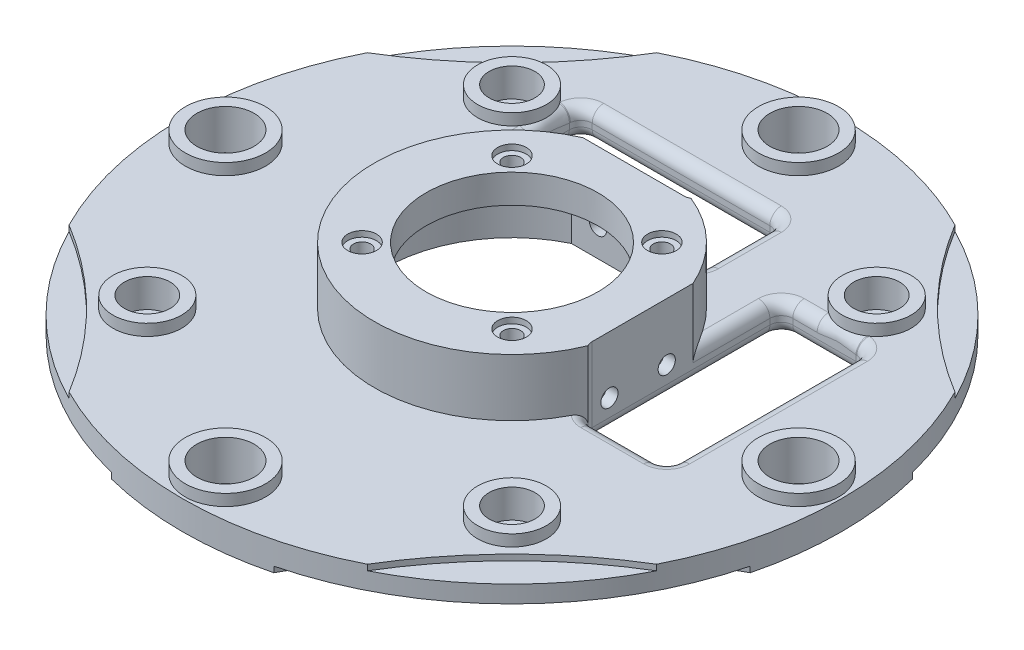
ISO-10303-21;
HEADER;
FILE_DESCRIPTION(('STEP AP214'),'2;1');
FILE_NAME('part.step','',(''),(''),'','','');
FILE_SCHEMA(('AUTOMOTIVE_DESIGN { 1 0 10303 214 1 1 1 1 }'));
ENDSEC;
DATA;
#1=APPLICATION_CONTEXT('core data for automotive mechanical design processes');
#2=APPLICATION_PROTOCOL_DEFINITION('international standard','automotive_design',2000,#1);
#3=PRODUCT_CONTEXT('',#1,'mechanical');
#4=PRODUCT('Part','Part','',(#3));
#5=PRODUCT_RELATED_PRODUCT_CATEGORY('part','',(#4));
#6=PRODUCT_DEFINITION_FORMATION('','',#4);
#7=PRODUCT_DEFINITION_CONTEXT('part definition',#1,'design');
#8=PRODUCT_DEFINITION('design','',#6,#7);
#9=PRODUCT_DEFINITION_SHAPE('','',#8);
#10=(LENGTH_UNIT() NAMED_UNIT(*) SI_UNIT(.MILLI.,.METRE.));
#11=(NAMED_UNIT(*) PLANE_ANGLE_UNIT() SI_UNIT($,.RADIAN.));
#12=(NAMED_UNIT(*) SI_UNIT($,.STERADIAN.) SOLID_ANGLE_UNIT());
#13=UNCERTAINTY_MEASURE_WITH_UNIT(LENGTH_MEASURE(1.E-05),#10,'distance_accuracy_value','');
#14=(GEOMETRIC_REPRESENTATION_CONTEXT(3) GLOBAL_UNCERTAINTY_ASSIGNED_CONTEXT((#13)) GLOBAL_UNIT_ASSIGNED_CONTEXT((#10,
#11,#12)) REPRESENTATION_CONTEXT('',''));
#15=CARTESIAN_POINT('',(0.,0.,0.));
#16=DIRECTION('',(0.,0.,1.));
#17=DIRECTION('',(1.,0.,0.));
#18=AXIS2_PLACEMENT_3D('',#15,#16,#17);
#19=CARTESIAN_POINT('',(13.0814754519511,5.,-13.0814754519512));
#20=DIRECTION('',(0.,1.,0.));
#21=DIRECTION('',(0.,0.,1.));
#22=AXIS2_PLACEMENT_3D('',#19,#20,#21);
#23=CYLINDRICAL_SURFACE('',#22,1.5);
#24=CARTESIAN_POINT('',(13.0814754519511,10.,-13.0814754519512));
#25=DIRECTION('',(0.,-1.,0.));
#26=DIRECTION('',(0.,0.,-1.));
#27=AXIS2_PLACEMENT_3D('',#24,#25,#26);
#28=CIRCLE('',#27,1.5);
#29=CARTESIAN_POINT('',(13.0814754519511,10.,-14.5814754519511));
#30=VERTEX_POINT('',#29);
#31=EDGE_CURVE('E735',#30,#30,#28,.T.);
#32=ORIENTED_EDGE('',*,*,#31,.T.);
#33=EDGE_LOOP('',(#32));
#34=FACE_BOUND('',#33,.T.);
#35=CARTESIAN_POINT('',(13.0814754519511,14.,-13.0814754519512));
#36=DIRECTION('',(0.,1.,0.));
#37=DIRECTION('',(0.,0.,1.));
#38=AXIS2_PLACEMENT_3D('',#35,#36,#37);
#39=CIRCLE('',#38,1.5);
#40=CARTESIAN_POINT('',(13.0814754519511,14.,-11.5814754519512));
#41=VERTEX_POINT('',#40);
#42=EDGE_CURVE('E583',#41,#41,#39,.F.);
#43=ORIENTED_EDGE('',*,*,#42,.F.);
#44=EDGE_LOOP('',(#43));
#45=FACE_BOUND('',#44,.T.);
#46=ADVANCED_FACE('F49',(#34,#45),#23,.F.);
#47=CARTESIAN_POINT('',(13.0814754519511,5.,13.0814754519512));
#48=DIRECTION('',(0.,1.,0.));
#49=DIRECTION('',(0.,0.,1.));
#50=AXIS2_PLACEMENT_3D('',#47,#48,#49);
#51=CYLINDRICAL_SURFACE('',#50,1.5);
#52=CARTESIAN_POINT('',(13.0814754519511,10.,13.0814754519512));
#53=DIRECTION('',(0.,-1.,0.));
#54=DIRECTION('',(0.,0.,-1.));
#55=AXIS2_PLACEMENT_3D('',#52,#53,#54);
#56=CIRCLE('',#55,1.5);
#57=CARTESIAN_POINT('',(13.0814754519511,10.,11.5814754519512));
#58=VERTEX_POINT('',#57);
#59=EDGE_CURVE('E1761',#58,#58,#56,.T.);
#60=ORIENTED_EDGE('',*,*,#59,.T.);
#61=EDGE_LOOP('',(#60));
#62=FACE_BOUND('',#61,.T.);
#63=CARTESIAN_POINT('',(13.0814754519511,14.,13.0814754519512));
#64=DIRECTION('',(0.,1.,0.));
#65=DIRECTION('',(0.,0.,1.));
#66=AXIS2_PLACEMENT_3D('',#63,#64,#65);
#67=CIRCLE('',#66,1.5);
#68=CARTESIAN_POINT('',(13.0814754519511,14.,14.5814754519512));
#69=VERTEX_POINT('',#68);
#70=EDGE_CURVE('E1577',#69,#69,#67,.F.);
#71=ORIENTED_EDGE('',*,*,#70,.F.);
#72=EDGE_LOOP('',(#71));
#73=FACE_BOUND('',#72,.T.);
#74=ADVANCED_FACE('F840',(#62,#73),#51,.F.);
#75=CARTESIAN_POINT('',(-13.0814754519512,5.,13.0814754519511));
#76=DIRECTION('',(0.,1.,0.));
#77=DIRECTION('',(0.,0.,1.));
#78=AXIS2_PLACEMENT_3D('',#75,#76,#77);
#79=CYLINDRICAL_SURFACE('',#78,1.5);
#80=CARTESIAN_POINT('',(-13.0814754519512,10.,13.0814754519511));
#81=DIRECTION('',(0.,-1.,0.));
#82=DIRECTION('',(0.,0.,-1.));
#83=AXIS2_PLACEMENT_3D('',#80,#81,#82);
#84=CIRCLE('',#83,1.5);
#85=CARTESIAN_POINT('',(-13.0814754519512,10.,11.5814754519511));
#86=VERTEX_POINT('',#85);
#87=EDGE_CURVE('E1571',#86,#86,#84,.T.);
#88=ORIENTED_EDGE('',*,*,#87,.T.);
#89=EDGE_LOOP('',(#88));
#90=FACE_BOUND('',#89,.T.);
#91=CARTESIAN_POINT('',(-13.0814754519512,14.,13.0814754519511));
#92=DIRECTION('',(0.,1.,0.));
#93=DIRECTION('',(0.,0.,1.));
#94=AXIS2_PLACEMENT_3D('',#91,#92,#93);
#95=CIRCLE('',#94,1.5);
#96=CARTESIAN_POINT('',(-13.0814754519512,14.,14.5814754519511));
#97=VERTEX_POINT('',#96);
#98=EDGE_CURVE('E1574',#97,#97,#95,.F.);
#99=ORIENTED_EDGE('',*,*,#98,.F.);
#100=EDGE_LOOP('',(#99));
#101=FACE_BOUND('',#100,.T.);
#102=ADVANCED_FACE('F847',(#90,#101),#79,.F.);
#103=CARTESIAN_POINT('',(-13.081475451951,5.,-13.0814754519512));
#104=DIRECTION('',(0.,1.,0.));
#105=DIRECTION('',(0.,0.,1.));
#106=AXIS2_PLACEMENT_3D('',#103,#104,#105);
#107=CYLINDRICAL_SURFACE('',#106,1.5);
#108=CARTESIAN_POINT('',(-13.081475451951,10.,-13.0814754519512));
#109=DIRECTION('',(0.,-1.,0.));
#110=DIRECTION('',(0.,0.,-1.));
#111=AXIS2_PLACEMENT_3D('',#108,#109,#110);
#112=CIRCLE('',#111,1.5);
#113=CARTESIAN_POINT('',(-13.081475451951,10.,-14.5814754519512));
#114=VERTEX_POINT('',#113);
#115=EDGE_CURVE('E1766',#114,#114,#112,.T.);
#116=ORIENTED_EDGE('',*,*,#115,.T.);
#117=EDGE_LOOP('',(#116));
#118=FACE_BOUND('',#117,.T.);
#119=CARTESIAN_POINT('',(-13.081475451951,14.,-13.0814754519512));
#120=DIRECTION('',(0.,1.,0.));
#121=DIRECTION('',(0.,0.,1.));
#122=AXIS2_PLACEMENT_3D('',#119,#120,#121);
#123=CIRCLE('',#122,1.5);
#124=CARTESIAN_POINT('',(-13.081475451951,14.,-11.5814754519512));
#125=VERTEX_POINT('',#124);
#126=EDGE_CURVE('E570',#125,#125,#123,.F.);
#127=ORIENTED_EDGE('',*,*,#126,.F.);
#128=EDGE_LOOP('',(#127));
#129=FACE_BOUND('',#128,.T.);
#130=ADVANCED_FACE('F854',(#118,#129),#107,.F.);
#131=CARTESIAN_POINT('',(0.,5.,0.));
#132=DIRECTION('',(0.,1.,0.));
#133=DIRECTION('',(0.,0.,1.));
#134=AXIS2_PLACEMENT_3D('',#131,#132,#133);
#135=PLANE('',#134);
#136=CARTESIAN_POINT('',(-90.1561146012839,5.,-90.1561146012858));
#137=DIRECTION('',(0.,1.,0.));
#138=DIRECTION('',(0.,0.,1.));
#139=AXIS2_PLACEMENT_3D('',#136,#137,#138);
#140=CIRCLE('',#139,75.0000000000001);
#141=CARTESIAN_POINT('',(-51.2751412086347,5.,-26.021335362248));
#142=VERTEX_POINT('',#141);
#143=CARTESIAN_POINT('',(-26.0213353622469,5.,-51.2751412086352));
#144=VERTEX_POINT('',#143);
#145=EDGE_CURVE('E536',#142,#144,#140,.T.);
#146=ORIENTED_EDGE('',*,*,#145,.F.);
#147=CARTESIAN_POINT('',(0.,5.,0.));
#148=DIRECTION('',(0.,1.,0.));
#149=DIRECTION('',(0.,0.,1.));
#150=AXIS2_PLACEMENT_3D('',#147,#148,#149);
#151=CIRCLE('',#150,57.5);
#152=CARTESIAN_POINT('',(-51.2751412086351,5.,26.021335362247));
#153=VERTEX_POINT('',#152);
#154=EDGE_CURVE('E483',#142,#153,#151,.T.);
#155=ORIENTED_EDGE('',*,*,#154,.T.);
#156=CARTESIAN_POINT('',(-90.1561146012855,5.,90.1561146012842));
#157=DIRECTION('',(0.,1.,0.));
#158=DIRECTION('',(0.,0.,1.));
#159=AXIS2_PLACEMENT_3D('',#156,#157,#158);
#160=CIRCLE('',#159,75.0000000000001);
#161=CARTESIAN_POINT('',(-26.0213353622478,5.,51.2751412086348));
#162=VERTEX_POINT('',#161);
#163=EDGE_CURVE('E533',#162,#153,#160,.T.);
#164=ORIENTED_EDGE('',*,*,#163,.F.);
#165=CARTESIAN_POINT('',(26.0213353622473,5.,51.275141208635));
#166=VERTEX_POINT('',#165);
#167=EDGE_CURVE('E478',#162,#166,#151,.T.);
#168=ORIENTED_EDGE('',*,*,#167,.T.);
#169=CARTESIAN_POINT('',(90.1561146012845,5.,90.1561146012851));
#170=DIRECTION('',(0.,1.,0.));
#171=DIRECTION('',(0.,0.,1.));
#172=AXIS2_PLACEMENT_3D('',#169,#170,#171);
#173=CIRCLE('',#172,75.0000000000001);
#174=CARTESIAN_POINT('',(51.2751412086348,5.,26.0213353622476));
#175=VERTEX_POINT('',#174);
#176=EDGE_CURVE('E530',#175,#166,#173,.T.);
#177=ORIENTED_EDGE('',*,*,#176,.F.);
#178=CARTESIAN_POINT('',(51.2751412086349,5.,-26.0213353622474));
#179=VERTEX_POINT('',#178);
#180=EDGE_CURVE('E484',#175,#179,#151,.T.);
#181=ORIENTED_EDGE('',*,*,#180,.T.);
#182=CARTESIAN_POINT('',(90.1561146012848,5.,-90.1561146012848));
#183=DIRECTION('',(0.,1.,0.));
#184=DIRECTION('',(0.,0.,1.));
#185=AXIS2_PLACEMENT_3D('',#182,#183,#184);
#186=CIRCLE('',#185,75.0000000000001);
#187=CARTESIAN_POINT('',(26.0213353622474,5.,-51.2751412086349));
#188=VERTEX_POINT('',#187);
#189=EDGE_CURVE('E527',#188,#179,#186,.T.);
#190=ORIENTED_EDGE('',*,*,#189,.F.);
#191=EDGE_CURVE('E1398',#188,#144,#151,.T.);
#192=ORIENTED_EDGE('',*,*,#191,.T.);
#193=EDGE_LOOP('',(#146,#155,#164,#168,#177,#181,#190,#192));
#194=FACE_BOUND('',#193,.T.);
#195=CARTESIAN_POINT('',(-3.49148133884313E-13,5.,50.));
#196=DIRECTION('',(0.,1.,0.));
#197=DIRECTION('',(0.,0.,1.));
#198=AXIS2_PLACEMENT_3D('',#195,#196,#197);
#199=CIRCLE('',#198,7.);
#200=CARTESIAN_POINT('',(-3.49148133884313E-13,5.,57.));
#201=VERTEX_POINT('',#200);
#202=EDGE_CURVE('E588',#201,#201,#199,.T.);
#203=ORIENTED_EDGE('',*,*,#202,.F.);
#204=EDGE_LOOP('',(#203));
#205=FACE_BOUND('',#204,.T.);
#206=CARTESIAN_POINT('',(0.,5.,-50.));
#207=DIRECTION('',(0.,1.,0.));
#208=DIRECTION('',(0.,0.,1.));
#209=AXIS2_PLACEMENT_3D('',#206,#207,#208);
#210=CIRCLE('',#209,7.);
#211=CARTESIAN_POINT('',(0.,5.,-43.));
#212=VERTEX_POINT('',#211);
#213=EDGE_CURVE('E615',#212,#212,#210,.T.);
#214=ORIENTED_EDGE('',*,*,#213,.F.);
#215=EDGE_LOOP('',(#214));
#216=FACE_BOUND('',#215,.T.);
#217=CARTESIAN_POINT('',(-31.8198051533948,5.,31.8198051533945));
#218=DIRECTION('',(0.,1.,0.));
#219=DIRECTION('',(0.,0.,1.));
#220=AXIS2_PLACEMENT_3D('',#217,#218,#219);
#221=CIRCLE('',#220,6.);
#222=CARTESIAN_POINT('',(-31.8198051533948,5.,37.8198051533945));
#223=VERTEX_POINT('',#222);
#224=EDGE_CURVE('E656',#223,#223,#221,.T.);
#225=ORIENTED_EDGE('',*,*,#224,.F.);
#226=EDGE_LOOP('',(#225));
#227=FACE_BOUND('',#226,.T.);
#228=CARTESIAN_POINT('',(31.8198051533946,5.,31.8198051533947));
#229=DIRECTION('',(0.,1.,0.));
#230=DIRECTION('',(0.,0.,1.));
#231=AXIS2_PLACEMENT_3D('',#228,#229,#230);
#232=CIRCLE('',#231,6.);
#233=CARTESIAN_POINT('',(31.8198051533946,5.,37.8198051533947));
#234=VERTEX_POINT('',#233);
#235=EDGE_CURVE('E664',#234,#234,#232,.T.);
#236=ORIENTED_EDGE('',*,*,#235,.F.);
#237=EDGE_LOOP('',(#236));
#238=FACE_BOUND('',#237,.T.);
#239=CARTESIAN_POINT('',(0.,5.,0.));
#240=DIRECTION('',(0.,1.,0.));
#241=DIRECTION('',(0.,0.,1.));
#242=AXIS2_PLACEMENT_3D('',#239,#240,#241);
#243=CIRCLE('',#242,24.);
#244=CARTESIAN_POINT('',(-13.2664991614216,5.,-20.));
#245=VERTEX_POINT('',#244);
#246=CARTESIAN_POINT('',(21.3381049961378,5.,10.9856850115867));
#247=VERTEX_POINT('',#246);
#248=EDGE_CURVE('E780',#245,#247,#243,.T.);
#249=ORIENTED_EDGE('',*,*,#248,.F.);
#250=DIRECTION('',(1.,0.,0.));
#251=VECTOR('',#250,1.);
#252=CARTESIAN_POINT('',(-23.,5.,-20.));
#253=LINE('',#252,#251);
#254=CARTESIAN_POINT('',(-23.,5.,-20.));
#255=VERTEX_POINT('',#254);
#256=EDGE_CURVE('E1122',#245,#255,#253,.F.);
#257=ORIENTED_EDGE('',*,*,#256,.T.);
#258=CARTESIAN_POINT('',(-23.,5.,-24.));
#259=DIRECTION('',(0.,1.,0.));
#260=DIRECTION('',(0.,0.,1.));
#261=AXIS2_PLACEMENT_3D('',#258,#259,#260);
#262=CIRCLE('',#261,4.);
#263=CARTESIAN_POINT('',(-27.,5.,-24.));
#264=VERTEX_POINT('',#263);
#265=EDGE_CURVE('E1125',#255,#264,#262,.F.);
#266=ORIENTED_EDGE('',*,*,#265,.T.);
#267=DIRECTION('',(0.,0.,1.));
#268=VECTOR('',#267,1.);
#269=CARTESIAN_POINT('',(-27.,5.,-35.));
#270=LINE('',#269,#268);
#271=CARTESIAN_POINT('',(-27.,5.,-28.2463644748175));
#272=VERTEX_POINT('',#271);
#273=EDGE_CURVE('E1128',#264,#272,#270,.F.);
#274=ORIENTED_EDGE('',*,*,#273,.T.);
#275=CARTESIAN_POINT('',(-31.8198051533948,5.,-31.8198051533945));
#276=DIRECTION('',(0.,1.,0.));
#277=DIRECTION('',(0.,0.,1.));
#278=AXIS2_PLACEMENT_3D('',#275,#276,#277);
#279=CIRCLE('',#278,6.);
#280=CARTESIAN_POINT('',(-26.9828508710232,5.,-35.3699985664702));
#281=VERTEX_POINT('',#280);
#282=EDGE_CURVE('E676',#281,#272,#279,.T.);
#283=ORIENTED_EDGE('',*,*,#282,.F.);
#284=CARTESIAN_POINT('',(-23.,5.,-35.));
#285=DIRECTION('',(0.,1.,0.));
#286=DIRECTION('',(0.,0.,1.));
#287=AXIS2_PLACEMENT_3D('',#284,#285,#286);
#288=CIRCLE('',#287,4.);
#289=CARTESIAN_POINT('',(-23.,5.,-39.));
#290=VERTEX_POINT('',#289);
#291=EDGE_CURVE('E1143',#281,#290,#288,.F.);
#292=ORIENTED_EDGE('',*,*,#291,.T.);
#293=DIRECTION('',(-1.,0.,0.));
#294=VECTOR('',#293,1.);
#295=CARTESIAN_POINT('',(8.,5.,-39.));
#296=LINE('',#295,#294);
#297=CARTESIAN_POINT('',(8.,5.,-39.));
#298=VERTEX_POINT('',#297);
#299=EDGE_CURVE('E1146',#290,#298,#296,.F.);
#300=ORIENTED_EDGE('',*,*,#299,.T.);
#301=CARTESIAN_POINT('',(8.,5.,-35.));
#302=DIRECTION('',(0.,1.,0.));
#303=DIRECTION('',(0.,0.,1.));
#304=AXIS2_PLACEMENT_3D('',#301,#302,#303);
#305=CIRCLE('',#304,4.);
#306=CARTESIAN_POINT('',(12.,5.,-35.));
#307=VERTEX_POINT('',#306);
#308=EDGE_CURVE('E1149',#298,#307,#305,.F.);
#309=ORIENTED_EDGE('',*,*,#308,.T.);
#310=DIRECTION('',(0.,0.,-1.));
#311=VECTOR('',#310,1.);
#312=CARTESIAN_POINT('',(12.,5.,-24.));
#313=LINE('',#312,#311);
#314=CARTESIAN_POINT('',(12.,5.,-24.));
#315=VERTEX_POINT('',#314);
#316=EDGE_CURVE('E1152',#307,#315,#313,.F.);
#317=ORIENTED_EDGE('',*,*,#316,.T.);
#318=CARTESIAN_POINT('',(8.,5.,-24.));
#319=DIRECTION('',(0.,1.,0.));
#320=DIRECTION('',(0.,0.,1.));
#321=AXIS2_PLACEMENT_3D('',#318,#319,#320);
#322=CIRCLE('',#321,4.);
#323=CARTESIAN_POINT('',(10.9856850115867,5.,-21.3381049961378));
#324=VERTEX_POINT('',#323);
#325=EDGE_CURVE('E1139',#315,#324,#322,.F.);
#326=ORIENTED_EDGE('',*,*,#325,.T.);
#327=CARTESIAN_POINT('',(20.,5.,-13.2664991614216));
#328=VERTEX_POINT('',#327);
#329=EDGE_CURVE('E796',#328,#324,#243,.T.);
#330=ORIENTED_EDGE('',*,*,#329,.F.);
#331=DIRECTION('',(0.,0.,1.));
#332=VECTOR('',#331,1.);
#333=CARTESIAN_POINT('',(20.,5.,0.));
#334=LINE('',#333,#332);
#335=CARTESIAN_POINT('',(20.,5.,-23.));
#336=VERTEX_POINT('',#335);
#337=EDGE_CURVE('E1131',#328,#336,#334,.F.);
#338=ORIENTED_EDGE('',*,*,#337,.T.);
#339=CARTESIAN_POINT('',(24.,5.,-23.));
#340=DIRECTION('',(0.,1.,0.));
#341=DIRECTION('',(0.,0.,1.));
#342=AXIS2_PLACEMENT_3D('',#339,#340,#341);
#343=CIRCLE('',#342,4.);
#344=CARTESIAN_POINT('',(24.,5.,-27.));
#345=VERTEX_POINT('',#344);
#346=EDGE_CURVE('E1026',#336,#345,#343,.F.);
#347=ORIENTED_EDGE('',*,*,#346,.T.);
#348=DIRECTION('',(-1.,0.,0.));
#349=VECTOR('',#348,1.);
#350=CARTESIAN_POINT('',(35.,5.,-27.));
#351=LINE('',#350,#349);
#352=CARTESIAN_POINT('',(28.2463644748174,5.,-27.));
#353=VERTEX_POINT('',#352);
#354=EDGE_CURVE('E1136',#345,#353,#351,.F.);
#355=ORIENTED_EDGE('',*,*,#354,.T.);
#356=CARTESIAN_POINT('',(31.8198051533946,5.,-31.8198051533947));
#357=DIRECTION('',(0.,1.,0.));
#358=DIRECTION('',(0.,0.,1.));
#359=AXIS2_PLACEMENT_3D('',#356,#357,#358);
#360=CIRCLE('',#359,6.);
#361=CARTESIAN_POINT('',(35.3699985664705,5.,-26.9828508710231));
#362=VERTEX_POINT('',#361);
#363=EDGE_CURVE('E677',#362,#353,#360,.T.);
#364=ORIENTED_EDGE('',*,*,#363,.F.);
#365=CARTESIAN_POINT('',(35.,5.,-23.));
#366=DIRECTION('',(0.,1.,0.));
#367=DIRECTION('',(0.,0.,1.));
#368=AXIS2_PLACEMENT_3D('',#365,#366,#367);
#369=CIRCLE('',#368,4.);
#370=CARTESIAN_POINT('',(39.,5.,-23.));
#371=VERTEX_POINT('',#370);
#372=EDGE_CURVE('E1165',#362,#371,#369,.F.);
#373=ORIENTED_EDGE('',*,*,#372,.T.);
#374=DIRECTION('',(0.,0.,-1.));
#375=VECTOR('',#374,1.);
#376=CARTESIAN_POINT('',(39.,5.,8.));
#377=LINE('',#376,#375);
#378=CARTESIAN_POINT('',(39.,5.,8.));
#379=VERTEX_POINT('',#378);
#380=EDGE_CURVE('E1168',#371,#379,#377,.F.);
#381=ORIENTED_EDGE('',*,*,#380,.T.);
#382=CARTESIAN_POINT('',(35.,5.,8.));
#383=DIRECTION('',(0.,1.,0.));
#384=DIRECTION('',(0.,0.,1.));
#385=AXIS2_PLACEMENT_3D('',#382,#383,#384);
#386=CIRCLE('',#385,4.);
#387=CARTESIAN_POINT('',(35.,5.,12.));
#388=VERTEX_POINT('',#387);
#389=EDGE_CURVE('E1162',#379,#388,#386,.F.);
#390=ORIENTED_EDGE('',*,*,#389,.T.);
#391=DIRECTION('',(1.,0.,0.));
#392=VECTOR('',#391,1.);
#393=CARTESIAN_POINT('',(24.,5.,12.));
#394=LINE('',#393,#392);
#395=CARTESIAN_POINT('',(24.,5.,12.));
#396=VERTEX_POINT('',#395);
#397=EDGE_CURVE('E1159',#388,#396,#394,.F.);
#398=ORIENTED_EDGE('',*,*,#397,.T.);
#399=CARTESIAN_POINT('',(24.,5.,8.));
#400=DIRECTION('',(0.,1.,0.));
#401=DIRECTION('',(0.,0.,1.));
#402=AXIS2_PLACEMENT_3D('',#399,#400,#401);
#403=CIRCLE('',#402,4.);
#404=EDGE_CURVE('E1155',#396,#247,#403,.F.);
#405=ORIENTED_EDGE('',*,*,#404,.T.);
#406=EDGE_LOOP('',(#249,#257,#266,#274,#283,#292,#300,#309,#317,#326,#330,#338,#347,#355,#364,
#373,#381,#390,#398,#405));
#407=FACE_BOUND('',#406,.T.);
#408=CARTESIAN_POINT('',(50.,5.,1.74574066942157E-13));
#409=DIRECTION('',(0.,1.,0.));
#410=DIRECTION('',(0.,0.,1.));
#411=AXIS2_PLACEMENT_3D('',#408,#409,#410);
#412=CIRCLE('',#411,7.);
#413=CARTESIAN_POINT('',(50.,5.,7.00000000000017));
#414=VERTEX_POINT('',#413);
#415=EDGE_CURVE('E600',#414,#414,#412,.T.);
#416=ORIENTED_EDGE('',*,*,#415,.F.);
#417=EDGE_LOOP('',(#416));
#418=FACE_BOUND('',#417,.T.);
#419=CARTESIAN_POINT('',(-50.,5.,-5.2372220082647E-13));
#420=DIRECTION('',(0.,1.,0.));
#421=DIRECTION('',(0.,0.,1.));
#422=AXIS2_PLACEMENT_3D('',#419,#420,#421);
#423=CIRCLE('',#422,7.);
#424=CARTESIAN_POINT('',(-50.,5.,6.99999999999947));
#425=VERTEX_POINT('',#424);
#426=EDGE_CURVE('E574',#425,#425,#423,.T.);
#427=ORIENTED_EDGE('',*,*,#426,.F.);
#428=EDGE_LOOP('',(#427));
#429=FACE_BOUND('',#428,.T.);
#430=ADVANCED_FACE('F887',(#194,#205,#216,#227,#238,#407,#418,#429),#135,.T.);
#431=CARTESIAN_POINT('',(0.,15.,0.));
#432=DIRECTION('',(0.,-1.,0.));
#433=DIRECTION('',(0.,0.,-1.));
#434=AXIS2_PLACEMENT_3D('',#431,#432,#433);
#435=CYLINDRICAL_SURFACE('',#434,24.);
#436=CARTESIAN_POINT('',(0.,15.,0.));
#437=DIRECTION('',(0.,1.,0.));
#438=DIRECTION('',(0.,0.,1.));
#439=AXIS2_PLACEMENT_3D('',#436,#437,#438);
#440=CIRCLE('',#439,24.);
#441=CARTESIAN_POINT('',(-9.59166304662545,15.,-22.));
#442=VERTEX_POINT('',#441);
#443=CARTESIAN_POINT('',(22.2566251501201,15.,8.98012454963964));
#444=VERTEX_POINT('',#443);
#445=EDGE_CURVE('E792',#442,#444,#440,.T.);
#446=ORIENTED_EDGE('',*,*,#445,.F.);
#447=DIRECTION('',(0.,1.,0.));
#448=VECTOR('',#447,1.);
#449=CARTESIAN_POINT('',(-9.59166304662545,5.,-22.));
#450=LINE('',#449,#448);
#451=CARTESIAN_POINT('',(-9.59166304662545,3.,-22.));
#452=VERTEX_POINT('',#451);
#453=EDGE_CURVE('E731',#452,#442,#450,.T.);
#454=ORIENTED_EDGE('',*,*,#453,.F.);
#455=CARTESIAN_POINT('',(-9.59166304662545,3.,-22.));
#456=CARTESIAN_POINT('',(-9.59165428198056,3.02531366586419,-22.0000034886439));
#457=CARTESIAN_POINT('',(-9.59276617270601,3.05061198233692,-21.9995190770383));
#458=CARTESIAN_POINT('',(-9.59714701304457,3.10095128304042,-21.9976084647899));
#459=CARTESIAN_POINT('',(-9.60041299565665,3.12599257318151,-21.9961835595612));
#460=CARTESIAN_POINT('',(-9.61320304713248,3.19981682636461,-21.9905983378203));
#461=CARTESIAN_POINT('',(-9.62572426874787,3.24800227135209,-21.9851254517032));
#462=CARTESIAN_POINT('',(-9.66182934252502,3.35432712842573,-21.9692860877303));
#463=CARTESIAN_POINT('',(-9.68749887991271,3.41159746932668,-21.9579920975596));
#464=CARTESIAN_POINT('',(-9.74681722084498,3.52119033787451,-21.931726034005));
#465=CARTESIAN_POINT('',(-9.78051126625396,3.57348236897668,-21.9167330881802));
#466=CARTESIAN_POINT('',(-9.84820113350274,3.66599454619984,-21.8863910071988));
#467=CARTESIAN_POINT('',(-9.88147408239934,3.70687431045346,-21.8713950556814));
#468=CARTESIAN_POINT('',(-9.95103066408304,3.78535927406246,-21.8398364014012));
#469=CARTESIAN_POINT('',(-9.98731660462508,3.82296191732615,-21.8232724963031));
#470=CARTESIAN_POINT('',(-10.0995799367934,3.93148602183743,-21.7716612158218));
#471=CARTESIAN_POINT('',(-10.1788987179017,3.99804200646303,-21.7347228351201));
#472=CARTESIAN_POINT('',(-10.3471757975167,4.12536020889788,-21.6551411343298));
#473=CARTESIAN_POINT('',(-10.4364248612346,4.18559436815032,-21.6122947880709));
#474=CARTESIAN_POINT('',(-10.6185336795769,4.29782620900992,-21.5234064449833));
#475=CARTESIAN_POINT('',(-10.7113970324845,4.34981540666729,-21.4773612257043));
#476=CARTESIAN_POINT('',(-10.8997228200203,4.44692221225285,-21.3824042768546));
#477=CARTESIAN_POINT('',(-10.9951937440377,4.49201313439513,-21.3334823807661));
#478=CARTESIAN_POINT('',(-11.1875690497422,4.57588282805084,-21.2332303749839));
#479=CARTESIAN_POINT('',(-11.2844730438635,4.61466327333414,-21.1819009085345));
#480=CARTESIAN_POINT('',(-11.5391185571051,4.70853758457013,-21.0447288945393));
#481=CARTESIAN_POINT('',(-11.6976132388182,4.75899087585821,-20.9570799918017));
#482=CARTESIAN_POINT('',(-12.015484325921,4.8458409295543,-20.7764677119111));
#483=CARTESIAN_POINT('',(-12.1748611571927,4.88223016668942,-20.6835015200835));
#484=CARTESIAN_POINT('',(-12.4905119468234,4.94040723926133,-20.4943976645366));
#485=CARTESIAN_POINT('',(-12.6467907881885,4.96244267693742,-20.3983455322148));
#486=CARTESIAN_POINT('',(-12.880155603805,4.98478399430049,-20.2511741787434));
#487=CARTESIAN_POINT('',(-12.9577441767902,4.99044569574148,-20.2016175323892));
#488=CARTESIAN_POINT('',(-13.1124818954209,4.99805082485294,-20.101525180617));
#489=CARTESIAN_POINT('',(-13.189630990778,4.99999383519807,-20.050989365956));
#490=CARTESIAN_POINT('',(-13.2664991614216,5.,-20.));
#491=B_SPLINE_CURVE_WITH_KNOTS('',3,(#455,#456,#457,#458,#459,#460,#461,#462,#463,#464,#465,
#466,#467,#468,#469,#470,#471,#472,#473,#474,#475,#476,#477,#478,#479,#480,#481,#482,#483,#484,
#485,#486,#487,#488,#489,#490),.UNSPECIFIED.,.F.,.F.,(4,2,2,2,2,2,2,2,2,2,2,2,2,2,2,2,2,4),(0.,
0.0758841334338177,0.151663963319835,0.301149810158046,0.491402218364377,0.682753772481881,
0.846921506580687,1.01121616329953,1.34012518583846,1.68732595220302,2.03488169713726,
2.38374968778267,2.73252499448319,3.29585926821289,3.85949455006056,4.41312986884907,
4.68977437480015,4.96644992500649),.UNSPECIFIED.);
#492=EDGE_CURVE('E903',#452,#245,#491,.T.);
#493=ORIENTED_EDGE('',*,*,#492,.T.);
#494=ORIENTED_EDGE('',*,*,#248,.T.);
#495=CARTESIAN_POINT('',(21.3381049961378,5.,10.9856850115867));
#496=CARTESIAN_POINT('',(21.366809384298,5.00000731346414,10.9299362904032));
#497=CARTESIAN_POINT('',(21.3952856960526,4.99723570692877,10.8740830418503));
#498=CARTESIAN_POINT('',(21.4515790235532,4.986278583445,10.7626030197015));
#499=CARTESIAN_POINT('',(21.4793963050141,4.97809528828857,10.7069761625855));
#500=CARTESIAN_POINT('',(21.5340928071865,4.956497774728,10.5965389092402));
#501=CARTESIAN_POINT('',(21.5609750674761,4.94310265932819,10.5417262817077));
#502=CARTESIAN_POINT('',(21.6137441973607,4.91127689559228,10.4331066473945));
#503=CARTESIAN_POINT('',(21.6396309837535,4.8928458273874,10.3792997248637));
#504=CARTESIAN_POINT('',(21.7155197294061,4.83035504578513,10.2200763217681));
#505=CARTESIAN_POINT('',(21.763867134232,4.77905035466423,10.1166202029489));
#506=CARTESIAN_POINT('',(21.8552311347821,4.65898099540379,9.91770699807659));
#507=CARTESIAN_POINT('',(21.8982404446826,4.59019284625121,9.82226090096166));
#508=CARTESIAN_POINT('',(21.9803719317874,4.43303201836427,9.63711735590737));
#509=CARTESIAN_POINT('',(22.0191700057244,4.34381856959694,9.54798757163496));
#510=CARTESIAN_POINT('',(22.0893484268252,4.15015152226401,9.38448721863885));
#511=CARTESIAN_POINT('',(22.1207315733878,4.04570369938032,9.3101110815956));
#512=CARTESIAN_POINT('',(22.1688673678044,3.84842337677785,9.19479817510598));
#513=CARTESIAN_POINT('',(22.1873220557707,3.75819982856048,9.15010304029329));
#514=CARTESIAN_POINT('',(22.2181972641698,3.57124012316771,9.07487580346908));
#515=CARTESIAN_POINT('',(22.2306383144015,3.47452742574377,9.0442955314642));
#516=CARTESIAN_POINT('',(22.2452104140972,3.31430242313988,9.00837613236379));
#517=CARTESIAN_POINT('',(22.249462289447,3.25211655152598,8.99786230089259));
#518=CARTESIAN_POINT('',(22.2551820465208,3.12664466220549,8.98370137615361));
#519=CARTESIAN_POINT('',(22.2566409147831,3.06335574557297,8.98007651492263));
#520=CARTESIAN_POINT('',(22.2566251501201,3.,8.98012454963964));
#521=B_SPLINE_CURVE_WITH_KNOTS('',3,(#495,#496,#497,#498,#499,#500,#501,#502,#503,#504,#505,
#506,#507,#508,#509,#510,#511,#512,#513,#514,#515,#516,#517,#518,#519,#520),.UNSPECIFIED.,.F.,
.F.,(4,2,2,2,2,2,2,2,2,2,2,2,4),(0.,0.188034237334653,0.375991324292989,0.56326588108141,
0.750556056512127,1.12434057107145,1.49862977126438,1.89263521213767,2.28649166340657,
2.59246090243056,2.89737809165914,3.08659896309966,3.27642945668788),.UNSPECIFIED.);
#522=CARTESIAN_POINT('',(22.2566251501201,3.,8.98012454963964));
#523=VERTEX_POINT('',#522);
#524=EDGE_CURVE('E910',#247,#523,#521,.T.);
#525=ORIENTED_EDGE('',*,*,#524,.T.);
#526=DIRECTION('',(0.,1.,0.));
#527=VECTOR('',#526,1.);
#528=CARTESIAN_POINT('',(22.2566251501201,5.,8.98012454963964));
#529=LINE('',#528,#527);
#530=EDGE_CURVE('E1320',#523,#444,#529,.T.);
#531=ORIENTED_EDGE('',*,*,#530,.T.);
#532=EDGE_LOOP('',(#446,#454,#493,#494,#525,#531));
#533=FACE_BOUND('',#532,.T.);
#534=ADVANCED_FACE('F883',(#533),#435,.T.);
#535=DIRECTION('',(0.,1.,0.));
#536=VECTOR('',#535,1.);
#537=CARTESIAN_POINT('',(22.,5.,-9.59166304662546));
#538=LINE('',#537,#536);
#539=CARTESIAN_POINT('',(22.,3.,-9.59166304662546));
#540=VERTEX_POINT('',#539);
#541=CARTESIAN_POINT('',(22.,15.,-9.59166304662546));
#542=VERTEX_POINT('',#541);
#543=EDGE_CURVE('E732',#540,#542,#538,.T.);
#544=ORIENTED_EDGE('',*,*,#543,.F.);
#545=CARTESIAN_POINT('',(22.,3.,-9.59166304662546));
#546=CARTESIAN_POINT('',(22.0000034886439,3.02531366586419,-9.59165428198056));
#547=CARTESIAN_POINT('',(21.9995190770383,3.05061198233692,-9.59276617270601));
#548=CARTESIAN_POINT('',(21.9976084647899,3.10095128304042,-9.59714701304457));
#549=CARTESIAN_POINT('',(21.9961835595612,3.1259925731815,-9.60041299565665));
#550=CARTESIAN_POINT('',(21.9905983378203,3.19981682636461,-9.61320304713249));
#551=CARTESIAN_POINT('',(21.9851254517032,3.24800227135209,-9.62572426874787));
#552=CARTESIAN_POINT('',(21.9692860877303,3.35432712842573,-9.66182934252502));
#553=CARTESIAN_POINT('',(21.9579920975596,3.41159746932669,-9.68749887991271));
#554=CARTESIAN_POINT('',(21.931726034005,3.52119033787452,-9.74681722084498));
#555=CARTESIAN_POINT('',(21.9167330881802,3.57348236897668,-9.78051126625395));
#556=CARTESIAN_POINT('',(21.8863910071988,3.66599454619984,-9.84820113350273));
#557=CARTESIAN_POINT('',(21.8713950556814,3.70687431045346,-9.88147408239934));
#558=CARTESIAN_POINT('',(21.8398364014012,3.78535927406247,-9.95103066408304));
#559=CARTESIAN_POINT('',(21.8232724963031,3.82296191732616,-9.98731660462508));
#560=CARTESIAN_POINT('',(21.7716612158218,3.93148602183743,-10.0995799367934));
#561=CARTESIAN_POINT('',(21.7347228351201,3.99804200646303,-10.1788987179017));
#562=CARTESIAN_POINT('',(21.6551411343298,4.12536020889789,-10.3471757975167));
#563=CARTESIAN_POINT('',(21.6122947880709,4.18559436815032,-10.4364248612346));
#564=CARTESIAN_POINT('',(21.5234064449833,4.29782620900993,-10.6185336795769));
#565=CARTESIAN_POINT('',(21.4773612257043,4.3498154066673,-10.7113970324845));
#566=CARTESIAN_POINT('',(21.3824042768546,4.44692221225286,-10.8997228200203));
#567=CARTESIAN_POINT('',(21.3334823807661,4.49201313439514,-10.9951937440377));
#568=CARTESIAN_POINT('',(21.2332303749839,4.57588282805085,-11.1875690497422));
#569=CARTESIAN_POINT('',(21.1819009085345,4.61466327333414,-11.2844730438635));
#570=CARTESIAN_POINT('',(21.0447288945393,4.70853758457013,-11.5391185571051));
#571=CARTESIAN_POINT('',(20.9570799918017,4.75899087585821,-11.6976132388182));
#572=CARTESIAN_POINT('',(20.7764677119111,4.8458409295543,-12.015484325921));
#573=CARTESIAN_POINT('',(20.6835015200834,4.88223016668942,-12.1748611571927));
#574=CARTESIAN_POINT('',(20.4943976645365,4.94040723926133,-12.4905119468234));
#575=CARTESIAN_POINT('',(20.3983455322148,4.96244267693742,-12.6467907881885));
#576=CARTESIAN_POINT('',(20.2511741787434,4.98478399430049,-12.880155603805));
#577=CARTESIAN_POINT('',(20.2016175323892,4.99044569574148,-12.9577441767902));
#578=CARTESIAN_POINT('',(20.101525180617,4.99805082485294,-13.1124818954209));
#579=CARTESIAN_POINT('',(20.050989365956,4.99999383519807,-13.189630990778));
#580=CARTESIAN_POINT('',(20.,5.,-13.2664991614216));
#581=B_SPLINE_CURVE_WITH_KNOTS('',3,(#545,#546,#547,#548,#549,#550,#551,#552,#553,#554,#555,
#556,#557,#558,#559,#560,#561,#562,#563,#564,#565,#566,#567,#568,#569,#570,#571,#572,#573,#574,
#575,#576,#577,#578,#579,#580),.UNSPECIFIED.,.F.,.F.,(4,2,2,2,2,2,2,2,2,2,2,2,2,2,2,2,2,4),(0.,
0.0758841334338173,0.151663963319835,0.301149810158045,0.491402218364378,0.682753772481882,
0.846921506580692,1.01121616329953,1.34012518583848,1.68732595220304,2.03488169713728,
2.38374968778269,2.73252499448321,3.2958592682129,3.85949455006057,4.41312986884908,
4.68977437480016,4.96644992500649),.UNSPECIFIED.);
#582=EDGE_CURVE('E918',#540,#328,#581,.T.);
#583=ORIENTED_EDGE('',*,*,#582,.T.);
#584=ORIENTED_EDGE('',*,*,#329,.T.);
#585=CARTESIAN_POINT('',(10.9856850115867,5.,-21.3381049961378));
#586=CARTESIAN_POINT('',(10.9299362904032,5.00000731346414,-21.366809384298));
#587=CARTESIAN_POINT('',(10.8740830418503,4.99723570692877,-21.3952856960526));
#588=CARTESIAN_POINT('',(10.7626030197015,4.986278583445,-21.4515790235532));
#589=CARTESIAN_POINT('',(10.7069761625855,4.97809528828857,-21.4793963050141));
#590=CARTESIAN_POINT('',(10.5965389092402,4.956497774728,-21.5340928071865));
#591=CARTESIAN_POINT('',(10.5417262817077,4.94310265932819,-21.5609750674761));
#592=CARTESIAN_POINT('',(10.4331066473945,4.91127689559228,-21.6137441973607));
#593=CARTESIAN_POINT('',(10.3792997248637,4.8928458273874,-21.6396309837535));
#594=CARTESIAN_POINT('',(10.2200763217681,4.83035504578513,-21.7155197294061));
#595=CARTESIAN_POINT('',(10.1166202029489,4.77905035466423,-21.763867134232));
#596=CARTESIAN_POINT('',(9.91770699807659,4.65898099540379,-21.8552311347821));
#597=CARTESIAN_POINT('',(9.82226090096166,4.59019284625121,-21.8982404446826));
#598=CARTESIAN_POINT('',(9.63711735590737,4.43303201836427,-21.9803719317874));
#599=CARTESIAN_POINT('',(9.54798757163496,4.34381856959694,-22.0191700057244));
#600=CARTESIAN_POINT('',(9.38448721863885,4.15015152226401,-22.0893484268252));
#601=CARTESIAN_POINT('',(9.3101110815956,4.04570369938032,-22.1207315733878));
#602=CARTESIAN_POINT('',(9.19479817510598,3.84842337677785,-22.1688673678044));
#603=CARTESIAN_POINT('',(9.15010304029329,3.75819982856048,-22.1873220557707));
#604=CARTESIAN_POINT('',(9.07487580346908,3.57124012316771,-22.2181972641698));
#605=CARTESIAN_POINT('',(9.0442955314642,3.47452742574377,-22.2306383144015));
#606=CARTESIAN_POINT('',(9.00837613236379,3.31430242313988,-22.2452104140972));
#607=CARTESIAN_POINT('',(8.99786230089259,3.25211655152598,-22.249462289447));
#608=CARTESIAN_POINT('',(8.98370137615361,3.12664466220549,-22.2551820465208));
#609=CARTESIAN_POINT('',(8.98007651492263,3.06335574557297,-22.2566409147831));
#610=CARTESIAN_POINT('',(8.98012454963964,3.,-22.2566251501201));
#611=B_SPLINE_CURVE_WITH_KNOTS('',3,(#585,#586,#587,#588,#589,#590,#591,#592,#593,#594,#595,
#596,#597,#598,#599,#600,#601,#602,#603,#604,#605,#606,#607,#608,#609,#610),.UNSPECIFIED.,.F.,
.F.,(4,2,2,2,2,2,2,2,2,2,2,2,4),(0.,0.188034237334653,0.375991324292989,0.56326588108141,
0.750556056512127,1.12434057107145,1.49862977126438,1.89263521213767,2.28649166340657,
2.59246090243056,2.89737809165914,3.08659896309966,3.27642945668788),.UNSPECIFIED.);
#612=CARTESIAN_POINT('',(8.98012454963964,3.,-22.2566251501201));
#613=VERTEX_POINT('',#612);
#614=EDGE_CURVE('E893',#324,#613,#611,.T.);
#615=ORIENTED_EDGE('',*,*,#614,.T.);
#616=DIRECTION('',(0.,-1.,0.));
#617=VECTOR('',#616,1.);
#618=CARTESIAN_POINT('',(8.98012454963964,5.,-22.2566251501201));
#619=LINE('',#618,#617);
#620=CARTESIAN_POINT('',(8.98012454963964,15.,-22.2566251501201));
#621=VERTEX_POINT('',#620);
#622=EDGE_CURVE('E1327',#613,#621,#619,.F.);
#623=ORIENTED_EDGE('',*,*,#622,.T.);
#624=EDGE_CURVE('E795',#542,#621,#440,.T.);
#625=ORIENTED_EDGE('',*,*,#624,.F.);
#626=EDGE_LOOP('',(#544,#583,#584,#615,#623,#625));
#627=FACE_BOUND('',#626,.T.);
#628=ADVANCED_FACE('F881',(#627),#435,.T.);
#629=CARTESIAN_POINT('',(0.,15.,0.));
#630=DIRECTION('',(0.,1.,0.));
#631=DIRECTION('',(0.,0.,1.));
#632=AXIS2_PLACEMENT_3D('',#629,#630,#631);
#633=PLANE('',#632);
#634=CARTESIAN_POINT('',(13.0814754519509,15.,13.0814754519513));
#635=DIRECTION('',(0.,1.,0.));
#636=DIRECTION('',(0.,0.,1.));
#637=AXIS2_PLACEMENT_3D('',#634,#635,#636);
#638=CIRCLE('',#637,2.5);
#639=CARTESIAN_POINT('',(13.0814754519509,15.,15.5814754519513));
#640=VERTEX_POINT('',#639);
#641=EDGE_CURVE('E557',#640,#640,#638,.T.);
#642=ORIENTED_EDGE('',*,*,#641,.F.);
#643=EDGE_LOOP('',(#642));
#644=FACE_BOUND('',#643,.T.);
#645=CARTESIAN_POINT('',(13.0814754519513,15.,-13.081475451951));
#646=DIRECTION('',(0.,1.,0.));
#647=DIRECTION('',(0.,0.,1.));
#648=AXIS2_PLACEMENT_3D('',#645,#646,#647);
#649=CIRCLE('',#648,2.5);
#650=CARTESIAN_POINT('',(13.0814754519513,15.,-10.581475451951));
#651=VERTEX_POINT('',#650);
#652=EDGE_CURVE('E549',#651,#651,#649,.T.);
#653=ORIENTED_EDGE('',*,*,#652,.F.);
#654=EDGE_LOOP('',(#653));
#655=FACE_BOUND('',#654,.T.);
#656=CARTESIAN_POINT('',(-13.081475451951,15.,-13.0814754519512));
#657=DIRECTION('',(0.,1.,0.));
#658=DIRECTION('',(0.,0.,1.));
#659=AXIS2_PLACEMENT_3D('',#656,#657,#658);
#660=CIRCLE('',#659,2.5);
#661=CARTESIAN_POINT('',(-13.081475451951,15.,-10.5814754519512));
#662=VERTEX_POINT('',#661);
#663=EDGE_CURVE('E540',#662,#662,#660,.T.);
#664=ORIENTED_EDGE('',*,*,#663,.F.);
#665=EDGE_LOOP('',(#664));
#666=FACE_BOUND('',#665,.T.);
#667=CARTESIAN_POINT('',(-13.0814754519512,15.,13.0814754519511));
#668=DIRECTION('',(0.,1.,0.));
#669=DIRECTION('',(0.,0.,1.));
#670=AXIS2_PLACEMENT_3D('',#667,#668,#669);
#671=CIRCLE('',#670,2.5);
#672=CARTESIAN_POINT('',(-13.0814754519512,15.,15.5814754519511));
#673=VERTEX_POINT('',#672);
#674=EDGE_CURVE('E544',#673,#673,#671,.T.);
#675=ORIENTED_EDGE('',*,*,#674,.F.);
#676=EDGE_LOOP('',(#675));
#677=FACE_BOUND('',#676,.T.);
#678=CARTESIAN_POINT('',(0.,15.,0.));
#679=DIRECTION('',(0.,1.,0.));
#680=DIRECTION('',(0.,0.,1.));
#681=AXIS2_PLACEMENT_3D('',#678,#679,#680);
#682=CIRCLE('',#681,15.);
#683=CARTESIAN_POINT('',(0.,15.,15.));
#684=VERTEX_POINT('',#683);
#685=EDGE_CURVE('E722',#684,#684,#682,.T.);
#686=ORIENTED_EDGE('',*,*,#685,.F.);
#687=EDGE_LOOP('',(#686));
#688=FACE_BOUND('',#687,.T.);
#689=DIRECTION('',(1.,0.,0.));
#690=VECTOR('',#689,1.);
#691=CARTESIAN_POINT('',(0.,15.,-22.));
#692=LINE('',#691,#690);
#693=CARTESIAN_POINT('',(8.,15.,-22.));
#694=VERTEX_POINT('',#693);
#695=EDGE_CURVE('E727',#442,#694,#692,.T.);
#696=ORIENTED_EDGE('',*,*,#695,.F.);
#697=ORIENTED_EDGE('',*,*,#445,.T.);
#698=CARTESIAN_POINT('',(24.,15.,8.));
#699=DIRECTION('',(0.,1.,0.));
#700=DIRECTION('',(0.,0.,1.));
#701=AXIS2_PLACEMENT_3D('',#698,#699,#700);
#702=CIRCLE('',#701,2.);
#703=CARTESIAN_POINT('',(22.,15.,8.));
#704=VERTEX_POINT('',#703);
#705=EDGE_CURVE('E1317',#444,#704,#702,.F.);
#706=ORIENTED_EDGE('',*,*,#705,.T.);
#707=DIRECTION('',(0.,0.,-1.));
#708=VECTOR('',#707,1.);
#709=CARTESIAN_POINT('',(22.,15.,0.));
#710=LINE('',#709,#708);
#711=EDGE_CURVE('E736',#704,#542,#710,.T.);
#712=ORIENTED_EDGE('',*,*,#711,.T.);
#713=ORIENTED_EDGE('',*,*,#624,.T.);
#714=CARTESIAN_POINT('',(8.,15.,-24.));
#715=DIRECTION('',(0.,1.,0.));
#716=DIRECTION('',(0.,0.,1.));
#717=AXIS2_PLACEMENT_3D('',#714,#715,#716);
#718=CIRCLE('',#717,2.);
#719=EDGE_CURVE('E1324',#621,#694,#718,.F.);
#720=ORIENTED_EDGE('',*,*,#719,.T.);
#721=EDGE_LOOP('',(#696,#697,#706,#712,#713,#720));
#722=FACE_BOUND('',#721,.T.);
#723=ADVANCED_FACE('F878',(#644,#655,#666,#677,#688,#722),#633,.T.);
#724=CARTESIAN_POINT('',(0.,0.,0.));
#725=DIRECTION('',(0.,1.,0.));
#726=DIRECTION('',(0.,0.,1.));
#727=AXIS2_PLACEMENT_3D('',#724,#725,#726);
#728=PLANE('',#727);
#729=DIRECTION('',(0.,0.,-1.));
#730=VECTOR('',#729,1.);
#731=CARTESIAN_POINT('',(20.,0.,0.));
#732=LINE('',#731,#730);
#733=CARTESIAN_POINT('',(20.,0.,9.63535157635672));
#734=VERTEX_POINT('',#733);
#735=CARTESIAN_POINT('',(20.,0.,8.));
#736=VERTEX_POINT('',#735);
#737=EDGE_CURVE('E759',#734,#736,#732,.T.);
#738=ORIENTED_EDGE('',*,*,#737,.T.);
#739=CARTESIAN_POINT('',(24.,0.,8.));
#740=DIRECTION('',(0.,1.,0.));
#741=DIRECTION('',(0.,0.,1.));
#742=AXIS2_PLACEMENT_3D('',#739,#740,#741);
#743=CIRCLE('',#742,4.);
#744=CARTESIAN_POINT('',(24.,0.,12.));
#745=VERTEX_POINT('',#744);
#746=EDGE_CURVE('E1267',#736,#745,#743,.T.);
#747=ORIENTED_EDGE('',*,*,#746,.T.);
#748=DIRECTION('',(1.,0.,0.));
#749=VECTOR('',#748,1.);
#750=CARTESIAN_POINT('',(0.,0.,12.));
#751=LINE('',#750,#749);
#752=CARTESIAN_POINT('',(35.,0.,12.));
#753=VERTEX_POINT('',#752);
#754=EDGE_CURVE('E1270',#745,#753,#751,.T.);
#755=ORIENTED_EDGE('',*,*,#754,.T.);
#756=CARTESIAN_POINT('',(35.,0.,8.));
#757=DIRECTION('',(0.,1.,0.));
#758=DIRECTION('',(0.,0.,1.));
#759=AXIS2_PLACEMENT_3D('',#756,#757,#758);
#760=CIRCLE('',#759,4.);
#761=CARTESIAN_POINT('',(39.,0.,8.));
#762=VERTEX_POINT('',#761);
#763=EDGE_CURVE('E1273',#753,#762,#760,.T.);
#764=ORIENTED_EDGE('',*,*,#763,.T.);
#765=DIRECTION('',(0.,0.,-1.));
#766=VECTOR('',#765,1.);
#767=CARTESIAN_POINT('',(39.,0.,0.));
#768=LINE('',#767,#766);
#769=CARTESIAN_POINT('',(39.,0.,-23.));
#770=VERTEX_POINT('',#769);
#771=EDGE_CURVE('E1276',#762,#770,#768,.T.);
#772=ORIENTED_EDGE('',*,*,#771,.T.);
#773=CARTESIAN_POINT('',(35.,0.,-23.));
#774=DIRECTION('',(0.,1.,0.));
#775=DIRECTION('',(0.,0.,1.));
#776=AXIS2_PLACEMENT_3D('',#773,#774,#775);
#777=CIRCLE('',#776,4.);
#778=CARTESIAN_POINT('',(35.,0.,-27.));
#779=VERTEX_POINT('',#778);
#780=EDGE_CURVE('E1279',#770,#779,#777,.T.);
#781=ORIENTED_EDGE('',*,*,#780,.T.);
#782=DIRECTION('',(-1.,0.,0.));
#783=VECTOR('',#782,1.);
#784=CARTESIAN_POINT('',(0.,0.,-27.));
#785=LINE('',#784,#783);
#786=CARTESIAN_POINT('',(24.,0.,-27.));
#787=VERTEX_POINT('',#786);
#788=EDGE_CURVE('E1289',#779,#787,#785,.T.);
#789=ORIENTED_EDGE('',*,*,#788,.T.);
#790=CARTESIAN_POINT('',(24.,0.,-23.));
#791=DIRECTION('',(0.,1.,0.));
#792=DIRECTION('',(0.,0.,1.));
#793=AXIS2_PLACEMENT_3D('',#790,#791,#792);
#794=CIRCLE('',#793,4.);
#795=CARTESIAN_POINT('',(20.,0.,-23.));
#796=VERTEX_POINT('',#795);
#797=EDGE_CURVE('E1286',#787,#796,#794,.T.);
#798=ORIENTED_EDGE('',*,*,#797,.T.);
#799=DIRECTION('',(0.,0.,1.));
#800=VECTOR('',#799,1.);
#801=CARTESIAN_POINT('',(20.,0.,8.));
#802=LINE('',#801,#800);
#803=CARTESIAN_POINT('',(20.,0.,-9.63535157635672));
#804=VERTEX_POINT('',#803);
#805=EDGE_CURVE('E1283',#796,#804,#802,.T.);
#806=ORIENTED_EDGE('',*,*,#805,.T.);
#807=CARTESIAN_POINT('',(0.,0.,0.));
#808=DIRECTION('',(0.,-1.,0.));
#809=DIRECTION('',(0.,0.,-1.));
#810=AXIS2_PLACEMENT_3D('',#807,#808,#809);
#811=CIRCLE('',#810,22.2);
#812=CARTESIAN_POINT('',(9.63535157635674,0.,-20.));
#813=VERTEX_POINT('',#812);
#814=EDGE_CURVE('E746',#813,#804,#811,.T.);
#815=ORIENTED_EDGE('',*,*,#814,.F.);
#816=DIRECTION('',(1.,0.,0.));
#817=VECTOR('',#816,1.);
#818=CARTESIAN_POINT('',(0.,0.,-20.));
#819=LINE('',#818,#817);
#820=CARTESIAN_POINT('',(8.,0.,-20.));
#821=VERTEX_POINT('',#820);
#822=EDGE_CURVE('E768',#821,#813,#819,.T.);
#823=ORIENTED_EDGE('',*,*,#822,.F.);
#824=CARTESIAN_POINT('',(8.,0.,-24.));
#825=DIRECTION('',(0.,1.,0.));
#826=DIRECTION('',(0.,0.,1.));
#827=AXIS2_PLACEMENT_3D('',#824,#825,#826);
#828=CIRCLE('',#827,4.);
#829=CARTESIAN_POINT('',(12.,0.,-24.));
#830=VERTEX_POINT('',#829);
#831=EDGE_CURVE('E1314',#821,#830,#828,.T.);
#832=ORIENTED_EDGE('',*,*,#831,.T.);
#833=DIRECTION('',(0.,0.,-1.));
#834=VECTOR('',#833,1.);
#835=CARTESIAN_POINT('',(12.,0.,0.));
#836=LINE('',#835,#834);
#837=CARTESIAN_POINT('',(12.,0.,-35.));
#838=VERTEX_POINT('',#837);
#839=EDGE_CURVE('E1311',#830,#838,#836,.T.);
#840=ORIENTED_EDGE('',*,*,#839,.T.);
#841=CARTESIAN_POINT('',(8.,0.,-35.));
#842=DIRECTION('',(0.,1.,0.));
#843=DIRECTION('',(0.,0.,1.));
#844=AXIS2_PLACEMENT_3D('',#841,#842,#843);
#845=CIRCLE('',#844,4.);
#846=CARTESIAN_POINT('',(8.,0.,-39.));
#847=VERTEX_POINT('',#846);
#848=EDGE_CURVE('E1308',#838,#847,#845,.T.);
#849=ORIENTED_EDGE('',*,*,#848,.T.);
#850=DIRECTION('',(-1.,0.,0.));
#851=VECTOR('',#850,1.);
#852=CARTESIAN_POINT('',(0.,0.,-39.));
#853=LINE('',#852,#851);
#854=CARTESIAN_POINT('',(-23.,0.,-39.));
#855=VERTEX_POINT('',#854);
#856=EDGE_CURVE('E1305',#847,#855,#853,.T.);
#857=ORIENTED_EDGE('',*,*,#856,.T.);
#858=CARTESIAN_POINT('',(-23.,0.,-35.));
#859=DIRECTION('',(0.,1.,0.));
#860=DIRECTION('',(0.,0.,1.));
#861=AXIS2_PLACEMENT_3D('',#858,#859,#860);
#862=CIRCLE('',#861,4.);
#863=CARTESIAN_POINT('',(-27.,0.,-35.));
#864=VERTEX_POINT('',#863);
#865=EDGE_CURVE('E1302',#855,#864,#862,.T.);
#866=ORIENTED_EDGE('',*,*,#865,.T.);
#867=DIRECTION('',(0.,0.,1.));
#868=VECTOR('',#867,1.);
#869=CARTESIAN_POINT('',(-27.,0.,0.));
#870=LINE('',#869,#868);
#871=CARTESIAN_POINT('',(-27.,0.,-24.));
#872=VERTEX_POINT('',#871);
#873=EDGE_CURVE('E1299',#864,#872,#870,.T.);
#874=ORIENTED_EDGE('',*,*,#873,.T.);
#875=CARTESIAN_POINT('',(-23.,0.,-24.));
#876=DIRECTION('',(0.,1.,0.));
#877=DIRECTION('',(0.,0.,1.));
#878=AXIS2_PLACEMENT_3D('',#875,#876,#877);
#879=CIRCLE('',#878,4.);
#880=CARTESIAN_POINT('',(-23.,0.,-20.));
#881=VERTEX_POINT('',#880);
#882=EDGE_CURVE('E1296',#872,#881,#879,.T.);
#883=ORIENTED_EDGE('',*,*,#882,.T.);
#884=DIRECTION('',(1.,0.,0.));
#885=VECTOR('',#884,1.);
#886=CARTESIAN_POINT('',(0.,0.,-20.));
#887=LINE('',#886,#885);
#888=CARTESIAN_POINT('',(-9.63535157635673,0.,-20.));
#889=VERTEX_POINT('',#888);
#890=EDGE_CURVE('E1292',#881,#889,#887,.T.);
#891=ORIENTED_EDGE('',*,*,#890,.T.);
#892=CARTESIAN_POINT('',(0.,0.,0.));
#893=DIRECTION('',(0.,-1.,0.));
#894=DIRECTION('',(0.,0.,-1.));
#895=AXIS2_PLACEMENT_3D('',#892,#893,#894);
#896=CIRCLE('',#895,22.2);
#897=EDGE_CURVE('E763',#734,#889,#896,.T.);
#898=ORIENTED_EDGE('',*,*,#897,.F.);
#899=EDGE_LOOP('',(#738,#747,#755,#764,#772,#781,#789,#798,#806,#815,#823,#832,#840,#849,#857,
#866,#874,#883,#891,#898));
#900=FACE_BOUND('',#899,.T.);
#901=CARTESIAN_POINT('',(-50.,0.,-5.2372220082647E-13));
#902=DIRECTION('',(0.,1.,0.));
#903=DIRECTION('',(0.,0.,1.));
#904=AXIS2_PLACEMENT_3D('',#901,#902,#903);
#905=CIRCLE('',#904,5.);
#906=CARTESIAN_POINT('',(-50.,0.,4.99999999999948));
#907=VERTEX_POINT('',#906);
#908=EDGE_CURVE('E800',#907,#907,#905,.T.);
#909=ORIENTED_EDGE('',*,*,#908,.T.);
#910=EDGE_LOOP('',(#909));
#911=FACE_BOUND('',#910,.T.);
#912=CARTESIAN_POINT('',(-3.49148133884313E-13,0.,50.));
#913=DIRECTION('',(0.,1.,0.));
#914=DIRECTION('',(0.,0.,1.));
#915=AXIS2_PLACEMENT_3D('',#912,#913,#914);
#916=CIRCLE('',#915,5.);
#917=CARTESIAN_POINT('',(-3.49148133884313E-13,0.,55.));
#918=VERTEX_POINT('',#917);
#919=EDGE_CURVE('E804',#918,#918,#916,.T.);
#920=ORIENTED_EDGE('',*,*,#919,.T.);
#921=EDGE_LOOP('',(#920));
#922=FACE_BOUND('',#921,.T.);
#923=CARTESIAN_POINT('',(50.,0.,1.74574066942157E-13));
#924=DIRECTION('',(0.,1.,0.));
#925=DIRECTION('',(0.,0.,1.));
#926=AXIS2_PLACEMENT_3D('',#923,#924,#925);
#927=CIRCLE('',#926,5.);
#928=CARTESIAN_POINT('',(50.,0.,5.00000000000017));
#929=VERTEX_POINT('',#928);
#930=EDGE_CURVE('E473',#929,#929,#927,.T.);
#931=ORIENTED_EDGE('',*,*,#930,.T.);
#932=EDGE_LOOP('',(#931));
#933=FACE_BOUND('',#932,.T.);
#934=CARTESIAN_POINT('',(0.,0.,-50.));
#935=DIRECTION('',(0.,1.,0.));
#936=DIRECTION('',(0.,0.,1.));
#937=AXIS2_PLACEMENT_3D('',#934,#935,#936);
#938=CIRCLE('',#937,5.);
#939=CARTESIAN_POINT('',(0.,0.,-45.));
#940=VERTEX_POINT('',#939);
#941=EDGE_CURVE('E467',#940,#940,#938,.T.);
#942=ORIENTED_EDGE('',*,*,#941,.T.);
#943=EDGE_LOOP('',(#942));
#944=FACE_BOUND('',#943,.T.);
#945=CARTESIAN_POINT('',(0.,0.,0.));
#946=DIRECTION('',(0.,1.,0.));
#947=DIRECTION('',(0.,0.,1.));
#948=AXIS2_PLACEMENT_3D('',#945,#946,#947);
#949=CIRCLE('',#948,57.5);
#950=CARTESIAN_POINT('',(-14.1580509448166,0.,55.7297011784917));
#951=VERTEX_POINT('',#950);
#952=CARTESIAN_POINT('',(14.1580509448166,0.,55.7297011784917));
#953=VERTEX_POINT('',#952);
#954=EDGE_CURVE('E453',#951,#953,#949,.T.);
#955=ORIENTED_EDGE('',*,*,#954,.F.);
#956=CARTESIAN_POINT('',(-102.530483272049,0.,102.530483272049));
#957=DIRECTION('',(0.,-1.,0.));
#958=DIRECTION('',(0.,0.,-1.));
#959=AXIS2_PLACEMENT_3D('',#956,#957,#958);
#960=CIRCLE('',#959,100.);
#961=CARTESIAN_POINT('',(-55.7297011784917,0.,14.1580509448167));
#962=VERTEX_POINT('',#961);
#963=EDGE_CURVE('E505',#962,#951,#960,.T.);
#964=ORIENTED_EDGE('',*,*,#963,.F.);
#965=CARTESIAN_POINT('',(-55.7297011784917,0.,-14.1580509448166));
#966=VERTEX_POINT('',#965);
#967=EDGE_CURVE('E466',#966,#962,#949,.T.);
#968=ORIENTED_EDGE('',*,*,#967,.F.);
#969=CARTESIAN_POINT('',(-102.530483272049,0.,-102.530483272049));
#970=DIRECTION('',(0.,-1.,0.));
#971=DIRECTION('',(0.,0.,-1.));
#972=AXIS2_PLACEMENT_3D('',#969,#970,#971);
#973=CIRCLE('',#972,100.);
#974=CARTESIAN_POINT('',(-14.1580509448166,0.,-55.7297011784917));
#975=VERTEX_POINT('',#974);
#976=EDGE_CURVE('E496',#975,#966,#973,.T.);
#977=ORIENTED_EDGE('',*,*,#976,.F.);
#978=CARTESIAN_POINT('',(14.1580509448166,0.,-55.7297011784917));
#979=VERTEX_POINT('',#978);
#980=EDGE_CURVE('E471',#979,#975,#949,.T.);
#981=ORIENTED_EDGE('',*,*,#980,.F.);
#982=CARTESIAN_POINT('',(102.530483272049,0.,-102.530483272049));
#983=DIRECTION('',(0.,-1.,0.));
#984=DIRECTION('',(0.,0.,-1.));
#985=AXIS2_PLACEMENT_3D('',#982,#983,#984);
#986=CIRCLE('',#985,100.);
#987=CARTESIAN_POINT('',(55.7297011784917,0.,-14.1580509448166));
#988=VERTEX_POINT('',#987);
#989=EDGE_CURVE('E458',#988,#979,#986,.T.);
#990=ORIENTED_EDGE('',*,*,#989,.F.);
#991=CARTESIAN_POINT('',(55.7297011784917,0.,14.1580509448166));
#992=VERTEX_POINT('',#991);
#993=EDGE_CURVE('E456',#992,#988,#949,.T.);
#994=ORIENTED_EDGE('',*,*,#993,.F.);
#995=CARTESIAN_POINT('',(102.530483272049,0.,102.530483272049));
#996=DIRECTION('',(0.,-1.,0.));
#997=DIRECTION('',(0.,0.,-1.));
#998=AXIS2_PLACEMENT_3D('',#995,#996,#997);
#999=CIRCLE('',#998,100.);
#1000=EDGE_CURVE('E438',#953,#992,#999,.T.);
#1001=ORIENTED_EDGE('',*,*,#1000,.F.);
#1002=EDGE_LOOP('',(#955,#964,#968,#977,#981,#990,#994,#1001));
#1003=FACE_BOUND('',#1002,.T.);
#1004=ADVANCED_FACE('F451',(#900,#911,#922,#933,#944,#1003),#728,.F.);
#1005=CARTESIAN_POINT('',(0.,5.,0.));
#1006=DIRECTION('',(0.,-1.,0.));
#1007=DIRECTION('',(0.,0.,-1.));
#1008=AXIS2_PLACEMENT_3D('',#1005,#1006,#1007);
#1009=CYLINDRICAL_SURFACE('',#1008,57.5);
#1010=ORIENTED_EDGE('',*,*,#967,.T.);
#1011=DIRECTION('',(0.,-1.,0.));
#1012=VECTOR('',#1011,1.);
#1013=CARTESIAN_POINT('',(-55.7297011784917,0.5,14.1580509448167));
#1014=LINE('',#1013,#1012);
#1015=CARTESIAN_POINT('',(-55.7297011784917,1.,14.1580509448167));
#1016=VERTEX_POINT('',#1015);
#1017=EDGE_CURVE('E11',#962,#1016,#1014,.F.);
#1018=ORIENTED_EDGE('',*,*,#1017,.T.);
#1019=CARTESIAN_POINT('',(0.,1.,0.));
#1020=DIRECTION('',(0.,-1.,0.));
#1021=DIRECTION('',(0.,0.,-1.));
#1022=AXIS2_PLACEMENT_3D('',#1019,#1020,#1021);
#1023=CIRCLE('',#1022,57.5);
#1024=CARTESIAN_POINT('',(-14.1580509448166,1.,55.7297011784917));
#1025=VERTEX_POINT('',#1024);
#1026=EDGE_CURVE('E1101',#1025,#1016,#1023,.T.);
#1027=ORIENTED_EDGE('',*,*,#1026,.F.);
#1028=DIRECTION('',(0.,-1.,0.));
#1029=VECTOR('',#1028,1.);
#1030=CARTESIAN_POINT('',(-14.1580509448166,0.5,55.7297011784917));
#1031=LINE('',#1030,#1029);
#1032=EDGE_CURVE('E59',#1025,#951,#1031,.T.);
#1033=ORIENTED_EDGE('',*,*,#1032,.T.);
#1034=ORIENTED_EDGE('',*,*,#954,.T.);
#1035=DIRECTION('',(0.,-1.,0.));
#1036=VECTOR('',#1035,1.);
#1037=CARTESIAN_POINT('',(14.1580509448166,0.5,55.7297011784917));
#1038=LINE('',#1037,#1036);
#1039=CARTESIAN_POINT('',(14.1580509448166,1.,55.7297011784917));
#1040=VERTEX_POINT('',#1039);
#1041=EDGE_CURVE('E434',#953,#1040,#1038,.F.);
#1042=ORIENTED_EDGE('',*,*,#1041,.T.);
#1043=CARTESIAN_POINT('',(0.,1.,0.));
#1044=DIRECTION('',(0.,-1.,0.));
#1045=DIRECTION('',(0.,0.,-1.));
#1046=AXIS2_PLACEMENT_3D('',#1043,#1044,#1045);
#1047=CIRCLE('',#1046,57.5);
#1048=CARTESIAN_POINT('',(55.7297011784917,1.,14.1580509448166));
#1049=VERTEX_POINT('',#1048);
#1050=EDGE_CURVE('E1081',#1049,#1040,#1047,.T.);
#1051=ORIENTED_EDGE('',*,*,#1050,.F.);
#1052=DIRECTION('',(0.,-1.,0.));
#1053=VECTOR('',#1052,1.);
#1054=CARTESIAN_POINT('',(55.7297011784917,0.5,14.1580509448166));
#1055=LINE('',#1054,#1053);
#1056=EDGE_CURVE('E446',#1049,#992,#1055,.T.);
#1057=ORIENTED_EDGE('',*,*,#1056,.T.);
#1058=ORIENTED_EDGE('',*,*,#993,.T.);
#1059=DIRECTION('',(0.,-1.,0.));
#1060=VECTOR('',#1059,1.);
#1061=CARTESIAN_POINT('',(55.7297011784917,0.5,-14.1580509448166));
#1062=LINE('',#1061,#1060);
#1063=CARTESIAN_POINT('',(55.7297011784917,1.,-14.1580509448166));
#1064=VERTEX_POINT('',#1063);
#1065=EDGE_CURVE('E1090',#988,#1064,#1062,.F.);
#1066=ORIENTED_EDGE('',*,*,#1065,.T.);
#1067=CARTESIAN_POINT('',(0.,1.,0.));
#1068=DIRECTION('',(0.,-1.,0.));
#1069=DIRECTION('',(0.,0.,-1.));
#1070=AXIS2_PLACEMENT_3D('',#1067,#1068,#1069);
#1071=CIRCLE('',#1070,57.5);
#1072=CARTESIAN_POINT('',(14.1580509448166,1.,-55.7297011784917));
#1073=VERTEX_POINT('',#1072);
#1074=EDGE_CURVE('E445',#1073,#1064,#1071,.T.);
#1075=ORIENTED_EDGE('',*,*,#1074,.F.);
#1076=DIRECTION('',(0.,-1.,0.));
#1077=VECTOR('',#1076,1.);
#1078=CARTESIAN_POINT('',(14.1580509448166,0.5,-55.7297011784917));
#1079=LINE('',#1078,#1077);
#1080=EDGE_CURVE('E493',#1073,#979,#1079,.T.);
#1081=ORIENTED_EDGE('',*,*,#1080,.T.);
#1082=ORIENTED_EDGE('',*,*,#980,.T.);
#1083=DIRECTION('',(0.,-1.,0.));
#1084=VECTOR('',#1083,1.);
#1085=CARTESIAN_POINT('',(-14.1580509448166,0.5,-55.7297011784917));
#1086=LINE('',#1085,#1084);
#1087=CARTESIAN_POINT('',(-14.1580509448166,1.,-55.7297011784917));
#1088=VERTEX_POINT('',#1087);
#1089=EDGE_CURVE('E490',#975,#1088,#1086,.F.);
#1090=ORIENTED_EDGE('',*,*,#1089,.T.);
#1091=CARTESIAN_POINT('',(0.,1.,0.));
#1092=DIRECTION('',(0.,-1.,0.));
#1093=DIRECTION('',(0.,0.,-1.));
#1094=AXIS2_PLACEMENT_3D('',#1091,#1092,#1093);
#1095=CIRCLE('',#1094,57.5);
#1096=CARTESIAN_POINT('',(-55.7297011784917,1.,-14.1580509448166));
#1097=VERTEX_POINT('',#1096);
#1098=EDGE_CURVE('E1093',#1097,#1088,#1095,.T.);
#1099=ORIENTED_EDGE('',*,*,#1098,.F.);
#1100=DIRECTION('',(0.,-1.,0.));
#1101=VECTOR('',#1100,1.);
#1102=CARTESIAN_POINT('',(-55.7297011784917,0.5,-14.1580509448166));
#1103=LINE('',#1102,#1101);
#1104=EDGE_CURVE('E1096',#1097,#966,#1103,.T.);
#1105=ORIENTED_EDGE('',*,*,#1104,.T.);
#1106=EDGE_LOOP('',(#1010,#1018,#1027,#1033,#1034,#1042,#1051,#1057,#1058,#1066,#1075,#1081,
#1082,#1090,#1099,#1105));
#1107=FACE_BOUND('',#1106,.T.);
#1108=CARTESIAN_POINT('',(0.,4.,0.));
#1109=DIRECTION('',(0.,1.,0.));
#1110=DIRECTION('',(0.,0.,1.));
#1111=AXIS2_PLACEMENT_3D('',#1108,#1109,#1110);
#1112=CIRCLE('',#1111,57.5);
#1113=CARTESIAN_POINT('',(-26.0213353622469,4.,-51.2751412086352));
#1114=VERTEX_POINT('',#1113);
#1115=CARTESIAN_POINT('',(-51.2751412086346,4.,-26.021335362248));
#1116=VERTEX_POINT('',#1115);
#1117=EDGE_CURVE('E1070',#1114,#1116,#1112,.T.);
#1118=ORIENTED_EDGE('',*,*,#1117,.F.);
#1119=DIRECTION('',(0.,1.,0.));
#1120=VECTOR('',#1119,1.);
#1121=CARTESIAN_POINT('',(-26.0213353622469,9.5,-51.2751412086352));
#1122=LINE('',#1121,#1120);
#1123=EDGE_CURVE('E1077',#1114,#144,#1122,.T.);
#1124=ORIENTED_EDGE('',*,*,#1123,.T.);
#1125=ORIENTED_EDGE('',*,*,#191,.F.);
#1126=DIRECTION('',(0.,1.,0.));
#1127=VECTOR('',#1126,1.);
#1128=CARTESIAN_POINT('',(26.0213353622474,9.5,-51.2751412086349));
#1129=LINE('',#1128,#1127);
#1130=CARTESIAN_POINT('',(26.0213353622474,4.,-51.275141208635));
#1131=VERTEX_POINT('',#1130);
#1132=EDGE_CURVE('E1040',#188,#1131,#1129,.F.);
#1133=ORIENTED_EDGE('',*,*,#1132,.T.);
#1134=CARTESIAN_POINT('',(0.,4.,0.));
#1135=DIRECTION('',(0.,1.,0.));
#1136=DIRECTION('',(0.,0.,1.));
#1137=AXIS2_PLACEMENT_3D('',#1134,#1135,#1136);
#1138=CIRCLE('',#1137,57.5);
#1139=CARTESIAN_POINT('',(51.275141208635,4.,-26.0213353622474));
#1140=VERTEX_POINT('',#1139);
#1141=EDGE_CURVE('E1037',#1140,#1131,#1138,.T.);
#1142=ORIENTED_EDGE('',*,*,#1141,.F.);
#1143=DIRECTION('',(0.,1.,0.));
#1144=VECTOR('',#1143,1.);
#1145=CARTESIAN_POINT('',(51.2751412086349,9.5,-26.0213353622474));
#1146=LINE('',#1145,#1144);
#1147=EDGE_CURVE('E1044',#1140,#179,#1146,.T.);
#1148=ORIENTED_EDGE('',*,*,#1147,.T.);
#1149=ORIENTED_EDGE('',*,*,#180,.F.);
#1150=DIRECTION('',(0.,1.,0.));
#1151=VECTOR('',#1150,1.);
#1152=CARTESIAN_POINT('',(51.2751412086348,9.5,26.0213353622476));
#1153=LINE('',#1152,#1151);
#1154=CARTESIAN_POINT('',(51.2751412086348,4.,26.0213353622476));
#1155=VERTEX_POINT('',#1154);
#1156=EDGE_CURVE('E1051',#175,#1155,#1153,.F.);
#1157=ORIENTED_EDGE('',*,*,#1156,.T.);
#1158=CARTESIAN_POINT('',(0.,4.,0.));
#1159=DIRECTION('',(0.,1.,0.));
#1160=DIRECTION('',(0.,0.,1.));
#1161=AXIS2_PLACEMENT_3D('',#1158,#1159,#1160);
#1162=CIRCLE('',#1161,57.5);
#1163=CARTESIAN_POINT('',(26.0213353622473,4.,51.275141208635));
#1164=VERTEX_POINT('',#1163);
#1165=EDGE_CURVE('E1048',#1164,#1155,#1162,.T.);
#1166=ORIENTED_EDGE('',*,*,#1165,.F.);
#1167=DIRECTION('',(0.,1.,0.));
#1168=VECTOR('',#1167,1.);
#1169=CARTESIAN_POINT('',(26.0213353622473,9.5,51.275141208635));
#1170=LINE('',#1169,#1168);
#1171=EDGE_CURVE('E1055',#1164,#166,#1170,.T.);
#1172=ORIENTED_EDGE('',*,*,#1171,.T.);
#1173=ORIENTED_EDGE('',*,*,#167,.F.);
#1174=DIRECTION('',(0.,1.,0.));
#1175=VECTOR('',#1174,1.);
#1176=CARTESIAN_POINT('',(-26.0213353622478,9.5,51.2751412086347));
#1177=LINE('',#1176,#1175);
#1178=CARTESIAN_POINT('',(-26.0213353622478,4.,51.2751412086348));
#1179=VERTEX_POINT('',#1178);
#1180=EDGE_CURVE('E1062',#162,#1179,#1177,.F.);
#1181=ORIENTED_EDGE('',*,*,#1180,.T.);
#1182=CARTESIAN_POINT('',(0.,4.,0.));
#1183=DIRECTION('',(0.,1.,0.));
#1184=DIRECTION('',(0.,0.,1.));
#1185=AXIS2_PLACEMENT_3D('',#1182,#1183,#1184);
#1186=CIRCLE('',#1185,57.5);
#1187=CARTESIAN_POINT('',(-51.2751412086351,4.,26.021335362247));
#1188=VERTEX_POINT('',#1187);
#1189=EDGE_CURVE('E1059',#1188,#1179,#1186,.T.);
#1190=ORIENTED_EDGE('',*,*,#1189,.F.);
#1191=DIRECTION('',(0.,1.,0.));
#1192=VECTOR('',#1191,1.);
#1193=CARTESIAN_POINT('',(-51.2751412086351,9.5,26.021335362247));
#1194=LINE('',#1193,#1192);
#1195=EDGE_CURVE('E1066',#1188,#153,#1194,.T.);
#1196=ORIENTED_EDGE('',*,*,#1195,.T.);
#1197=ORIENTED_EDGE('',*,*,#154,.F.);
#1198=DIRECTION('',(0.,1.,0.));
#1199=VECTOR('',#1198,1.);
#1200=CARTESIAN_POINT('',(-51.2751412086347,9.5,-26.0213353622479));
#1201=LINE('',#1200,#1199);
#1202=EDGE_CURVE('E1073',#142,#1116,#1201,.F.);
#1203=ORIENTED_EDGE('',*,*,#1202,.T.);
#1204=EDGE_LOOP('',(#1118,#1124,#1125,#1133,#1142,#1148,#1149,#1157,#1166,#1172,#1173,#1181,
#1190,#1196,#1197,#1203));
#1205=FACE_BOUND('',#1204,.T.);
#1206=ADVANCED_FACE('F462',(#1107,#1205),#1009,.T.);
#1207=CARTESIAN_POINT('',(0.,5.,-50.));
#1208=DIRECTION('',(0.,-1.,0.));
#1209=DIRECTION('',(0.,0.,-1.));
#1210=AXIS2_PLACEMENT_3D('',#1207,#1208,#1209);
#1211=CYLINDRICAL_SURFACE('',#1210,5.);
#1212=ORIENTED_EDGE('',*,*,#941,.F.);
#1213=EDGE_LOOP('',(#1212));
#1214=FACE_BOUND('',#1213,.T.);
#1215=CARTESIAN_POINT('',(0.,7.,-50.));
#1216=DIRECTION('',(0.,1.,0.));
#1217=DIRECTION('',(0.,0.,1.));
#1218=AXIS2_PLACEMENT_3D('',#1215,#1216,#1217);
#1219=CIRCLE('',#1218,5.);
#1220=CARTESIAN_POINT('',(0.,7.,-45.));
#1221=VERTEX_POINT('',#1220);
#1222=EDGE_CURVE('E611',#1221,#1221,#1219,.T.);
#1223=ORIENTED_EDGE('',*,*,#1222,.T.);
#1224=EDGE_LOOP('',(#1223));
#1225=FACE_BOUND('',#1224,.T.);
#1226=ADVANCED_FACE('F818',(#1214,#1225),#1211,.F.);
#1227=CARTESIAN_POINT('',(50.,5.,1.74574066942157E-13));
#1228=DIRECTION('',(0.,-1.,0.));
#1229=DIRECTION('',(0.,0.,-1.));
#1230=AXIS2_PLACEMENT_3D('',#1227,#1228,#1229);
#1231=CYLINDRICAL_SURFACE('',#1230,5.);
#1232=ORIENTED_EDGE('',*,*,#930,.F.);
#1233=EDGE_LOOP('',(#1232));
#1234=FACE_BOUND('',#1233,.T.);
#1235=CARTESIAN_POINT('',(50.,7.,1.74574066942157E-13));
#1236=DIRECTION('',(0.,1.,0.));
#1237=DIRECTION('',(0.,0.,1.));
#1238=AXIS2_PLACEMENT_3D('',#1235,#1236,#1237);
#1239=CIRCLE('',#1238,5.);
#1240=CARTESIAN_POINT('',(50.,7.,5.00000000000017));
#1241=VERTEX_POINT('',#1240);
#1242=EDGE_CURVE('E604',#1241,#1241,#1239,.T.);
#1243=ORIENTED_EDGE('',*,*,#1242,.T.);
#1244=EDGE_LOOP('',(#1243));
#1245=FACE_BOUND('',#1244,.T.);
#1246=ADVANCED_FACE('F814',(#1234,#1245),#1231,.F.);
#1247=CARTESIAN_POINT('',(-3.49148133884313E-13,5.,50.));
#1248=DIRECTION('',(0.,-1.,0.));
#1249=DIRECTION('',(0.,0.,-1.));
#1250=AXIS2_PLACEMENT_3D('',#1247,#1248,#1249);
#1251=CYLINDRICAL_SURFACE('',#1250,5.);
#1252=ORIENTED_EDGE('',*,*,#919,.F.);
#1253=EDGE_LOOP('',(#1252));
#1254=FACE_BOUND('',#1253,.T.);
#1255=CARTESIAN_POINT('',(-3.49148133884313E-13,7.,50.));
#1256=DIRECTION('',(0.,1.,0.));
#1257=DIRECTION('',(0.,0.,1.));
#1258=AXIS2_PLACEMENT_3D('',#1255,#1256,#1257);
#1259=CIRCLE('',#1258,4.99999999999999);
#1260=CARTESIAN_POINT('',(-3.49148133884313E-13,7.,55.));
#1261=VERTEX_POINT('',#1260);
#1262=EDGE_CURVE('E592',#1261,#1261,#1259,.T.);
#1263=ORIENTED_EDGE('',*,*,#1262,.T.);
#1264=EDGE_LOOP('',(#1263));
#1265=FACE_BOUND('',#1264,.T.);
#1266=ADVANCED_FACE('F817',(#1254,#1265),#1251,.F.);
#1267=CARTESIAN_POINT('',(-50.,5.,-5.2372220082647E-13));
#1268=DIRECTION('',(0.,-1.,0.));
#1269=DIRECTION('',(0.,0.,-1.));
#1270=AXIS2_PLACEMENT_3D('',#1267,#1268,#1269);
#1271=CYLINDRICAL_SURFACE('',#1270,5.);
#1272=ORIENTED_EDGE('',*,*,#908,.F.);
#1273=EDGE_LOOP('',(#1272));
#1274=FACE_BOUND('',#1273,.T.);
#1275=CARTESIAN_POINT('',(-50.,7.,-5.2372220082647E-13));
#1276=DIRECTION('',(0.,1.,0.));
#1277=DIRECTION('',(0.,0.,1.));
#1278=AXIS2_PLACEMENT_3D('',#1275,#1276,#1277);
#1279=CIRCLE('',#1278,5.);
#1280=CARTESIAN_POINT('',(-50.,7.,4.99999999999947));
#1281=VERTEX_POINT('',#1280);
#1282=EDGE_CURVE('E578',#1281,#1281,#1279,.T.);
#1283=ORIENTED_EDGE('',*,*,#1282,.T.);
#1284=EDGE_LOOP('',(#1283));
#1285=FACE_BOUND('',#1284,.T.);
#1286=ADVANCED_FACE('F876',(#1274,#1285),#1271,.F.);
#1287=CARTESIAN_POINT('',(20.,10.,0.));
#1288=DIRECTION('',(-1.,0.,0.));
#1289=DIRECTION('',(0.,0.,1.));
#1290=AXIS2_PLACEMENT_3D('',#1287,#1288,#1289);
#1291=PLANE('',#1290);
#1292=CARTESIAN_POINT('',(20.,5.,5.));
#1293=DIRECTION('',(-1.,0.,0.));
#1294=DIRECTION('',(0.,0.,1.));
#1295=AXIS2_PLACEMENT_3D('',#1292,#1293,#1294);
#1296=CIRCLE('',#1295,1.5);
#1297=CARTESIAN_POINT('',(20.,5.,6.5));
#1298=VERTEX_POINT('',#1297);
#1299=EDGE_CURVE('E718',#1298,#1298,#1296,.T.);
#1300=ORIENTED_EDGE('',*,*,#1299,.F.);
#1301=EDGE_LOOP('',(#1300));
#1302=FACE_BOUND('',#1301,.T.);
#1303=CARTESIAN_POINT('',(20.,5.,-5.));
#1304=DIRECTION('',(-1.,0.,0.));
#1305=DIRECTION('',(0.,0.,1.));
#1306=AXIS2_PLACEMENT_3D('',#1303,#1304,#1305);
#1307=CIRCLE('',#1306,1.5);
#1308=CARTESIAN_POINT('',(20.,5.,-3.5));
#1309=VERTEX_POINT('',#1308);
#1310=EDGE_CURVE('E711',#1309,#1309,#1307,.T.);
#1311=ORIENTED_EDGE('',*,*,#1310,.F.);
#1312=EDGE_LOOP('',(#1311));
#1313=FACE_BOUND('',#1312,.T.);
#1314=ORIENTED_EDGE('',*,*,#737,.F.);
#1315=DIRECTION('',(0.,-1.,0.));
#1316=VECTOR('',#1315,1.);
#1317=CARTESIAN_POINT('',(20.,10.,9.63535157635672));
#1318=LINE('',#1317,#1316);
#1319=CARTESIAN_POINT('',(20.,10.,9.63535157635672));
#1320=VERTEX_POINT('',#1319);
#1321=EDGE_CURVE('E758',#1320,#734,#1318,.T.);
#1322=ORIENTED_EDGE('',*,*,#1321,.F.);
#1323=DIRECTION('',(0.,0.,-1.));
#1324=VECTOR('',#1323,1.);
#1325=CARTESIAN_POINT('',(20.,10.,0.));
#1326=LINE('',#1325,#1324);
#1327=CARTESIAN_POINT('',(20.,10.,-9.63535157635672));
#1328=VERTEX_POINT('',#1327);
#1329=EDGE_CURVE('E742',#1320,#1328,#1326,.T.);
#1330=ORIENTED_EDGE('',*,*,#1329,.T.);
#1331=DIRECTION('',(0.,-1.,0.));
#1332=VECTOR('',#1331,1.);
#1333=CARTESIAN_POINT('',(20.,10.,-9.63535157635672));
#1334=LINE('',#1333,#1332);
#1335=EDGE_CURVE('E776',#1328,#804,#1334,.T.);
#1336=ORIENTED_EDGE('',*,*,#1335,.T.);
#1337=EDGE_CURVE('E764',#736,#804,#732,.T.);
#1338=ORIENTED_EDGE('',*,*,#1337,.F.);
#1339=EDGE_LOOP('',(#1314,#1322,#1330,#1336,#1338));
#1340=FACE_BOUND('',#1339,.T.);
#1341=ADVANCED_FACE('F866',(#1302,#1313,#1340),#1291,.T.);
#1342=CARTESIAN_POINT('',(0.,10.,0.));
#1343=DIRECTION('',(0.,-1.,0.));
#1344=DIRECTION('',(0.,0.,-1.));
#1345=AXIS2_PLACEMENT_3D('',#1342,#1343,#1344);
#1346=CYLINDRICAL_SURFACE('',#1345,22.2);
#1347=ORIENTED_EDGE('',*,*,#814,.T.);
#1348=ORIENTED_EDGE('',*,*,#1335,.F.);
#1349=CARTESIAN_POINT('',(0.,10.,0.));
#1350=DIRECTION('',(0.,-1.,0.));
#1351=DIRECTION('',(0.,0.,-1.));
#1352=AXIS2_PLACEMENT_3D('',#1349,#1350,#1351);
#1353=CIRCLE('',#1352,22.2);
#1354=CARTESIAN_POINT('',(9.63535157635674,10.,-20.));
#1355=VERTEX_POINT('',#1354);
#1356=EDGE_CURVE('E754',#1355,#1328,#1353,.T.);
#1357=ORIENTED_EDGE('',*,*,#1356,.F.);
#1358=DIRECTION('',(0.,-1.,0.));
#1359=VECTOR('',#1358,1.);
#1360=CARTESIAN_POINT('',(9.63535157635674,10.,-20.));
#1361=LINE('',#1360,#1359);
#1362=EDGE_CURVE('E781',#1355,#813,#1361,.T.);
#1363=ORIENTED_EDGE('',*,*,#1362,.T.);
#1364=EDGE_LOOP('',(#1347,#1348,#1357,#1363));
#1365=FACE_BOUND('',#1364,.T.);
#1366=ADVANCED_FACE('F862',(#1365),#1346,.F.);
#1367=CARTESIAN_POINT('',(0.,10.,-20.));
#1368=DIRECTION('',(0.,0.,-1.));
#1369=DIRECTION('',(-1.,0.,0.));
#1370=AXIS2_PLACEMENT_3D('',#1367,#1368,#1369);
#1371=PLANE('',#1370);
#1372=CARTESIAN_POINT('',(-5.,5.,-20.));
#1373=DIRECTION('',(0.,0.,-1.));
#1374=DIRECTION('',(-1.,0.,0.));
#1375=AXIS2_PLACEMENT_3D('',#1372,#1373,#1374);
#1376=CIRCLE('',#1375,1.5);
#1377=CARTESIAN_POINT('',(-6.5,5.,-20.));
#1378=VERTEX_POINT('',#1377);
#1379=EDGE_CURVE('E702',#1378,#1378,#1376,.T.);
#1380=ORIENTED_EDGE('',*,*,#1379,.T.);
#1381=EDGE_LOOP('',(#1380));
#1382=FACE_BOUND('',#1381,.T.);
#1383=CARTESIAN_POINT('',(5.,5.,-20.));
#1384=DIRECTION('',(0.,0.,-1.));
#1385=DIRECTION('',(-1.,0.,0.));
#1386=AXIS2_PLACEMENT_3D('',#1383,#1384,#1385);
#1387=CIRCLE('',#1386,1.5);
#1388=CARTESIAN_POINT('',(3.5,5.,-20.));
#1389=VERTEX_POINT('',#1388);
#1390=EDGE_CURVE('E695',#1389,#1389,#1387,.T.);
#1391=ORIENTED_EDGE('',*,*,#1390,.T.);
#1392=EDGE_LOOP('',(#1391));
#1393=FACE_BOUND('',#1392,.T.);
#1394=EDGE_CURVE('E769',#889,#821,#819,.T.);
#1395=ORIENTED_EDGE('',*,*,#1394,.T.);
#1396=ORIENTED_EDGE('',*,*,#822,.T.);
#1397=ORIENTED_EDGE('',*,*,#1362,.F.);
#1398=DIRECTION('',(1.,0.,0.));
#1399=VECTOR('',#1398,1.);
#1400=CARTESIAN_POINT('',(0.,10.,-20.));
#1401=LINE('',#1400,#1399);
#1402=CARTESIAN_POINT('',(-9.63535157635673,10.,-20.));
#1403=VERTEX_POINT('',#1402);
#1404=EDGE_CURVE('E750',#1403,#1355,#1401,.T.);
#1405=ORIENTED_EDGE('',*,*,#1404,.F.);
#1406=DIRECTION('',(0.,-1.,0.));
#1407=VECTOR('',#1406,1.);
#1408=CARTESIAN_POINT('',(-9.63535157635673,10.,-20.));
#1409=LINE('',#1408,#1407);
#1410=EDGE_CURVE('E785',#1403,#889,#1409,.T.);
#1411=ORIENTED_EDGE('',*,*,#1410,.T.);
#1412=EDGE_LOOP('',(#1395,#1396,#1397,#1405,#1411));
#1413=FACE_BOUND('',#1412,.T.);
#1414=ADVANCED_FACE('F865',(#1382,#1393,#1413),#1371,.F.);
#1415=CARTESIAN_POINT('',(0.,10.,0.));
#1416=DIRECTION('',(0.,-1.,0.));
#1417=DIRECTION('',(0.,0.,-1.));
#1418=AXIS2_PLACEMENT_3D('',#1415,#1416,#1417);
#1419=CYLINDRICAL_SURFACE('',#1418,22.2);
#1420=ORIENTED_EDGE('',*,*,#897,.T.);
#1421=ORIENTED_EDGE('',*,*,#1410,.F.);
#1422=CARTESIAN_POINT('',(0.,10.,0.));
#1423=DIRECTION('',(0.,-1.,0.));
#1424=DIRECTION('',(0.,0.,-1.));
#1425=AXIS2_PLACEMENT_3D('',#1422,#1423,#1424);
#1426=CIRCLE('',#1425,22.2);
#1427=EDGE_CURVE('E745',#1320,#1403,#1426,.T.);
#1428=ORIENTED_EDGE('',*,*,#1427,.F.);
#1429=ORIENTED_EDGE('',*,*,#1321,.T.);
#1430=EDGE_LOOP('',(#1420,#1421,#1428,#1429));
#1431=FACE_BOUND('',#1430,.T.);
#1432=ADVANCED_FACE('F860',(#1431),#1419,.F.);
#1433=CARTESIAN_POINT('',(0.,10.,0.));
#1434=DIRECTION('',(0.,-1.,0.));
#1435=DIRECTION('',(0.,0.,-1.));
#1436=AXIS2_PLACEMENT_3D('',#1433,#1434,#1435);
#1437=PLANE('',#1436);
#1438=CARTESIAN_POINT('',(0.,10.,0.));
#1439=DIRECTION('',(0.,-1.,0.));
#1440=DIRECTION('',(0.,0.,-1.));
#1441=AXIS2_PLACEMENT_3D('',#1438,#1439,#1440);
#1442=CIRCLE('',#1441,15.);
#1443=CARTESIAN_POINT('',(0.,10.,-15.));
#1444=VERTEX_POINT('',#1443);
#1445=EDGE_CURVE('E726',#1444,#1444,#1442,.T.);
#1446=ORIENTED_EDGE('',*,*,#1445,.F.);
#1447=EDGE_LOOP('',(#1446));
#1448=FACE_BOUND('',#1447,.T.);
#1449=ORIENTED_EDGE('',*,*,#115,.F.);
#1450=EDGE_LOOP('',(#1449));
#1451=FACE_BOUND('',#1450,.T.);
#1452=ORIENTED_EDGE('',*,*,#87,.F.);
#1453=EDGE_LOOP('',(#1452));
#1454=FACE_BOUND('',#1453,.T.);
#1455=ORIENTED_EDGE('',*,*,#59,.F.);
#1456=EDGE_LOOP('',(#1455));
#1457=FACE_BOUND('',#1456,.T.);
#1458=ORIENTED_EDGE('',*,*,#31,.F.);
#1459=EDGE_LOOP('',(#1458));
#1460=FACE_BOUND('',#1459,.T.);
#1461=ORIENTED_EDGE('',*,*,#1329,.F.);
#1462=ORIENTED_EDGE('',*,*,#1427,.T.);
#1463=ORIENTED_EDGE('',*,*,#1404,.T.);
#1464=ORIENTED_EDGE('',*,*,#1356,.T.);
#1465=EDGE_LOOP('',(#1461,#1462,#1463,#1464));
#1466=FACE_BOUND('',#1465,.T.);
#1467=ADVANCED_FACE('F856',(#1448,#1451,#1454,#1457,#1460,#1466),#1437,.T.);
#1468=CARTESIAN_POINT('',(22.,5.,0.));
#1469=DIRECTION('',(1.,0.,0.));
#1470=DIRECTION('',(0.,0.,-1.));
#1471=AXIS2_PLACEMENT_3D('',#1468,#1469,#1470);
#1472=PLANE('',#1471);
#1473=CARTESIAN_POINT('',(22.,5.,5.));
#1474=DIRECTION('',(1.,0.,0.));
#1475=DIRECTION('',(0.,0.,-1.));
#1476=AXIS2_PLACEMENT_3D('',#1473,#1474,#1475);
#1477=CIRCLE('',#1476,1.5);
#1478=CARTESIAN_POINT('',(22.,5.,3.5));
#1479=VERTEX_POINT('',#1478);
#1480=EDGE_CURVE('E707',#1479,#1479,#1477,.T.);
#1481=ORIENTED_EDGE('',*,*,#1480,.F.);
#1482=EDGE_LOOP('',(#1481));
#1483=FACE_BOUND('',#1482,.T.);
#1484=CARTESIAN_POINT('',(22.,5.,-5.));
#1485=DIRECTION('',(1.,0.,0.));
#1486=DIRECTION('',(0.,0.,-1.));
#1487=AXIS2_PLACEMENT_3D('',#1484,#1485,#1486);
#1488=CIRCLE('',#1487,1.5);
#1489=CARTESIAN_POINT('',(22.,5.,-6.5));
#1490=VERTEX_POINT('',#1489);
#1491=EDGE_CURVE('E706',#1490,#1490,#1488,.T.);
#1492=ORIENTED_EDGE('',*,*,#1491,.F.);
#1493=EDGE_LOOP('',(#1492));
#1494=FACE_BOUND('',#1493,.T.);
#1495=DIRECTION('',(0.,1.,0.));
#1496=VECTOR('',#1495,1.);
#1497=CARTESIAN_POINT('',(22.,5.,8.));
#1498=LINE('',#1497,#1496);
#1499=CARTESIAN_POINT('',(22.,2.,8.));
#1500=VERTEX_POINT('',#1499);
#1501=EDGE_CURVE('E1343',#704,#1500,#1498,.F.);
#1502=ORIENTED_EDGE('',*,*,#1501,.T.);
#1503=DIRECTION('',(0.,0.,1.));
#1504=VECTOR('',#1503,1.);
#1505=CARTESIAN_POINT('',(22.,2.,-23.));
#1506=LINE('',#1505,#1504);
#1507=CARTESIAN_POINT('',(22.,2.,-23.));
#1508=VERTEX_POINT('',#1507);
#1509=EDGE_CURVE('E1226',#1500,#1508,#1506,.F.);
#1510=ORIENTED_EDGE('',*,*,#1509,.T.);
#1511=DIRECTION('',(0.,1.,0.));
#1512=VECTOR('',#1511,1.);
#1513=CARTESIAN_POINT('',(22.,5.,-23.));
#1514=LINE('',#1513,#1512);
#1515=CARTESIAN_POINT('',(22.,3.,-23.));
#1516=VERTEX_POINT('',#1515);
#1517=EDGE_CURVE('E1339',#1508,#1516,#1514,.T.);
#1518=ORIENTED_EDGE('',*,*,#1517,.T.);
#1519=DIRECTION('',(0.,0.,1.));
#1520=VECTOR('',#1519,1.);
#1521=CARTESIAN_POINT('',(22.,3.,0.));
#1522=LINE('',#1521,#1520);
#1523=EDGE_CURVE('E1229',#1516,#540,#1522,.T.);
#1524=ORIENTED_EDGE('',*,*,#1523,.T.);
#1525=ORIENTED_EDGE('',*,*,#543,.T.);
#1526=ORIENTED_EDGE('',*,*,#711,.F.);
#1527=EDGE_LOOP('',(#1502,#1510,#1518,#1524,#1525,#1526));
#1528=FACE_BOUND('',#1527,.T.);
#1529=ADVANCED_FACE('F859',(#1483,#1494,#1528),#1472,.T.);
#1530=CARTESIAN_POINT('',(0.,5.,-22.));
#1531=DIRECTION('',(0.,0.,1.));
#1532=DIRECTION('',(1.,0.,0.));
#1533=AXIS2_PLACEMENT_3D('',#1530,#1531,#1532);
#1534=PLANE('',#1533);
#1535=DIRECTION('',(0.,1.,0.));
#1536=VECTOR('',#1535,1.);
#1537=CARTESIAN_POINT('',(8.,0.,-22.));
#1538=LINE('',#1537,#1536);
#1539=CARTESIAN_POINT('',(8.,2.,-22.));
#1540=VERTEX_POINT('',#1539);
#1541=EDGE_CURVE('E1375',#694,#1540,#1538,.F.);
#1542=ORIENTED_EDGE('',*,*,#1541,.T.);
#1543=DIRECTION('',(1.,0.,0.));
#1544=VECTOR('',#1543,1.);
#1545=CARTESIAN_POINT('',(0.,2.,-22.));
#1546=LINE('',#1545,#1544);
#1547=CARTESIAN_POINT('',(-23.,2.,-22.));
#1548=VERTEX_POINT('',#1547);
#1549=EDGE_CURVE('E1213',#1540,#1548,#1546,.F.);
#1550=ORIENTED_EDGE('',*,*,#1549,.T.);
#1551=DIRECTION('',(0.,1.,0.));
#1552=VECTOR('',#1551,1.);
#1553=CARTESIAN_POINT('',(-23.,5.,-22.));
#1554=LINE('',#1553,#1552);
#1555=CARTESIAN_POINT('',(-23.,3.,-22.));
#1556=VERTEX_POINT('',#1555);
#1557=EDGE_CURVE('E1371',#1548,#1556,#1554,.T.);
#1558=ORIENTED_EDGE('',*,*,#1557,.T.);
#1559=DIRECTION('',(1.,0.,0.));
#1560=VECTOR('',#1559,1.);
#1561=CARTESIAN_POINT('',(-9.59166304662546,3.,-22.));
#1562=LINE('',#1561,#1560);
#1563=EDGE_CURVE('E1217',#1556,#452,#1562,.T.);
#1564=ORIENTED_EDGE('',*,*,#1563,.T.);
#1565=ORIENTED_EDGE('',*,*,#453,.T.);
#1566=ORIENTED_EDGE('',*,*,#695,.T.);
#1567=EDGE_LOOP('',(#1542,#1550,#1558,#1564,#1565,#1566));
#1568=FACE_BOUND('',#1567,.T.);
#1569=CARTESIAN_POINT('',(5.,5.,-22.));
#1570=DIRECTION('',(0.,0.,-1.));
#1571=DIRECTION('',(-1.,0.,0.));
#1572=AXIS2_PLACEMENT_3D('',#1569,#1570,#1571);
#1573=CIRCLE('',#1572,1.5);
#1574=CARTESIAN_POINT('',(3.5,5.,-22.));
#1575=VERTEX_POINT('',#1574);
#1576=EDGE_CURVE('E686',#1575,#1575,#1573,.T.);
#1577=ORIENTED_EDGE('',*,*,#1576,.F.);
#1578=EDGE_LOOP('',(#1577));
#1579=FACE_BOUND('',#1578,.T.);
#1580=CARTESIAN_POINT('',(-5.,5.,-22.));
#1581=DIRECTION('',(0.,0.,-1.));
#1582=DIRECTION('',(-1.,0.,0.));
#1583=AXIS2_PLACEMENT_3D('',#1580,#1581,#1582);
#1584=CIRCLE('',#1583,1.5);
#1585=CARTESIAN_POINT('',(-6.5,5.,-22.));
#1586=VERTEX_POINT('',#1585);
#1587=EDGE_CURVE('E691',#1586,#1586,#1584,.T.);
#1588=ORIENTED_EDGE('',*,*,#1587,.F.);
#1589=EDGE_LOOP('',(#1588));
#1590=FACE_BOUND('',#1589,.T.);
#1591=ADVANCED_FACE('F1555',(#1568,#1579,#1590),#1534,.F.);
#1592=CARTESIAN_POINT('',(0.,5.,0.));
#1593=DIRECTION('',(0.,1.,0.));
#1594=DIRECTION('',(0.,0.,1.));
#1595=AXIS2_PLACEMENT_3D('',#1592,#1593,#1594);
#1596=CYLINDRICAL_SURFACE('',#1595,15.);
#1597=ORIENTED_EDGE('',*,*,#1445,.T.);
#1598=EDGE_LOOP('',(#1597));
#1599=FACE_BOUND('',#1598,.T.);
#1600=ORIENTED_EDGE('',*,*,#685,.T.);
#1601=EDGE_LOOP('',(#1600));
#1602=FACE_BOUND('',#1601,.T.);
#1603=ADVANCED_FACE('F1551',(#1599,#1602),#1596,.F.);
#1604=CARTESIAN_POINT('',(12.,5.,-5.));
#1605=DIRECTION('',(1.,0.,0.));
#1606=DIRECTION('',(0.,0.,-1.));
#1607=AXIS2_PLACEMENT_3D('',#1604,#1605,#1606);
#1608=CYLINDRICAL_SURFACE('',#1607,1.5);
#1609=ORIENTED_EDGE('',*,*,#1310,.T.);
#1610=EDGE_LOOP('',(#1609));
#1611=FACE_BOUND('',#1610,.T.);
#1612=ORIENTED_EDGE('',*,*,#1491,.T.);
#1613=EDGE_LOOP('',(#1612));
#1614=FACE_BOUND('',#1613,.T.);
#1615=ADVANCED_FACE('F1547',(#1611,#1614),#1608,.F.);
#1616=CARTESIAN_POINT('',(12.,5.,5.));
#1617=DIRECTION('',(1.,0.,0.));
#1618=DIRECTION('',(0.,0.,-1.));
#1619=AXIS2_PLACEMENT_3D('',#1616,#1617,#1618);
#1620=CYLINDRICAL_SURFACE('',#1619,1.5);
#1621=ORIENTED_EDGE('',*,*,#1299,.T.);
#1622=EDGE_LOOP('',(#1621));
#1623=FACE_BOUND('',#1622,.T.);
#1624=ORIENTED_EDGE('',*,*,#1480,.T.);
#1625=EDGE_LOOP('',(#1624));
#1626=FACE_BOUND('',#1625,.T.);
#1627=ADVANCED_FACE('F1543',(#1623,#1626),#1620,.F.);
#1628=CARTESIAN_POINT('',(5.,5.,-12.));
#1629=DIRECTION('',(0.,0.,-1.));
#1630=DIRECTION('',(-1.,0.,0.));
#1631=AXIS2_PLACEMENT_3D('',#1628,#1629,#1630);
#1632=CYLINDRICAL_SURFACE('',#1631,1.5);
#1633=ORIENTED_EDGE('',*,*,#1576,.T.);
#1634=EDGE_LOOP('',(#1633));
#1635=FACE_BOUND('',#1634,.T.);
#1636=ORIENTED_EDGE('',*,*,#1390,.F.);
#1637=EDGE_LOOP('',(#1636));
#1638=FACE_BOUND('',#1637,.T.);
#1639=ADVANCED_FACE('F1539',(#1635,#1638),#1632,.F.);
#1640=CARTESIAN_POINT('',(-5.,5.,-12.));
#1641=DIRECTION('',(0.,0.,-1.));
#1642=DIRECTION('',(-1.,0.,0.));
#1643=AXIS2_PLACEMENT_3D('',#1640,#1641,#1642);
#1644=CYLINDRICAL_SURFACE('',#1643,1.5);
#1645=ORIENTED_EDGE('',*,*,#1587,.T.);
#1646=EDGE_LOOP('',(#1645));
#1647=FACE_BOUND('',#1646,.T.);
#1648=ORIENTED_EDGE('',*,*,#1379,.F.);
#1649=EDGE_LOOP('',(#1648));
#1650=FACE_BOUND('',#1649,.T.);
#1651=ADVANCED_FACE('F1533',(#1647,#1650),#1644,.F.);
#1652=CARTESIAN_POINT('',(-31.8198051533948,7.,-31.8198051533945));
#1653=DIRECTION('',(0.,-1.,0.));
#1654=DIRECTION('',(0.,0.,-1.));
#1655=AXIS2_PLACEMENT_3D('',#1652,#1653,#1654);
#1656=CYLINDRICAL_SURFACE('',#1655,6.);
#1657=CARTESIAN_POINT('',(-31.8198051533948,7.,-31.8198051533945));
#1658=DIRECTION('',(0.,1.,0.));
#1659=DIRECTION('',(0.,0.,1.));
#1660=AXIS2_PLACEMENT_3D('',#1657,#1658,#1659);
#1661=CIRCLE('',#1660,6.);
#1662=CARTESIAN_POINT('',(-31.8198051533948,7.,-25.8198051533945));
#1663=VERTEX_POINT('',#1662);
#1664=EDGE_CURVE('E682',#1663,#1663,#1661,.T.);
#1665=ORIENTED_EDGE('',*,*,#1664,.F.);
#1666=EDGE_LOOP('',(#1665));
#1667=FACE_BOUND('',#1666,.T.);
#1668=CARTESIAN_POINT('',(-26.8117300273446,5.,-35.1242239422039));
#1669=VERTEX_POINT('',#1668);
#1670=EDGE_CURVE('E687',#272,#1669,#279,.T.);
#1671=ORIENTED_EDGE('',*,*,#1670,.T.);
#1672=EDGE_CURVE('E690',#1669,#281,#279,.T.);
#1673=ORIENTED_EDGE('',*,*,#1672,.T.);
#1674=ORIENTED_EDGE('',*,*,#282,.T.);
#1675=EDGE_LOOP('',(#1671,#1673,#1674));
#1676=FACE_BOUND('',#1675,.T.);
#1677=ADVANCED_FACE('F1527',(#1667,#1676),#1656,.T.);
#1678=CARTESIAN_POINT('',(-31.8198051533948,7.,-31.8198051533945));
#1679=DIRECTION('',(0.,1.,0.));
#1680=DIRECTION('',(0.,0.,1.));
#1681=AXIS2_PLACEMENT_3D('',#1678,#1679,#1680);
#1682=PLANE('',#1681);
#1683=CARTESIAN_POINT('',(-31.8198051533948,7.,-31.8198051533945));
#1684=DIRECTION('',(0.,1.,0.));
#1685=DIRECTION('',(0.,0.,1.));
#1686=AXIS2_PLACEMENT_3D('',#1683,#1684,#1685);
#1687=CIRCLE('',#1686,4.);
#1688=CARTESIAN_POINT('',(-31.8198051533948,7.,-27.8198051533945));
#1689=VERTEX_POINT('',#1688);
#1690=EDGE_CURVE('E628',#1689,#1689,#1687,.T.);
#1691=ORIENTED_EDGE('',*,*,#1690,.F.);
#1692=EDGE_LOOP('',(#1691));
#1693=FACE_BOUND('',#1692,.T.);
#1694=ORIENTED_EDGE('',*,*,#1664,.T.);
#1695=EDGE_LOOP('',(#1694));
#1696=FACE_BOUND('',#1695,.T.);
#1697=ADVANCED_FACE('F1532',(#1693,#1696),#1682,.T.);
#1698=CARTESIAN_POINT('',(31.8198051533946,7.,-31.8198051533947));
#1699=DIRECTION('',(0.,-1.,0.));
#1700=DIRECTION('',(0.,0.,-1.));
#1701=AXIS2_PLACEMENT_3D('',#1698,#1699,#1700);
#1702=CYLINDRICAL_SURFACE('',#1701,6.);
#1703=CARTESIAN_POINT('',(31.8198051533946,7.,-31.8198051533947));
#1704=DIRECTION('',(0.,1.,0.));
#1705=DIRECTION('',(0.,0.,1.));
#1706=AXIS2_PLACEMENT_3D('',#1703,#1704,#1705);
#1707=CIRCLE('',#1706,6.);
#1708=CARTESIAN_POINT('',(31.8198051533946,7.,-25.8198051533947));
#1709=VERTEX_POINT('',#1708);
#1710=EDGE_CURVE('E668',#1709,#1709,#1707,.T.);
#1711=ORIENTED_EDGE('',*,*,#1710,.F.);
#1712=EDGE_LOOP('',(#1711));
#1713=FACE_BOUND('',#1712,.T.);
#1714=CARTESIAN_POINT('',(35.124223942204,5.,-26.8117300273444));
#1715=VERTEX_POINT('',#1714);
#1716=EDGE_CURVE('E672',#1715,#362,#360,.T.);
#1717=ORIENTED_EDGE('',*,*,#1716,.T.);
#1718=ORIENTED_EDGE('',*,*,#363,.T.);
#1719=EDGE_CURVE('E678',#353,#1715,#360,.T.);
#1720=ORIENTED_EDGE('',*,*,#1719,.T.);
#1721=EDGE_LOOP('',(#1717,#1718,#1720));
#1722=FACE_BOUND('',#1721,.T.);
#1723=ADVANCED_FACE('F1713',(#1713,#1722),#1702,.T.);
#1724=CARTESIAN_POINT('',(31.8198051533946,7.,-31.8198051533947));
#1725=DIRECTION('',(0.,1.,0.));
#1726=DIRECTION('',(0.,0.,1.));
#1727=AXIS2_PLACEMENT_3D('',#1724,#1725,#1726);
#1728=PLANE('',#1727);
#1729=CARTESIAN_POINT('',(31.8198051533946,7.,-31.8198051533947));
#1730=DIRECTION('',(0.,1.,0.));
#1731=DIRECTION('',(0.,0.,1.));
#1732=AXIS2_PLACEMENT_3D('',#1729,#1730,#1731);
#1733=CIRCLE('',#1732,4.);
#1734=CARTESIAN_POINT('',(31.8198051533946,7.,-27.8198051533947));
#1735=VERTEX_POINT('',#1734);
#1736=EDGE_CURVE('E624',#1735,#1735,#1733,.T.);
#1737=ORIENTED_EDGE('',*,*,#1736,.F.);
#1738=EDGE_LOOP('',(#1737));
#1739=FACE_BOUND('',#1738,.T.);
#1740=ORIENTED_EDGE('',*,*,#1710,.T.);
#1741=EDGE_LOOP('',(#1740));
#1742=FACE_BOUND('',#1741,.T.);
#1743=ADVANCED_FACE('F1709',(#1739,#1742),#1728,.T.);
#1744=CARTESIAN_POINT('',(31.8198051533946,7.,31.8198051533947));
#1745=DIRECTION('',(0.,-1.,0.));
#1746=DIRECTION('',(0.,0.,-1.));
#1747=AXIS2_PLACEMENT_3D('',#1744,#1745,#1746);
#1748=CYLINDRICAL_SURFACE('',#1747,6.);
#1749=CARTESIAN_POINT('',(31.8198051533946,7.,31.8198051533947));
#1750=DIRECTION('',(0.,1.,0.));
#1751=DIRECTION('',(0.,0.,1.));
#1752=AXIS2_PLACEMENT_3D('',#1749,#1750,#1751);
#1753=CIRCLE('',#1752,6.);
#1754=CARTESIAN_POINT('',(31.8198051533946,7.,37.8198051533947));
#1755=VERTEX_POINT('',#1754);
#1756=EDGE_CURVE('E660',#1755,#1755,#1753,.T.);
#1757=ORIENTED_EDGE('',*,*,#1756,.F.);
#1758=EDGE_LOOP('',(#1757));
#1759=FACE_BOUND('',#1758,.T.);
#1760=ORIENTED_EDGE('',*,*,#235,.T.);
#1761=EDGE_LOOP('',(#1760));
#1762=FACE_BOUND('',#1761,.T.);
#1763=ADVANCED_FACE('F1706',(#1759,#1762),#1748,.T.);
#1764=CARTESIAN_POINT('',(31.8198051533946,7.,31.8198051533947));
#1765=DIRECTION('',(0.,1.,0.));
#1766=DIRECTION('',(0.,0.,1.));
#1767=AXIS2_PLACEMENT_3D('',#1764,#1765,#1766);
#1768=PLANE('',#1767);
#1769=CARTESIAN_POINT('',(31.8198051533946,7.,31.8198051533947));
#1770=DIRECTION('',(0.,1.,0.));
#1771=DIRECTION('',(0.,0.,1.));
#1772=AXIS2_PLACEMENT_3D('',#1769,#1770,#1771);
#1773=CIRCLE('',#1772,4.);
#1774=CARTESIAN_POINT('',(31.8198051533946,7.,35.8198051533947));
#1775=VERTEX_POINT('',#1774);
#1776=EDGE_CURVE('E633',#1775,#1775,#1773,.T.);
#1777=ORIENTED_EDGE('',*,*,#1776,.F.);
#1778=EDGE_LOOP('',(#1777));
#1779=FACE_BOUND('',#1778,.T.);
#1780=ORIENTED_EDGE('',*,*,#1756,.T.);
#1781=EDGE_LOOP('',(#1780));
#1782=FACE_BOUND('',#1781,.T.);
#1783=ADVANCED_FACE('F1701',(#1779,#1782),#1768,.T.);
#1784=CARTESIAN_POINT('',(-31.8198051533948,7.,31.8198051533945));
#1785=DIRECTION('',(0.,-1.,0.));
#1786=DIRECTION('',(0.,0.,-1.));
#1787=AXIS2_PLACEMENT_3D('',#1784,#1785,#1786);
#1788=CYLINDRICAL_SURFACE('',#1787,6.);
#1789=CARTESIAN_POINT('',(-31.8198051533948,7.,31.8198051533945));
#1790=DIRECTION('',(0.,1.,0.));
#1791=DIRECTION('',(0.,0.,1.));
#1792=AXIS2_PLACEMENT_3D('',#1789,#1790,#1791);
#1793=CIRCLE('',#1792,6.);
#1794=CARTESIAN_POINT('',(-31.8198051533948,7.,37.8198051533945));
#1795=VERTEX_POINT('',#1794);
#1796=EDGE_CURVE('E652',#1795,#1795,#1793,.T.);
#1797=ORIENTED_EDGE('',*,*,#1796,.F.);
#1798=EDGE_LOOP('',(#1797));
#1799=FACE_BOUND('',#1798,.T.);
#1800=ORIENTED_EDGE('',*,*,#224,.T.);
#1801=EDGE_LOOP('',(#1800));
#1802=FACE_BOUND('',#1801,.T.);
#1803=ADVANCED_FACE('F1698',(#1799,#1802),#1788,.T.);
#1804=CARTESIAN_POINT('',(-31.8198051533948,7.,31.8198051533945));
#1805=DIRECTION('',(0.,1.,0.));
#1806=DIRECTION('',(0.,0.,1.));
#1807=AXIS2_PLACEMENT_3D('',#1804,#1805,#1806);
#1808=PLANE('',#1807);
#1809=CARTESIAN_POINT('',(-31.8198051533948,7.,31.8198051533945));
#1810=DIRECTION('',(0.,1.,0.));
#1811=DIRECTION('',(0.,0.,1.));
#1812=AXIS2_PLACEMENT_3D('',#1809,#1810,#1811);
#1813=CIRCLE('',#1812,4.);
#1814=CARTESIAN_POINT('',(-31.8198051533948,7.,35.8198051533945));
#1815=VERTEX_POINT('',#1814);
#1816=EDGE_CURVE('E641',#1815,#1815,#1813,.T.);
#1817=ORIENTED_EDGE('',*,*,#1816,.F.);
#1818=EDGE_LOOP('',(#1817));
#1819=FACE_BOUND('',#1818,.T.);
#1820=ORIENTED_EDGE('',*,*,#1796,.T.);
#1821=EDGE_LOOP('',(#1820));
#1822=FACE_BOUND('',#1821,.T.);
#1823=ADVANCED_FACE('F1690',(#1819,#1822),#1808,.T.);
#1824=CARTESIAN_POINT('',(-31.8198051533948,2.,31.8198051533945));
#1825=DIRECTION('',(0.,1.,0.));
#1826=DIRECTION('',(0.,0.,1.));
#1827=AXIS2_PLACEMENT_3D('',#1824,#1825,#1826);
#1828=CYLINDRICAL_SURFACE('',#1827,4.);
#1829=CARTESIAN_POINT('',(-31.8198051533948,2.,31.8198051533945));
#1830=DIRECTION('',(0.,1.,0.));
#1831=DIRECTION('',(0.,0.,1.));
#1832=AXIS2_PLACEMENT_3D('',#1829,#1830,#1831);
#1833=CIRCLE('',#1832,4.);
#1834=CARTESIAN_POINT('',(-31.8198051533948,2.,35.8198051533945));
#1835=VERTEX_POINT('',#1834);
#1836=EDGE_CURVE('E620',#1835,#1835,#1833,.T.);
#1837=ORIENTED_EDGE('',*,*,#1836,.F.);
#1838=EDGE_LOOP('',(#1837));
#1839=FACE_BOUND('',#1838,.T.);
#1840=ORIENTED_EDGE('',*,*,#1816,.T.);
#1841=EDGE_LOOP('',(#1840));
#1842=FACE_BOUND('',#1841,.T.);
#1843=ADVANCED_FACE('F1687',(#1839,#1842),#1828,.F.);
#1844=CARTESIAN_POINT('',(-31.8198051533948,2.,31.8198051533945));
#1845=DIRECTION('',(0.,1.,0.));
#1846=DIRECTION('',(0.,0.,1.));
#1847=AXIS2_PLACEMENT_3D('',#1844,#1845,#1846);
#1848=PLANE('',#1847);
#1849=ORIENTED_EDGE('',*,*,#1836,.T.);
#1850=EDGE_LOOP('',(#1849));
#1851=FACE_BOUND('',#1850,.T.);
#1852=ADVANCED_FACE('F1682',(#1851),#1848,.T.);
#1853=CARTESIAN_POINT('',(31.8198051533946,2.,31.8198051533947));
#1854=DIRECTION('',(0.,1.,0.));
#1855=DIRECTION('',(0.,0.,1.));
#1856=AXIS2_PLACEMENT_3D('',#1853,#1854,#1855);
#1857=CYLINDRICAL_SURFACE('',#1856,4.);
#1858=CARTESIAN_POINT('',(31.8198051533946,2.,31.8198051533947));
#1859=DIRECTION('',(0.,1.,0.));
#1860=DIRECTION('',(0.,0.,1.));
#1861=AXIS2_PLACEMENT_3D('',#1858,#1859,#1860);
#1862=CIRCLE('',#1861,4.);
#1863=CARTESIAN_POINT('',(31.8198051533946,2.,35.8198051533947));
#1864=VERTEX_POINT('',#1863);
#1865=EDGE_CURVE('E637',#1864,#1864,#1862,.T.);
#1866=ORIENTED_EDGE('',*,*,#1865,.F.);
#1867=EDGE_LOOP('',(#1866));
#1868=FACE_BOUND('',#1867,.T.);
#1869=ORIENTED_EDGE('',*,*,#1776,.T.);
#1870=EDGE_LOOP('',(#1869));
#1871=FACE_BOUND('',#1870,.T.);
#1872=ADVANCED_FACE('F1679',(#1868,#1871),#1857,.F.);
#1873=CARTESIAN_POINT('',(31.8198051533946,2.,31.8198051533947));
#1874=DIRECTION('',(0.,1.,0.));
#1875=DIRECTION('',(0.,0.,1.));
#1876=AXIS2_PLACEMENT_3D('',#1873,#1874,#1875);
#1877=PLANE('',#1876);
#1878=ORIENTED_EDGE('',*,*,#1865,.T.);
#1879=EDGE_LOOP('',(#1878));
#1880=FACE_BOUND('',#1879,.T.);
#1881=ADVANCED_FACE('F1674',(#1880),#1877,.T.);
#1882=CARTESIAN_POINT('',(31.8198051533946,2.,-31.8198051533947));
#1883=DIRECTION('',(0.,1.,0.));
#1884=DIRECTION('',(0.,0.,1.));
#1885=AXIS2_PLACEMENT_3D('',#1882,#1883,#1884);
#1886=CYLINDRICAL_SURFACE('',#1885,4.);
#1887=CARTESIAN_POINT('',(31.8198051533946,2.,-31.8198051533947));
#1888=DIRECTION('',(0.,1.,0.));
#1889=DIRECTION('',(0.,0.,1.));
#1890=AXIS2_PLACEMENT_3D('',#1887,#1888,#1889);
#1891=CIRCLE('',#1890,4.);
#1892=CARTESIAN_POINT('',(31.8198051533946,2.,-27.8198051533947));
#1893=VERTEX_POINT('',#1892);
#1894=EDGE_CURVE('E629',#1893,#1893,#1891,.T.);
#1895=ORIENTED_EDGE('',*,*,#1894,.F.);
#1896=EDGE_LOOP('',(#1895));
#1897=FACE_BOUND('',#1896,.T.);
#1898=ORIENTED_EDGE('',*,*,#1736,.T.);
#1899=EDGE_LOOP('',(#1898));
#1900=FACE_BOUND('',#1899,.T.);
#1901=ADVANCED_FACE('F1670',(#1897,#1900),#1886,.F.);
#1902=CARTESIAN_POINT('',(31.8198051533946,2.,-31.8198051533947));
#1903=DIRECTION('',(0.,1.,0.));
#1904=DIRECTION('',(0.,0.,1.));
#1905=AXIS2_PLACEMENT_3D('',#1902,#1903,#1904);
#1906=PLANE('',#1905);
#1907=ORIENTED_EDGE('',*,*,#1894,.T.);
#1908=EDGE_LOOP('',(#1907));
#1909=FACE_BOUND('',#1908,.T.);
#1910=ADVANCED_FACE('F1673',(#1909),#1906,.T.);
#1911=CARTESIAN_POINT('',(-31.8198051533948,2.,-31.8198051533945));
#1912=DIRECTION('',(0.,1.,0.));
#1913=DIRECTION('',(0.,0.,1.));
#1914=AXIS2_PLACEMENT_3D('',#1911,#1912,#1913);
#1915=CYLINDRICAL_SURFACE('',#1914,4.);
#1916=CARTESIAN_POINT('',(-31.8198051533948,2.,-31.8198051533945));
#1917=DIRECTION('',(0.,1.,0.));
#1918=DIRECTION('',(0.,0.,1.));
#1919=AXIS2_PLACEMENT_3D('',#1916,#1917,#1918);
#1920=CIRCLE('',#1919,4.);
#1921=CARTESIAN_POINT('',(-31.8198051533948,2.,-27.8198051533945));
#1922=VERTEX_POINT('',#1921);
#1923=EDGE_CURVE('E648',#1922,#1922,#1920,.T.);
#1924=ORIENTED_EDGE('',*,*,#1923,.F.);
#1925=EDGE_LOOP('',(#1924));
#1926=FACE_BOUND('',#1925,.T.);
#1927=ORIENTED_EDGE('',*,*,#1690,.T.);
#1928=EDGE_LOOP('',(#1927));
#1929=FACE_BOUND('',#1928,.T.);
#1930=ADVANCED_FACE('F1666',(#1926,#1929),#1915,.F.);
#1931=CARTESIAN_POINT('',(-31.8198051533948,2.,-31.8198051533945));
#1932=DIRECTION('',(0.,1.,0.));
#1933=DIRECTION('',(0.,0.,1.));
#1934=AXIS2_PLACEMENT_3D('',#1931,#1932,#1933);
#1935=PLANE('',#1934);
#1936=ORIENTED_EDGE('',*,*,#1923,.T.);
#1937=EDGE_LOOP('',(#1936));
#1938=FACE_BOUND('',#1937,.T.);
#1939=ADVANCED_FACE('F1662',(#1938),#1935,.T.);
#1940=CARTESIAN_POINT('',(0.,7.,-50.));
#1941=DIRECTION('',(0.,1.,0.));
#1942=DIRECTION('',(0.,0.,1.));
#1943=AXIS2_PLACEMENT_3D('',#1940,#1941,#1942);
#1944=PLANE('',#1943);
#1945=CARTESIAN_POINT('',(0.,7.,-50.));
#1946=DIRECTION('',(0.,1.,0.));
#1947=DIRECTION('',(0.,0.,1.));
#1948=AXIS2_PLACEMENT_3D('',#1945,#1946,#1947);
#1949=CIRCLE('',#1948,7.);
#1950=CARTESIAN_POINT('',(0.,7.,-43.));
#1951=VERTEX_POINT('',#1950);
#1952=EDGE_CURVE('E616',#1951,#1951,#1949,.T.);
#1953=ORIENTED_EDGE('',*,*,#1952,.T.);
#1954=EDGE_LOOP('',(#1953));
#1955=FACE_BOUND('',#1954,.T.);
#1956=ORIENTED_EDGE('',*,*,#1222,.F.);
#1957=EDGE_LOOP('',(#1956));
#1958=FACE_BOUND('',#1957,.T.);
#1959=ADVANCED_FACE('F835',(#1955,#1958),#1944,.T.);
#1960=CARTESIAN_POINT('',(0.,7.,-50.));
#1961=DIRECTION('',(0.,-1.,0.));
#1962=DIRECTION('',(0.,0.,-1.));
#1963=AXIS2_PLACEMENT_3D('',#1960,#1961,#1962);
#1964=CYLINDRICAL_SURFACE('',#1963,7.);
#1965=ORIENTED_EDGE('',*,*,#1952,.F.);
#1966=EDGE_LOOP('',(#1965));
#1967=FACE_BOUND('',#1966,.T.);
#1968=ORIENTED_EDGE('',*,*,#213,.T.);
#1969=EDGE_LOOP('',(#1968));
#1970=FACE_BOUND('',#1969,.T.);
#1971=ADVANCED_FACE('F825',(#1967,#1970),#1964,.T.);
#1972=CARTESIAN_POINT('',(50.,7.,1.74574066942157E-13));
#1973=DIRECTION('',(0.,1.,0.));
#1974=DIRECTION('',(0.,0.,1.));
#1975=AXIS2_PLACEMENT_3D('',#1972,#1973,#1974);
#1976=PLANE('',#1975);
#1977=CARTESIAN_POINT('',(50.,7.,1.74574066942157E-13));
#1978=DIRECTION('',(0.,1.,0.));
#1979=DIRECTION('',(0.,0.,1.));
#1980=AXIS2_PLACEMENT_3D('',#1977,#1978,#1979);
#1981=CIRCLE('',#1980,7.);
#1982=CARTESIAN_POINT('',(50.,7.,7.00000000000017));
#1983=VERTEX_POINT('',#1982);
#1984=EDGE_CURVE('E599',#1983,#1983,#1981,.T.);
#1985=ORIENTED_EDGE('',*,*,#1984,.T.);
#1986=EDGE_LOOP('',(#1985));
#1987=FACE_BOUND('',#1986,.T.);
#1988=ORIENTED_EDGE('',*,*,#1242,.F.);
#1989=EDGE_LOOP('',(#1988));
#1990=FACE_BOUND('',#1989,.T.);
#1991=ADVANCED_FACE('F822',(#1987,#1990),#1976,.T.);
#1992=CARTESIAN_POINT('',(50.,7.,1.74574066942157E-13));
#1993=DIRECTION('',(0.,-1.,0.));
#1994=DIRECTION('',(0.,0.,-1.));
#1995=AXIS2_PLACEMENT_3D('',#1992,#1993,#1994);
#1996=CYLINDRICAL_SURFACE('',#1995,7.);
#1997=ORIENTED_EDGE('',*,*,#1984,.F.);
#1998=EDGE_LOOP('',(#1997));
#1999=FACE_BOUND('',#1998,.T.);
#2000=ORIENTED_EDGE('',*,*,#415,.T.);
#2001=EDGE_LOOP('',(#2000));
#2002=FACE_BOUND('',#2001,.T.);
#2003=ADVANCED_FACE('F824',(#1999,#2002),#1996,.T.);
#2004=CARTESIAN_POINT('',(-3.49148133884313E-13,7.,50.));
#2005=DIRECTION('',(0.,1.,0.));
#2006=DIRECTION('',(0.,0.,1.));
#2007=AXIS2_PLACEMENT_3D('',#2004,#2005,#2006);
#2008=PLANE('',#2007);
#2009=CARTESIAN_POINT('',(-3.49148133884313E-13,7.,50.));
#2010=DIRECTION('',(0.,1.,0.));
#2011=DIRECTION('',(0.,0.,1.));
#2012=AXIS2_PLACEMENT_3D('',#2009,#2010,#2011);
#2013=CIRCLE('',#2012,7.);
#2014=CARTESIAN_POINT('',(-3.49148133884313E-13,7.,57.));
#2015=VERTEX_POINT('',#2014);
#2016=EDGE_CURVE('E587',#2015,#2015,#2013,.T.);
#2017=ORIENTED_EDGE('',*,*,#2016,.T.);
#2018=EDGE_LOOP('',(#2017));
#2019=FACE_BOUND('',#2018,.T.);
#2020=ORIENTED_EDGE('',*,*,#1262,.F.);
#2021=EDGE_LOOP('',(#2020));
#2022=FACE_BOUND('',#2021,.T.);
#2023=ADVANCED_FACE('F832',(#2019,#2022),#2008,.T.);
#2024=CARTESIAN_POINT('',(-3.49148133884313E-13,7.,50.));
#2025=DIRECTION('',(0.,-1.,0.));
#2026=DIRECTION('',(0.,0.,-1.));
#2027=AXIS2_PLACEMENT_3D('',#2024,#2025,#2026);
#2028=CYLINDRICAL_SURFACE('',#2027,7.);
#2029=ORIENTED_EDGE('',*,*,#2016,.F.);
#2030=EDGE_LOOP('',(#2029));
#2031=FACE_BOUND('',#2030,.T.);
#2032=ORIENTED_EDGE('',*,*,#202,.T.);
#2033=EDGE_LOOP('',(#2032));
#2034=FACE_BOUND('',#2033,.T.);
#2035=ADVANCED_FACE('F1631',(#2031,#2034),#2028,.T.);
#2036=CARTESIAN_POINT('',(-50.,7.,-5.2372220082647E-13));
#2037=DIRECTION('',(0.,1.,0.));
#2038=DIRECTION('',(0.,0.,1.));
#2039=AXIS2_PLACEMENT_3D('',#2036,#2037,#2038);
#2040=PLANE('',#2039);
#2041=CARTESIAN_POINT('',(-50.,7.,-5.2372220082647E-13));
#2042=DIRECTION('',(0.,1.,0.));
#2043=DIRECTION('',(0.,0.,1.));
#2044=AXIS2_PLACEMENT_3D('',#2041,#2042,#2043);
#2045=CIRCLE('',#2044,7.);
#2046=CARTESIAN_POINT('',(-50.,7.,6.99999999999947));
#2047=VERTEX_POINT('',#2046);
#2048=EDGE_CURVE('E579',#2047,#2047,#2045,.T.);
#2049=ORIENTED_EDGE('',*,*,#2048,.T.);
#2050=EDGE_LOOP('',(#2049));
#2051=FACE_BOUND('',#2050,.T.);
#2052=ORIENTED_EDGE('',*,*,#1282,.F.);
#2053=EDGE_LOOP('',(#2052));
#2054=FACE_BOUND('',#2053,.T.);
#2055=ADVANCED_FACE('F1627',(#2051,#2054),#2040,.T.);
#2056=CARTESIAN_POINT('',(-50.,7.,-5.2372220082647E-13));
#2057=DIRECTION('',(0.,-1.,0.));
#2058=DIRECTION('',(0.,0.,-1.));
#2059=AXIS2_PLACEMENT_3D('',#2056,#2057,#2058);
#2060=CYLINDRICAL_SURFACE('',#2059,7.);
#2061=ORIENTED_EDGE('',*,*,#2048,.F.);
#2062=EDGE_LOOP('',(#2061));
#2063=FACE_BOUND('',#2062,.T.);
#2064=ORIENTED_EDGE('',*,*,#426,.T.);
#2065=EDGE_LOOP('',(#2064));
#2066=FACE_BOUND('',#2065,.T.);
#2067=ADVANCED_FACE('F1624',(#2063,#2066),#2060,.T.);
#2068=CARTESIAN_POINT('',(-13.081475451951,14.,-13.0814754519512));
#2069=DIRECTION('',(0.,1.,0.));
#2070=DIRECTION('',(0.,0.,1.));
#2071=AXIS2_PLACEMENT_3D('',#2068,#2069,#2070);
#2072=PLANE('',#2071);
#2073=CARTESIAN_POINT('',(-13.081475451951,14.,-13.0814754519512));
#2074=DIRECTION('',(0.,1.,0.));
#2075=DIRECTION('',(0.,0.,1.));
#2076=AXIS2_PLACEMENT_3D('',#2073,#2074,#2075);
#2077=CIRCLE('',#2076,2.5);
#2078=CARTESIAN_POINT('',(-13.081475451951,14.,-10.5814754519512));
#2079=VERTEX_POINT('',#2078);
#2080=EDGE_CURVE('E545',#2079,#2079,#2077,.T.);
#2081=ORIENTED_EDGE('',*,*,#2080,.T.);
#2082=EDGE_LOOP('',(#2081));
#2083=FACE_BOUND('',#2082,.T.);
#2084=ORIENTED_EDGE('',*,*,#126,.T.);
#2085=EDGE_LOOP('',(#2084));
#2086=FACE_BOUND('',#2085,.T.);
#2087=ADVANCED_FACE('F1626',(#2083,#2086),#2072,.T.);
#2088=CARTESIAN_POINT('',(-13.081475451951,14.,-13.0814754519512));
#2089=DIRECTION('',(0.,1.,0.));
#2090=DIRECTION('',(0.,0.,1.));
#2091=AXIS2_PLACEMENT_3D('',#2088,#2089,#2090);
#2092=CYLINDRICAL_SURFACE('',#2091,2.5);
#2093=ORIENTED_EDGE('',*,*,#2080,.F.);
#2094=EDGE_LOOP('',(#2093));
#2095=FACE_BOUND('',#2094,.T.);
#2096=ORIENTED_EDGE('',*,*,#663,.T.);
#2097=EDGE_LOOP('',(#2096));
#2098=FACE_BOUND('',#2097,.T.);
#2099=ADVANCED_FACE('F1619',(#2095,#2098),#2092,.F.);
#2100=CARTESIAN_POINT('',(-13.0814754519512,14.,13.0814754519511));
#2101=DIRECTION('',(0.,1.,0.));
#2102=DIRECTION('',(0.,0.,1.));
#2103=AXIS2_PLACEMENT_3D('',#2100,#2101,#2102);
#2104=PLANE('',#2103);
#2105=CARTESIAN_POINT('',(-13.0814754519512,14.,13.0814754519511));
#2106=DIRECTION('',(0.,1.,0.));
#2107=DIRECTION('',(0.,0.,1.));
#2108=AXIS2_PLACEMENT_3D('',#2105,#2106,#2107);
#2109=CIRCLE('',#2108,2.5);
#2110=CARTESIAN_POINT('',(-13.0814754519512,14.,15.5814754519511));
#2111=VERTEX_POINT('',#2110);
#2112=EDGE_CURVE('E566',#2111,#2111,#2109,.T.);
#2113=ORIENTED_EDGE('',*,*,#2112,.T.);
#2114=EDGE_LOOP('',(#2113));
#2115=FACE_BOUND('',#2114,.T.);
#2116=ORIENTED_EDGE('',*,*,#98,.T.);
#2117=EDGE_LOOP('',(#2116));
#2118=FACE_BOUND('',#2117,.T.);
#2119=ADVANCED_FACE('F1616',(#2115,#2118),#2104,.T.);
#2120=CARTESIAN_POINT('',(-13.0814754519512,14.,13.0814754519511));
#2121=DIRECTION('',(0.,1.,0.));
#2122=DIRECTION('',(0.,0.,1.));
#2123=AXIS2_PLACEMENT_3D('',#2120,#2121,#2122);
#2124=CYLINDRICAL_SURFACE('',#2123,2.5);
#2125=ORIENTED_EDGE('',*,*,#2112,.F.);
#2126=EDGE_LOOP('',(#2125));
#2127=FACE_BOUND('',#2126,.T.);
#2128=ORIENTED_EDGE('',*,*,#674,.T.);
#2129=EDGE_LOOP('',(#2128));
#2130=FACE_BOUND('',#2129,.T.);
#2131=ADVANCED_FACE('F1614',(#2127,#2130),#2124,.F.);
#2132=CARTESIAN_POINT('',(13.0814754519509,14.,13.0814754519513));
#2133=DIRECTION('',(0.,1.,0.));
#2134=DIRECTION('',(0.,0.,1.));
#2135=AXIS2_PLACEMENT_3D('',#2132,#2133,#2134);
#2136=PLANE('',#2135);
#2137=CARTESIAN_POINT('',(13.0814754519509,14.,13.0814754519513));
#2138=DIRECTION('',(0.,1.,0.));
#2139=DIRECTION('',(0.,0.,1.));
#2140=AXIS2_PLACEMENT_3D('',#2137,#2138,#2139);
#2141=CIRCLE('',#2140,2.5);
#2142=CARTESIAN_POINT('',(13.0814754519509,14.,15.5814754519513));
#2143=VERTEX_POINT('',#2142);
#2144=EDGE_CURVE('E561',#2143,#2143,#2141,.T.);
#2145=ORIENTED_EDGE('',*,*,#2144,.T.);
#2146=EDGE_LOOP('',(#2145));
#2147=FACE_BOUND('',#2146,.T.);
#2148=ORIENTED_EDGE('',*,*,#70,.T.);
#2149=EDGE_LOOP('',(#2148));
#2150=FACE_BOUND('',#2149,.T.);
#2151=ADVANCED_FACE('F1607',(#2147,#2150),#2136,.T.);
#2152=CARTESIAN_POINT('',(13.0814754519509,14.,13.0814754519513));
#2153=DIRECTION('',(0.,1.,0.));
#2154=DIRECTION('',(0.,0.,1.));
#2155=AXIS2_PLACEMENT_3D('',#2152,#2153,#2154);
#2156=CYLINDRICAL_SURFACE('',#2155,2.5);
#2157=ORIENTED_EDGE('',*,*,#2144,.F.);
#2158=EDGE_LOOP('',(#2157));
#2159=FACE_BOUND('',#2158,.T.);
#2160=ORIENTED_EDGE('',*,*,#641,.T.);
#2161=EDGE_LOOP('',(#2160));
#2162=FACE_BOUND('',#2161,.T.);
#2163=ADVANCED_FACE('F1598',(#2159,#2162),#2156,.F.);
#2164=CARTESIAN_POINT('',(13.0814754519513,14.,-13.081475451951));
#2165=DIRECTION('',(0.,1.,0.));
#2166=DIRECTION('',(0.,0.,1.));
#2167=AXIS2_PLACEMENT_3D('',#2164,#2165,#2166);
#2168=PLANE('',#2167);
#2169=CARTESIAN_POINT('',(13.0814754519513,14.,-13.081475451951));
#2170=DIRECTION('',(0.,1.,0.));
#2171=DIRECTION('',(0.,0.,1.));
#2172=AXIS2_PLACEMENT_3D('',#2169,#2170,#2171);
#2173=CIRCLE('',#2172,2.5);
#2174=CARTESIAN_POINT('',(13.0814754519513,14.,-10.581475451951));
#2175=VERTEX_POINT('',#2174);
#2176=EDGE_CURVE('E553',#2175,#2175,#2173,.T.);
#2177=ORIENTED_EDGE('',*,*,#2176,.T.);
#2178=EDGE_LOOP('',(#2177));
#2179=FACE_BOUND('',#2178,.T.);
#2180=ORIENTED_EDGE('',*,*,#42,.T.);
#2181=EDGE_LOOP('',(#2180));
#2182=FACE_BOUND('',#2181,.T.);
#2183=ADVANCED_FACE('F1595',(#2179,#2182),#2168,.T.);
#2184=CARTESIAN_POINT('',(13.0814754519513,14.,-13.081475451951));
#2185=DIRECTION('',(0.,1.,0.));
#2186=DIRECTION('',(0.,0.,1.));
#2187=AXIS2_PLACEMENT_3D('',#2184,#2185,#2186);
#2188=CYLINDRICAL_SURFACE('',#2187,2.5);
#2189=ORIENTED_EDGE('',*,*,#2176,.F.);
#2190=EDGE_LOOP('',(#2189));
#2191=FACE_BOUND('',#2190,.T.);
#2192=ORIENTED_EDGE('',*,*,#652,.T.);
#2193=EDGE_LOOP('',(#2192));
#2194=FACE_BOUND('',#2193,.T.);
#2195=ADVANCED_FACE('F1597',(#2191,#2194),#2188,.F.);
#2196=CARTESIAN_POINT('',(22.,-6.,-25.));
#2197=DIRECTION('',(0.,0.,-1.));
#2198=DIRECTION('',(-1.,0.,0.));
#2199=AXIS2_PLACEMENT_3D('',#2196,#2197,#2198);
#2200=PLANE('',#2199);
#2201=DIRECTION('',(0.,1.,0.));
#2202=VECTOR('',#2201,1.);
#2203=CARTESIAN_POINT('',(35.,5.,-25.));
#2204=LINE('',#2203,#2202);
#2205=CARTESIAN_POINT('',(35.,2.,-25.));
#2206=VERTEX_POINT('',#2205);
#2207=CARTESIAN_POINT('',(35.,3.01275999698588,-25.));
#2208=VERTEX_POINT('',#2207);
#2209=EDGE_CURVE('E1355',#2206,#2208,#2204,.T.);
#2210=ORIENTED_EDGE('',*,*,#2209,.T.);
#2211=CARTESIAN_POINT('',(35.9418470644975,5.,-27.4599002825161));
#2212=CARTESIAN_POINT('',(35.8120054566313,5.56654165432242,-25.));
#2213=CARTESIAN_POINT('',(36.3766565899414,3.10278298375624,-25.));
#2214=CARTESIAN_POINT('',(35.8841565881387,5.,-27.4053676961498));
#2215=CARTESIAN_POINT('',(35.7936279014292,5.48866501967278,-25.));
#2216=CARTESIAN_POINT('',(36.2557952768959,3.07510213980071,-25.));
#2217=CARTESIAN_POINT('',(35.8225433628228,5.,-27.3492741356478));
#2218=CARTESIAN_POINT('',(35.7601865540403,5.41098157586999,-25.));
#2219=CARTESIAN_POINT('',(36.1336756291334,3.05372763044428,-25.));
#2220=CARTESIAN_POINT('',(35.6912309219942,5.,-27.2350867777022));
#2221=CARTESIAN_POINT('',(35.6681903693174,5.26288203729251,-25.));
#2222=CARTESIAN_POINT('',(35.8882407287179,3.02194899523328,-25.));
#2223=CARTESIAN_POINT('',(35.6215482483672,5.,-27.1769972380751));
#2224=CARTESIAN_POINT('',(35.6104821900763,5.19219624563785,-25.));
#2225=CARTESIAN_POINT('',(35.7649283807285,3.01152285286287,-25.));
#2226=CARTESIAN_POINT('',(35.4743416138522,5.,-27.0602784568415));
#2227=CARTESIAN_POINT('',(35.4756334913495,5.06134757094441,-25.));
#2228=CARTESIAN_POINT('',(35.5191268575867,2.99995679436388,-25.));
#2229=CARTESIAN_POINT('',(35.3968999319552,5.,-27.0016598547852));
#2230=CARTESIAN_POINT('',(35.3992421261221,5.00076191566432,-25.));
#2231=CARTESIAN_POINT('',(35.3966412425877,2.99872811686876,-25.));
#2232=CARTESIAN_POINT('',(35.2332590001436,5.,-26.8843752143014));
#2233=CARTESIAN_POINT('',(35.231051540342,4.89007605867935,-25.));
#2234=CARTESIAN_POINT('',(35.1518371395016,3.00373010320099,-25.));
#2235=CARTESIAN_POINT('',(35.1470589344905,5.,-26.8257091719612));
#2236=CARTESIAN_POINT('',(35.1395793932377,4.83962105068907,-25.));
#2237=CARTESIAN_POINT('',(35.0295186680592,3.00996146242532,-25.));
#2238=CARTESIAN_POINT('',(34.9585430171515,5.,-26.7049436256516));
#2239=CARTESIAN_POINT('',(34.9372367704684,4.74568175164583,-25.));
#2240=CARTESIAN_POINT('',(34.7758705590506,3.02902702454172,-25.));
#2241=CARTESIAN_POINT('',(34.8554955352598,5.,-26.6429312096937));
#2242=CARTESIAN_POINT('',(34.8253864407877,4.70254339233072,-25.));
#2243=CARTESIAN_POINT('',(34.6445786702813,3.04233633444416,-25.));
#2244=CARTESIAN_POINT('',(34.6385511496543,5.,-26.5216814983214));
#2245=CARTESIAN_POINT('',(34.5909364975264,4.62740742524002,-25.));
#2246=CARTESIAN_POINT('',(34.3825732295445,3.0738334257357,-25.));
#2247=CARTESIAN_POINT('',(34.5246514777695,5.,-26.4624449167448));
#2248=CARTESIAN_POINT('',(34.4683553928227,4.59506231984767,-25.));
#2249=CARTESIAN_POINT('',(34.2518598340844,3.09202245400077,-25.));
#2250=CARTESIAN_POINT('',(34.2856812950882,5.,-26.348332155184));
#2251=CARTESIAN_POINT('',(34.2146322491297,4.54003509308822,-25.));
#2252=CARTESIAN_POINT('',(33.9906239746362,3.13129958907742,-25.));
#2253=CARTESIAN_POINT('',(34.1605894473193,5.,-26.2934646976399));
#2254=CARTESIAN_POINT('',(34.0833428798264,4.51709451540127,-25.));
#2255=CARTESIAN_POINT('',(33.860102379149,3.15239327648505,-25.));
#2256=CARTESIAN_POINT('',(33.8995973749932,5.,-26.1900484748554));
#2257=CARTESIAN_POINT('',(33.8141778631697,4.479244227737,-25.));
#2258=CARTESIAN_POINT('',(33.5991802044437,3.19532226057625,-25.));
#2259=CARTESIAN_POINT('',(33.7636967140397,5.,-26.1414999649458));
#2260=CARTESIAN_POINT('',(33.6760502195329,4.464134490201,-25.));
#2261=CARTESIAN_POINT('',(33.4687796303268,3.21715758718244,-25.));
#2262=CARTESIAN_POINT('',(33.4825985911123,5.,-26.0529443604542));
#2263=CARTESIAN_POINT('',(33.3954297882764,4.44017086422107,-25.));
#2264=CARTESIAN_POINT('',(33.2085356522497,3.25917521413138,-25.));
#2265=CARTESIAN_POINT('',(33.3374642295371,5.,-26.0128860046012));
#2266=CARTESIAN_POINT('',(33.2526235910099,4.43115063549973,-25.));
#2267=CARTESIAN_POINT('',(33.0786938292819,3.27936695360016,-25.));
#2268=CARTESIAN_POINT('',(33.0384432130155,5.,-25.9428603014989));
#2269=CARTESIAN_POINT('',(32.9630401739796,4.41741824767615,-25.));
#2270=CARTESIAN_POINT('',(32.8184605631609,3.31595650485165,-25.));
#2271=CARTESIAN_POINT('',(32.8845569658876,5.,-25.9128924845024));
#2272=CARTESIAN_POINT('',(32.8158020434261,4.41263248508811,-25.));
#2273=CARTESIAN_POINT('',(32.6880691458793,3.33235449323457,-25.));
#2274=CARTESIAN_POINT('',(32.5706816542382,5.,-25.8648674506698));
#2275=CARTESIAN_POINT('',(32.5191002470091,4.40579268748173,-25.));
#2276=CARTESIAN_POINT('',(32.4270233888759,3.35917913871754,-25.));
#2277=CARTESIAN_POINT('',(32.4107114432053,5.,-25.8467761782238));
#2278=CARTESIAN_POINT('',(32.3690976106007,4.40369700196,-25.));
#2279=CARTESIAN_POINT('',(32.2963708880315,3.36962285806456,-25.));
#2280=CARTESIAN_POINT('',(32.0874560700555,5.,-25.8235868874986));
#2281=CARTESIAN_POINT('',(32.0681176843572,4.40113679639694,-25.));
#2282=CARTESIAN_POINT('',(32.0346911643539,3.38309096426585,-25.));
#2283=CARTESIAN_POINT('',(31.9241715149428,5.,-25.8184865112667));
#2284=CARTESIAN_POINT('',(31.9165262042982,4.40066076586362,-25.));
#2285=CARTESIAN_POINT('',(31.9036640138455,3.38611669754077,-25.));
#2286=CARTESIAN_POINT('',(31.5439786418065,5.,-25.8222304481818));
#2287=CARTESIAN_POINT('',(31.5640270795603,4.40102011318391,-25.));
#2288=CARTESIAN_POINT('',(31.5981998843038,3.38390321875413,-25.));
#2289=CARTESIAN_POINT('',(31.3272491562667,5.,-25.8362615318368));
#2290=CARTESIAN_POINT('',(31.3621625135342,4.40234640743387,-25.));
#2291=CARTESIAN_POINT('',(31.4237804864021,3.37558953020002,-25.));
#2292=CARTESIAN_POINT('',(30.9029281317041,5.,-25.8864070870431));
#2293=CARTESIAN_POINT('',(30.9641388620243,4.40868977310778,-25.));
#2294=CARTESIAN_POINT('',(31.0757398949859,3.34703102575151,-25.));
#2295=CARTESIAN_POINT('',(30.6953515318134,5.,-25.922556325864));
#2296=CARTESIAN_POINT('',(30.7666087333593,4.41376527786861,-25.));
#2297=CARTESIAN_POINT('',(30.9021203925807,3.32676742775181,-25.));
#2298=CARTESIAN_POINT('',(30.2928693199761,5.,-26.0136295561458));
#2299=CARTESIAN_POINT('',(30.3778238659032,4.43107783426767,-25.));
#2300=CARTESIAN_POINT('',(30.5536538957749,3.27881578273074,-25.));
#2301=CARTESIAN_POINT('',(30.0981666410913,5.,-26.0687945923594));
#2302=CARTESIAN_POINT('',(30.185580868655,4.44357438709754,-25.));
#2303=CARTESIAN_POINT('',(30.3788208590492,3.25103345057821,-25.));
#2304=CARTESIAN_POINT('',(29.7275330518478,5.,-26.1930265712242));
#2305=CARTESIAN_POINT('',(29.8125739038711,4.47990469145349,-25.));
#2306=CARTESIAN_POINT('',(30.0295279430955,3.19379364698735,-25.));
#2307=CARTESIAN_POINT('',(29.5515938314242,5.,-26.2620873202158));
#2308=CARTESIAN_POINT('',(29.6309951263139,4.50408803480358,-25.));
#2309=CARTESIAN_POINT('',(29.8550679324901,3.1643369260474,-25.));
#2310=CARTESIAN_POINT('',(29.218814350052,5.,-26.4098034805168));
#2311=CARTESIAN_POINT('',(29.2815414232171,4.56785547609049,-25.));
#2312=CARTESIAN_POINT('',(29.5049643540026,3.1089393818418,-25.));
#2313=CARTESIAN_POINT('',(29.0620390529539,5.,-26.4884898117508));
#2314=CARTESIAN_POINT('',(29.1132955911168,4.60808096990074,-25.));
#2315=CARTESIAN_POINT('',(29.3293187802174,3.08301048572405,-25.));
#2316=CARTESIAN_POINT('',(28.7680603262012,5.,-26.651140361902));
#2317=CARTESIAN_POINT('',(28.7957565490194,4.70723552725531,-25.));
#2318=CARTESIAN_POINT('',(28.9768127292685,3.03972795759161,-25.));
#2319=CARTESIAN_POINT('',(28.6308657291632,5.,-26.7351069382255));
#2320=CARTESIAN_POINT('',(28.6465010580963,4.76701800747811,-25.));
#2321=CARTESIAN_POINT('',(28.7999517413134,3.02237818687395,-25.));
#2322=CARTESIAN_POINT('',(28.3771807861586,5.,-26.9033851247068));
#2323=CARTESIAN_POINT('',(28.3761983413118,4.90607586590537,-25.));
#2324=CARTESIAN_POINT('',(28.4478045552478,3.00120973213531,-25.));
#2325=CARTESIAN_POINT('',(28.2604268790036,5.,-26.9876753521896));
#2326=CARTESIAN_POINT('',(28.2553270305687,4.98611408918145,-25.));
#2327=CARTESIAN_POINT('',(28.2725310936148,2.9972045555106,-25.));
#2328=CARTESIAN_POINT('',(28.0444410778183,5.,-27.1544850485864));
#2329=CARTESIAN_POINT('',(28.0491285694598,5.16500379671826,-25.));
#2330=CARTESIAN_POINT('',(27.9225484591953,3.00683035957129,-25.));
#2331=CARTESIAN_POINT('',(27.9451835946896,5.,-27.2370069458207));
#2332=CARTESIAN_POINT('',(27.9651254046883,5.26487182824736,-25.));
#2333=CARTESIAN_POINT('',(27.7478388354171,3.02043533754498,-25.));
#2334=CARTESIAN_POINT('',(27.7844615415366,5.,-27.3785650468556));
#2335=CARTESIAN_POINT('',(27.8602468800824,5.451150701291,-25.));
#2336=CARTESIAN_POINT('',(27.4423174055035,3.06410910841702,-25.));
#2337=CARTESIAN_POINT('',(27.7196050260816,5.,-27.438549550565));
#2338=CARTESIAN_POINT('',(27.8299139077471,5.53634362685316,-25.));
#2339=CARTESIAN_POINT('',(27.3108718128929,3.08953738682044,-25.));
#2340=CARTESIAN_POINT('',(27.5981263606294,5.,-27.5554646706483));
#2341=CARTESIAN_POINT('',(27.803697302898,5.70854330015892,-25.));
#2342=CARTESIAN_POINT('',(27.0500648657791,3.15593453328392,-25.));
#2343=CARTESIAN_POINT('',(27.5416316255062,5.,-27.6123410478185));
#2344=CARTESIAN_POINT('',(27.8097525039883,5.79550348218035,-25.));
#2345=CARTESIAN_POINT('',(26.9207581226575,3.19711513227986,-25.));
#2346=CARTESIAN_POINT('',(27.4895709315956,5.,-27.6666049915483));
#2347=CARTESIAN_POINT('',(27.837032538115,5.87631797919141,-25.));
#2348=CARTESIAN_POINT('',(26.794551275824,3.24712080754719,-25.));
#2349=(BOUNDED_SURFACE() B_SPLINE_SURFACE(3,2,((#2211,#2212,#2213),(#2214,#2215,#2216),(#2217,
#2218,#2219),(#2220,#2221,#2222),(#2223,#2224,#2225),(#2226,#2227,#2228),(#2229,#2230,#2231),
(#2232,#2233,#2234),(#2235,#2236,#2237),(#2238,#2239,#2240),(#2241,#2242,#2243),(#2244,#2245,
#2246),(#2247,#2248,#2249),(#2250,#2251,#2252),(#2253,#2254,#2255),(#2256,#2257,#2258),(#2259,
#2260,#2261),(#2262,#2263,#2264),(#2265,#2266,#2267),(#2268,#2269,#2270),(#2271,#2272,#2273),
(#2274,#2275,#2276),(#2277,#2278,#2279),(#2280,#2281,#2282),(#2283,#2284,#2285),(#2286,#2287,
#2288),(#2289,#2290,#2291),(#2292,#2293,#2294),(#2295,#2296,#2297),(#2298,#2299,#2300),(#2301,
#2302,#2303),(#2304,#2305,#2306),(#2307,#2308,#2309),(#2310,#2311,#2312),(#2313,#2314,#2315),
(#2316,#2317,#2318),(#2319,#2320,#2321),(#2322,#2323,#2324),(#2325,#2326,#2327),(#2328,#2329,
#2330),(#2331,#2332,#2333),(#2334,#2335,#2336),(#2337,#2338,#2339),(#2340,#2341,#2342),(#2343,
#2344,#2345),(#2346,#2347,#2348)),.UNSPECIFIED.,.F.,.F.,.F.) B_SPLINE_SURFACE_WITH_KNOTS((4,2,2,
2,2,2,2,2,2,2,2,2,2,2,2,2,2,2,2,2,2,2,4),(3,3),(0.,0.371545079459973,0.74234156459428,
1.10955495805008,1.47680258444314,1.87256492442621,2.2684284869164,2.66506350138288,
3.06171453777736,3.45589780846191,3.85006272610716,4.2430923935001,4.63605071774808,
5.15935669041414,5.68348736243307,6.21452234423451,6.74532115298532,7.27787215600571,
7.81066263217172,8.3359753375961,8.8605132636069,9.26132186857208,9.66771872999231),(0.,1.),
.UNSPECIFIED.) GEOMETRIC_REPRESENTATION_ITEM() RATIONAL_B_SPLINE_SURFACE(((1.,0.620503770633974,
1.),(1.,0.631495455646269,1.),(1.,0.642497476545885,1.),(1.,0.664338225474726,1.),(1.,
0.67517723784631,1.),(1.,0.696450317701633,1.),(1.,0.70688728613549,1.),(1.,0.727331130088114,
1.),(1.,0.737337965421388,1.),(1.,0.757544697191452,1.),(1.,0.767699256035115,1.),(1.,
0.787194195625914,1.),(1.,0.796534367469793,1.),(1.,0.814245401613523,1.),(1.,0.822614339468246,
1.),(1.,0.838181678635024,1.),(1.,0.845380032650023,1.),(1.,0.858374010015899,1.),(1.,
0.864178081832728,1.),(1.,0.874248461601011,1.),(1.,0.878514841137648,1.),(1.,0.885321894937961,
1.),(1.,0.887867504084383,1.),(1.,0.891126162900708,1.),(1.,0.891839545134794,1.),(1.,
0.891315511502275,1.),(1.,0.889352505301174,1.),(1.,0.882275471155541,1.),(1.,0.877156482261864,
1.),(1.,0.864080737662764,1.),(1.,0.856087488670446,1.),(1.,0.837751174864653,1.),(1.,
0.827409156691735,1.),(1.,0.80478403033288,1.),(1.,0.792494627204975,1.),(1.,0.76641040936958,
1.),(1.,0.752614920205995,1.),(1.,0.724122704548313,1.),(1.,0.70944134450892,1.),(1.,
0.679414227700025,1.),(1.,0.664069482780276,1.),(1.,0.636787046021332,1.),(1.,0.624899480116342,
1.),(1.,0.601066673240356,1.),(1.,0.589122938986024,1.),(1.,0.577363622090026,1.))) REPRESENTATION_ITEM('') SURFACE());
#2350=CARTESIAN_POINT('',(36.3766565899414,3.10278298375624,-25.));
#2351=CARTESIAN_POINT('',(36.2557952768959,3.07510213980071,-25.));
#2352=CARTESIAN_POINT('',(36.1336756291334,3.05372763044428,-25.));
#2353=CARTESIAN_POINT('',(35.8882407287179,3.02194899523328,-25.));
#2354=CARTESIAN_POINT('',(35.7649283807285,3.01152285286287,-25.));
#2355=CARTESIAN_POINT('',(35.5191268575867,2.99995679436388,-25.));
#2356=CARTESIAN_POINT('',(35.3966412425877,2.99872811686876,-25.));
#2357=CARTESIAN_POINT('',(35.1518371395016,3.00373010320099,-25.));
#2358=CARTESIAN_POINT('',(35.0295186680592,3.00996146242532,-25.));
#2359=CARTESIAN_POINT('',(34.7758705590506,3.02902702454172,-25.));
#2360=CARTESIAN_POINT('',(34.6445786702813,3.04233633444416,-25.));
#2361=CARTESIAN_POINT('',(34.3825732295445,3.0738334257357,-25.));
#2362=CARTESIAN_POINT('',(34.2518598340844,3.09202245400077,-25.));
#2363=CARTESIAN_POINT('',(33.9906239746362,3.13129958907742,-25.));
#2364=CARTESIAN_POINT('',(33.860102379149,3.15239327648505,-25.));
#2365=CARTESIAN_POINT('',(33.5991802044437,3.19532226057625,-25.));
#2366=CARTESIAN_POINT('',(33.4687796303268,3.21715758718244,-25.));
#2367=CARTESIAN_POINT('',(33.2085356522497,3.25917521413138,-25.));
#2368=CARTESIAN_POINT('',(33.0786938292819,3.27936695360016,-25.));
#2369=CARTESIAN_POINT('',(32.8184605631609,3.31595650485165,-25.));
#2370=CARTESIAN_POINT('',(32.6880691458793,3.33235449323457,-25.));
#2371=CARTESIAN_POINT('',(32.4270233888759,3.35917913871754,-25.));
#2372=CARTESIAN_POINT('',(32.2963708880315,3.36962285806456,-25.));
#2373=CARTESIAN_POINT('',(32.0346911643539,3.38309096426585,-25.));
#2374=CARTESIAN_POINT('',(31.9036640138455,3.38611669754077,-25.));
#2375=CARTESIAN_POINT('',(31.5981998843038,3.38390321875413,-25.));
#2376=CARTESIAN_POINT('',(31.4237804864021,3.37558953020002,-25.));
#2377=CARTESIAN_POINT('',(31.0757398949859,3.34703102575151,-25.));
#2378=CARTESIAN_POINT('',(30.9021203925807,3.32676742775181,-25.));
#2379=CARTESIAN_POINT('',(30.5536538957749,3.27881578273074,-25.));
#2380=CARTESIAN_POINT('',(30.3788208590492,3.25103345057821,-25.));
#2381=CARTESIAN_POINT('',(30.0295279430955,3.19379364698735,-25.));
#2382=CARTESIAN_POINT('',(29.8550679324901,3.1643369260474,-25.));
#2383=CARTESIAN_POINT('',(29.5049643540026,3.1089393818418,-25.));
#2384=CARTESIAN_POINT('',(29.3293187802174,3.08301048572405,-25.));
#2385=CARTESIAN_POINT('',(28.9768127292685,3.03972795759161,-25.));
#2386=CARTESIAN_POINT('',(28.7999517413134,3.02237818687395,-25.));
#2387=CARTESIAN_POINT('',(28.4478045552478,3.00120973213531,-25.));
#2388=CARTESIAN_POINT('',(28.2725310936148,2.9972045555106,-25.));
#2389=CARTESIAN_POINT('',(27.9225484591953,3.00683035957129,-25.));
#2390=CARTESIAN_POINT('',(27.7478388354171,3.02043533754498,-25.));
#2391=CARTESIAN_POINT('',(27.4423174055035,3.06410910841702,-25.));
#2392=CARTESIAN_POINT('',(27.3108718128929,3.08953738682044,-25.));
#2393=CARTESIAN_POINT('',(27.0500648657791,3.15593453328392,-25.));
#2394=CARTESIAN_POINT('',(26.9207581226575,3.19711513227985,-25.));
#2395=CARTESIAN_POINT('',(26.794551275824,3.24712080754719,-25.));
#2396=B_SPLINE_CURVE_WITH_KNOTS('',3,(#2350,#2351,#2352,#2353,#2354,#2355,#2356,#2357,#2358,
#2359,#2360,#2361,#2362,#2363,#2364,#2365,#2366,#2367,#2368,#2369,#2370,#2371,#2372,#2373,#2374,
#2375,#2376,#2377,#2378,#2379,#2380,#2381,#2382,#2383,#2384,#2385,#2386,#2387,#2388,#2389,#2390,
#2391,#2392,#2393,#2394,#2395),.UNSPECIFIED.,.F.,.F.,(4,2,2,2,2,2,2,2,2,2,2,2,2,2,2,2,2,2,2,2,2,
2,4),(0.,0.371545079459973,0.74234156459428,1.10955495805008,1.47680258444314,1.87256492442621,
2.2684284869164,2.66506350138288,3.06171453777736,3.45589780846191,3.85006272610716,
4.2430923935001,4.63605071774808,5.15935669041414,5.68348736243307,6.21452234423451,
6.74532115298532,7.27787215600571,7.81066263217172,8.3359753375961,8.8605132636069,
9.26132186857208,9.66771872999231),.UNSPECIFIED.);
#2397=CARTESIAN_POINT('',(28.2463644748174,3.,-25.));
#2398=VERTEX_POINT('',#2397);
#2399=EDGE_CURVE('E1109',#2208,#2398,#2396,.T.);
#2400=ORIENTED_EDGE('',*,*,#2399,.T.);
#2401=DIRECTION('',(-1.,0.,0.));
#2402=VECTOR('',#2401,1.);
#2403=CARTESIAN_POINT('',(24.,3.,-25.));
#2404=LINE('',#2403,#2402);
#2405=CARTESIAN_POINT('',(24.,3.,-25.));
#2406=VERTEX_POINT('',#2405);
#2407=EDGE_CURVE('E1111',#2398,#2406,#2404,.T.);
#2408=ORIENTED_EDGE('',*,*,#2407,.T.);
#2409=DIRECTION('',(0.,1.,0.));
#2410=VECTOR('',#2409,1.);
#2411=CARTESIAN_POINT('',(24.,-6.,-25.));
#2412=LINE('',#2411,#2410);
#2413=CARTESIAN_POINT('',(24.,2.,-25.));
#2414=VERTEX_POINT('',#2413);
#2415=EDGE_CURVE('E1359',#2406,#2414,#2412,.F.);
#2416=ORIENTED_EDGE('',*,*,#2415,.T.);
#2417=DIRECTION('',(-1.,0.,0.));
#2418=VECTOR('',#2417,1.);
#2419=CARTESIAN_POINT('',(22.,2.,-25.));
#2420=LINE('',#2419,#2418);
#2421=EDGE_CURVE('E1113',#2414,#2206,#2420,.F.);
#2422=ORIENTED_EDGE('',*,*,#2421,.T.);
#2423=EDGE_LOOP('',(#2210,#2400,#2408,#2416,#2422));
#2424=FACE_BOUND('',#2423,.T.);
#2425=ADVANCED_FACE('F991',(#2424),#2200,.F.);
#2426=CARTESIAN_POINT('',(37.,-6.,10.));
#2427=DIRECTION('',(1.,0.,0.));
#2428=DIRECTION('',(0.,0.,-1.));
#2429=AXIS2_PLACEMENT_3D('',#2426,#2427,#2428);
#2430=PLANE('',#2429);
#2431=DIRECTION('',(0.,1.,0.));
#2432=VECTOR('',#2431,1.);
#2433=CARTESIAN_POINT('',(37.,0.,-23.));
#2434=LINE('',#2433,#2432);
#2435=CARTESIAN_POINT('',(37.,3.,-23.));
#2436=VERTEX_POINT('',#2435);
#2437=CARTESIAN_POINT('',(37.,2.,-23.));
#2438=VERTEX_POINT('',#2437);
#2439=EDGE_CURVE('E1347',#2436,#2438,#2434,.F.);
#2440=ORIENTED_EDGE('',*,*,#2439,.T.);
#2441=DIRECTION('',(0.,0.,-1.));
#2442=VECTOR('',#2441,1.);
#2443=CARTESIAN_POINT('',(37.,2.,10.));
#2444=LINE('',#2443,#2442);
#2445=CARTESIAN_POINT('',(37.,2.,8.));
#2446=VERTEX_POINT('',#2445);
#2447=EDGE_CURVE('E1251',#2438,#2446,#2444,.F.);
#2448=ORIENTED_EDGE('',*,*,#2447,.T.);
#2449=DIRECTION('',(0.,1.,0.));
#2450=VECTOR('',#2449,1.);
#2451=CARTESIAN_POINT('',(37.,5.,8.));
#2452=LINE('',#2451,#2450);
#2453=CARTESIAN_POINT('',(37.,3.,8.));
#2454=VERTEX_POINT('',#2453);
#2455=EDGE_CURVE('E1351',#2446,#2454,#2452,.T.);
#2456=ORIENTED_EDGE('',*,*,#2455,.T.);
#2457=DIRECTION('',(0.,0.,-1.));
#2458=VECTOR('',#2457,1.);
#2459=CARTESIAN_POINT('',(37.,3.,-23.));
#2460=LINE('',#2459,#2458);
#2461=EDGE_CURVE('E1254',#2454,#2436,#2460,.T.);
#2462=ORIENTED_EDGE('',*,*,#2461,.T.);
#2463=EDGE_LOOP('',(#2440,#2448,#2456,#2462));
#2464=FACE_BOUND('',#2463,.T.);
#2465=ADVANCED_FACE('F1935',(#2464),#2430,.F.);
#2466=CARTESIAN_POINT('',(22.,-6.,10.));
#2467=DIRECTION('',(0.,0.,1.));
#2468=DIRECTION('',(1.,0.,0.));
#2469=AXIS2_PLACEMENT_3D('',#2466,#2467,#2468);
#2470=PLANE('',#2469);
#2471=DIRECTION('',(0.,1.,0.));
#2472=VECTOR('',#2471,1.);
#2473=CARTESIAN_POINT('',(35.,0.,10.));
#2474=LINE('',#2473,#2472);
#2475=CARTESIAN_POINT('',(35.,3.,10.));
#2476=VERTEX_POINT('',#2475);
#2477=CARTESIAN_POINT('',(35.,2.,10.));
#2478=VERTEX_POINT('',#2477);
#2479=EDGE_CURVE('E1331',#2476,#2478,#2474,.F.);
#2480=ORIENTED_EDGE('',*,*,#2479,.T.);
#2481=DIRECTION('',(1.,0.,0.));
#2482=VECTOR('',#2481,1.);
#2483=CARTESIAN_POINT('',(22.,2.,10.));
#2484=LINE('',#2483,#2482);
#2485=CARTESIAN_POINT('',(24.,2.,10.));
#2486=VERTEX_POINT('',#2485);
#2487=EDGE_CURVE('E1239',#2478,#2486,#2484,.F.);
#2488=ORIENTED_EDGE('',*,*,#2487,.T.);
#2489=DIRECTION('',(0.,1.,0.));
#2490=VECTOR('',#2489,1.);
#2491=CARTESIAN_POINT('',(24.,-6.,10.));
#2492=LINE('',#2491,#2490);
#2493=CARTESIAN_POINT('',(24.,3.,10.));
#2494=VERTEX_POINT('',#2493);
#2495=EDGE_CURVE('E1335',#2486,#2494,#2492,.T.);
#2496=ORIENTED_EDGE('',*,*,#2495,.T.);
#2497=DIRECTION('',(1.,0.,0.));
#2498=VECTOR('',#2497,1.);
#2499=CARTESIAN_POINT('',(35.,3.,10.));
#2500=LINE('',#2499,#2498);
#2501=EDGE_CURVE('E1242',#2494,#2476,#2500,.T.);
#2502=ORIENTED_EDGE('',*,*,#2501,.T.);
#2503=EDGE_LOOP('',(#2480,#2488,#2496,#2502));
#2504=FACE_BOUND('',#2503,.T.);
#2505=ADVANCED_FACE('F2301',(#2504),#2470,.F.);
#2506=CARTESIAN_POINT('',(10.,-6.,-22.));
#2507=DIRECTION('',(1.,0.,0.));
#2508=DIRECTION('',(0.,0.,-1.));
#2509=AXIS2_PLACEMENT_3D('',#2506,#2507,#2508);
#2510=PLANE('',#2509);
#2511=DIRECTION('',(0.,1.,0.));
#2512=VECTOR('',#2511,1.);
#2513=CARTESIAN_POINT('',(10.,0.,-35.));
#2514=LINE('',#2513,#2512);
#2515=CARTESIAN_POINT('',(10.,3.,-35.));
#2516=VERTEX_POINT('',#2515);
#2517=CARTESIAN_POINT('',(10.,2.,-35.));
#2518=VERTEX_POINT('',#2517);
#2519=EDGE_CURVE('E1363',#2516,#2518,#2514,.F.);
#2520=ORIENTED_EDGE('',*,*,#2519,.T.);
#2521=DIRECTION('',(0.,0.,-1.));
#2522=VECTOR('',#2521,1.);
#2523=CARTESIAN_POINT('',(10.,2.,-22.));
#2524=LINE('',#2523,#2522);
#2525=CARTESIAN_POINT('',(10.,2.,-24.));
#2526=VERTEX_POINT('',#2525);
#2527=EDGE_CURVE('E1171',#2518,#2526,#2524,.F.);
#2528=ORIENTED_EDGE('',*,*,#2527,.T.);
#2529=DIRECTION('',(0.,1.,0.));
#2530=VECTOR('',#2529,1.);
#2531=CARTESIAN_POINT('',(10.,5.,-24.));
#2532=LINE('',#2531,#2530);
#2533=CARTESIAN_POINT('',(10.,3.,-24.));
#2534=VERTEX_POINT('',#2533);
#2535=EDGE_CURVE('E1367',#2526,#2534,#2532,.T.);
#2536=ORIENTED_EDGE('',*,*,#2535,.T.);
#2537=DIRECTION('',(0.,0.,-1.));
#2538=VECTOR('',#2537,1.);
#2539=CARTESIAN_POINT('',(10.,3.,-35.));
#2540=LINE('',#2539,#2538);
#2541=EDGE_CURVE('E1174',#2534,#2516,#2540,.T.);
#2542=ORIENTED_EDGE('',*,*,#2541,.T.);
#2543=EDGE_LOOP('',(#2520,#2528,#2536,#2542));
#2544=FACE_BOUND('',#2543,.T.);
#2545=ADVANCED_FACE('F1456',(#2544),#2510,.F.);
#2546=CARTESIAN_POINT('',(-25.,-6.,-22.));
#2547=DIRECTION('',(-1.,0.,0.));
#2548=DIRECTION('',(0.,0.,1.));
#2549=AXIS2_PLACEMENT_3D('',#2546,#2547,#2548);
#2550=PLANE('',#2549);
#2551=DIRECTION('',(0.,1.,0.));
#2552=VECTOR('',#2551,1.);
#2553=CARTESIAN_POINT('',(-25.,0.,-24.));
#2554=LINE('',#2553,#2552);
#2555=CARTESIAN_POINT('',(-25.,3.,-24.));
#2556=VERTEX_POINT('',#2555);
#2557=CARTESIAN_POINT('',(-25.,2.,-24.));
#2558=VERTEX_POINT('',#2557);
#2559=EDGE_CURVE('E1391',#2556,#2558,#2554,.F.);
#2560=ORIENTED_EDGE('',*,*,#2559,.T.);
#2561=DIRECTION('',(0.,0.,1.));
#2562=VECTOR('',#2561,1.);
#2563=CARTESIAN_POINT('',(-25.,2.,-22.));
#2564=LINE('',#2563,#2562);
#2565=CARTESIAN_POINT('',(-25.,2.,-35.));
#2566=VERTEX_POINT('',#2565);
#2567=EDGE_CURVE('E1198',#2558,#2566,#2564,.F.);
#2568=ORIENTED_EDGE('',*,*,#2567,.T.);
#2569=DIRECTION('',(0.,1.,0.));
#2570=VECTOR('',#2569,1.);
#2571=CARTESIAN_POINT('',(-25.,5.,-35.));
#2572=LINE('',#2571,#2570);
#2573=CARTESIAN_POINT('',(-25.,3.01275999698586,-35.));
#2574=VERTEX_POINT('',#2573);
#2575=EDGE_CURVE('E1387',#2566,#2574,#2572,.T.);
#2576=ORIENTED_EDGE('',*,*,#2575,.T.);
#2577=CARTESIAN_POINT('',(-27.4599002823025,5.,-35.9418470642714));
#2578=CARTESIAN_POINT('',(-25.,5.56654165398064,-35.8120054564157));
#2579=CARTESIAN_POINT('',(-25.,3.10278298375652,-36.3766565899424));
#2580=CARTESIAN_POINT('',(-27.4053676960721,5.,-35.8841565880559));
#2581=CARTESIAN_POINT('',(-25.,5.48866501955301,-35.7936279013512));
#2582=CARTESIAN_POINT('',(-25.,3.07510213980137,-36.2557952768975));
#2583=CARTESIAN_POINT('',(-27.3492741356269,5.,-35.8225433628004));
#2584=CARTESIAN_POINT('',(-25.,5.41098157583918,-35.7601865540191));
#2585=CARTESIAN_POINT('',(-25.,3.053727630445,-36.1336756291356));
#2586=CARTESIAN_POINT('',(-27.235086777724,5.,-35.6912309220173));
#2587=CARTESIAN_POINT('',(-25.,5.26288203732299,-35.6681903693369));
#2588=CARTESIAN_POINT('',(-25.,3.02194899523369,-35.8882407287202));
#2589=CARTESIAN_POINT('',(-27.1769972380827,5.,-35.6215482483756));
#2590=CARTESIAN_POINT('',(-25.,5.19219624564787,-35.6104821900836));
#2591=CARTESIAN_POINT('',(-25.,3.01152285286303,-35.7649283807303));
#2592=CARTESIAN_POINT('',(-27.060278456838,5.,-35.4743416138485));
#2593=CARTESIAN_POINT('',(-25.,5.06134757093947,-35.4756334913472));
#2594=CARTESIAN_POINT('',(-25.,2.99995679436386,-35.519126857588));
#2595=CARTESIAN_POINT('',(-27.0016598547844,5.,-35.3968999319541));
#2596=CARTESIAN_POINT('',(-25.,5.00076191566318,-35.3992421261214));
#2597=CARTESIAN_POINT('',(-25.,2.99872811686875,-35.3966412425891));
#2598=CARTESIAN_POINT('',(-26.8843752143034,5.,-35.2332590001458));
#2599=CARTESIAN_POINT('',(-25.,4.89007605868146,-35.2310515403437));
#2600=CARTESIAN_POINT('',(-25.,3.00373010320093,-35.1518371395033));
#2601=CARTESIAN_POINT('',(-26.8257091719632,5.,-35.1470589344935));
#2602=CARTESIAN_POINT('',(-25.,4.83962105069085,-35.1395793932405));
#2603=CARTESIAN_POINT('',(-25.,3.0099614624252,-35.029518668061));
#2604=CARTESIAN_POINT('',(-26.7049436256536,5.,-34.9585430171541));
#2605=CARTESIAN_POINT('',(-25.,4.74568175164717,-34.9372367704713));
#2606=CARTESIAN_POINT('',(-25.,3.0290270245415,-34.7758705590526));
#2607=CARTESIAN_POINT('',(-26.6429312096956,5.,-34.8554955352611));
#2608=CARTESIAN_POINT('',(-25.,4.70254339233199,-34.8253864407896));
#2609=CARTESIAN_POINT('',(-25.,3.04233633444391,-34.6445786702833));
#2610=CARTESIAN_POINT('',(-26.5216814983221,5.,-34.6385511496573));
#2611=CARTESIAN_POINT('',(-25.,4.62740742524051,-34.590936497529));
#2612=CARTESIAN_POINT('',(-25.,3.07383342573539,-34.3825732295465));
#2613=CARTESIAN_POINT('',(-26.4624449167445,5.,-34.5246514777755));
#2614=CARTESIAN_POINT('',(-25.,4.59506231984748,-34.4683553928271));
#2615=CARTESIAN_POINT('',(-25.,3.09202245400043,-34.2518598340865));
#2616=CARTESIAN_POINT('',(-26.3483321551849,5.,-34.2856812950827));
#2617=CARTESIAN_POINT('',(-25.,4.54003509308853,-34.2146322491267));
#2618=CARTESIAN_POINT('',(-25.,3.13129958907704,-33.9906239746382));
#2619=CARTESIAN_POINT('',(-26.2934646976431,5.,-34.1605894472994));
#2620=CARTESIAN_POINT('',(-25.,4.5170945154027,-34.0833428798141));
#2621=CARTESIAN_POINT('',(-25.,3.15239327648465,-33.8601023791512));
#2622=CARTESIAN_POINT('',(-26.1900484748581,5.,-33.8995973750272));
#2623=CARTESIAN_POINT('',(-25.,4.47924422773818,-33.8141778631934));
#2624=CARTESIAN_POINT('',(-25.,3.19532226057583,-33.5991802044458));
#2625=CARTESIAN_POINT('',(-26.1414999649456,5.,-33.7636967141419));
#2626=CARTESIAN_POINT('',(-25.,4.4641344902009,-33.6760502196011));
#2627=CARTESIAN_POINT('',(-25.,3.21715758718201,-33.468779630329));
#2628=CARTESIAN_POINT('',(-26.0529443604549,5.,-33.4825985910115));
#2629=CARTESIAN_POINT('',(-25.,4.44017086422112,-33.3954297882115));
#2630=CARTESIAN_POINT('',(-25.,3.25917521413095,-33.2085356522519));
#2631=CARTESIAN_POINT('',(-26.0128860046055,5.,-33.3374642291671));
#2632=CARTESIAN_POINT('',(-25.,4.43115063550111,-33.2526235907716));
#2633=CARTESIAN_POINT('',(-25.,3.27936695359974,-33.0786938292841));
#2634=CARTESIAN_POINT('',(-25.9428603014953,5.,-33.0384432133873));
#2635=CARTESIAN_POINT('',(-25.,4.41741824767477,-32.963040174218));
#2636=CARTESIAN_POINT('',(-25.,3.31595650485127,-32.8184605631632));
#2637=CARTESIAN_POINT('',(-25.9128924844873,5.,-32.8845569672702));
#2638=CARTESIAN_POINT('',(-25.,4.41263248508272,-32.8158020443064));
#2639=CARTESIAN_POINT('',(-25.,3.33235449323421,-32.6880691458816));
#2640=CARTESIAN_POINT('',(-25.8648674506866,5.,-32.5706816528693));
#2641=CARTESIAN_POINT('',(-25.,4.40579268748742,-32.5191002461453));
#2642=CARTESIAN_POINT('',(-25.,3.35917913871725,-32.4270233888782));
#2643=CARTESIAN_POINT('',(-25.8467761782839,5.,-32.4107114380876));
#2644=CARTESIAN_POINT('',(-25.,4.40369700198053,-32.3690976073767));
#2645=CARTESIAN_POINT('',(-25.,3.36962285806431,-32.2963708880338));
#2646=CARTESIAN_POINT('',(-25.8235868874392,5.,-32.0874560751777));
#2647=CARTESIAN_POINT('',(-25.,4.40113679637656,-32.0681176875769));
#2648=CARTESIAN_POINT('',(-25.,3.38309096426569,-32.0346911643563));
#2649=CARTESIAN_POINT('',(-25.8184865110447,5.,-31.9241715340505));
#2650=CARTESIAN_POINT('',(-25.,4.4006607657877,-31.9165262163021));
#2651=CARTESIAN_POINT('',(-25.,3.38611669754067,-31.9036640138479));
#2652=CARTESIAN_POINT('',(-25.8222304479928,5.,-31.5439786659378));
#2653=CARTESIAN_POINT('',(-25.,4.40102011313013,-31.5640270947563));
#2654=CARTESIAN_POINT('',(-25.,3.38390321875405,-31.5981998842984));
#2655=CARTESIAN_POINT('',(-25.8362615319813,5.,-31.3272491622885));
#2656=CARTESIAN_POINT('',(-25.,4.40234640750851,-31.3621625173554));
#2657=CARTESIAN_POINT('',(-25.,3.37558953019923,-31.4237804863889));
#2658=CARTESIAN_POINT('',(-25.8864070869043,5.,-30.9029281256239));
#2659=CARTESIAN_POINT('',(-25.,4.40868977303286,-30.9641388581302));
#2660=CARTESIAN_POINT('',(-25.,3.34703102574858,-31.075739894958));
#2661=CARTESIAN_POINT('',(-25.9225563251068,5.,-30.6953515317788));
#2662=CARTESIAN_POINT('',(-25.,4.41376527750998,-30.7666087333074));
#2663=CARTESIAN_POINT('',(-25.,3.3267674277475,-30.9021203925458));
#2664=CARTESIAN_POINT('',(-26.0136295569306,5.,-30.2928693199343));
#2665=CARTESIAN_POINT('',(-25.,4.4310778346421,-30.3778238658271));
#2666=CARTESIAN_POINT('',(-25.,3.27881578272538,-30.5536538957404));
#2667=CARTESIAN_POINT('',(-26.0687945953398,5.,-30.098166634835));
#2668=CARTESIAN_POINT('',(-25.,4.44357438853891,-30.1855808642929));
#2669=CARTESIAN_POINT('',(-25.,3.25103345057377,-30.3788208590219));
#2670=CARTESIAN_POINT('',(-26.1930265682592,5.,-29.7275330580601));
#2671=CARTESIAN_POINT('',(-25.,4.47990468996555,-29.8125739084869));
#2672=CARTESIAN_POINT('',(-25.,3.19379364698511,-30.0295279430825));
#2673=CARTESIAN_POINT('',(-26.2620873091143,5.,-29.5515938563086));
#2674=CARTESIAN_POINT('',(-25.,4.50408802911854,-29.6309951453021));
#2675=CARTESIAN_POINT('',(-25.,3.16433692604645,-29.8550679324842));
#2676=CARTESIAN_POINT('',(-26.4098034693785,5.,-29.2188143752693));
#2677=CARTESIAN_POINT('',(-25.,4.56785547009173,-29.2815414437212));
#2678=CARTESIAN_POINT('',(-25.,3.10893938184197,-29.5049643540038));
#2679=CARTESIAN_POINT('',(-26.4884898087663,5.,-29.0620390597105));
#2680=CARTESIAN_POINT('',(-25.,4.60808096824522,-29.1132955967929));
#2681=CARTESIAN_POINT('',(-25.,3.0830104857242,-29.3293187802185));
#2682=CARTESIAN_POINT('',(-26.6511403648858,5.,-28.7680603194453));
#2683=CARTESIAN_POINT('',(-25.,4.70723552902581,-28.7957565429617));
#2684=CARTESIAN_POINT('',(-25.,3.03972795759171,-28.9768127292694));
#2685=CARTESIAN_POINT('',(-26.7351069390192,5.,-28.6308657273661));
#2686=CARTESIAN_POINT('',(-25.,4.76701800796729,-28.6465010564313));
#2687=CARTESIAN_POINT('',(-25.,3.02237818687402,-28.7999517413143));
#2688=CARTESIAN_POINT('',(-26.9033851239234,5.,-28.377180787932));
#2689=CARTESIAN_POINT('',(-25.,4.90607586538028,-28.3761983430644));
#2690=CARTESIAN_POINT('',(-25.,3.00120973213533,-28.4478045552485));
#2691=CARTESIAN_POINT('',(-26.9876753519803,5.,-28.2604268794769));
#2692=CARTESIAN_POINT('',(-25.,4.98611408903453,-28.2553270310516));
#2693=CARTESIAN_POINT('',(-25.,2.9972045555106,-28.2725310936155));
#2694=CARTESIAN_POINT('',(-27.1544850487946,5.,-28.0444410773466));
#2695=CARTESIAN_POINT('',(-25.,5.16500379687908,-28.0491285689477));
#2696=CARTESIAN_POINT('',(-25.,3.00683035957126,-27.9225484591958));
#2697=CARTESIAN_POINT('',(-27.2370069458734,5.,-27.9451835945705));
#2698=CARTESIAN_POINT('',(-25.,5.26487182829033,-27.9651254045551));
#2699=CARTESIAN_POINT('',(-25.,3.02043533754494,-27.7478388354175));
#2700=CARTESIAN_POINT('',(-27.3785650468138,5.,-27.7844615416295));
#2701=CARTESIAN_POINT('',(-25.,5.45115070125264,-27.8602468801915));
#2702=CARTESIAN_POINT('',(-25.,3.06410910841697,-27.4423174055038));
#2703=CARTESIAN_POINT('',(-27.4385495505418,5.,-27.7196050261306));
#2704=CARTESIAN_POINT('',(-25.,5.53634362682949,-27.8299139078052));
#2705=CARTESIAN_POINT('',(-25.,3.08953738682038,-27.3108718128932));
#2706=CARTESIAN_POINT('',(-27.5554646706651,5.,-27.5981263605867));
#2707=CARTESIAN_POINT('',(-25.,5.70854330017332,-27.8036973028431));
#2708=CARTESIAN_POINT('',(-25.,3.15593453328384,-27.0500648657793));
#2709=CARTESIAN_POINT('',(-27.6123410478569,5.,-27.5416316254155));
#2710=CARTESIAN_POINT('',(-25.,5.79550348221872,-27.8097525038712));
#2711=CARTESIAN_POINT('',(-25.,3.19711513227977,-26.9207581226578));
#2712=CARTESIAN_POINT('',(-27.6666049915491,5.,-27.4895709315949));
#2713=CARTESIAN_POINT('',(-25.,5.87631797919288,-27.8370325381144));
#2714=CARTESIAN_POINT('',(-25.,3.24712080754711,-26.7945512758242));
#2715=(BOUNDED_SURFACE() B_SPLINE_SURFACE(3,2,((#2577,#2578,#2579),(#2580,#2581,#2582),(#2583,
#2584,#2585),(#2586,#2587,#2588),(#2589,#2590,#2591),(#2592,#2593,#2594),(#2595,#2596,#2597),
(#2598,#2599,#2600),(#2601,#2602,#2603),(#2604,#2605,#2606),(#2607,#2608,#2609),(#2610,#2611,
#2612),(#2613,#2614,#2615),(#2616,#2617,#2618),(#2619,#2620,#2621),(#2622,#2623,#2624),(#2625,
#2626,#2627),(#2628,#2629,#2630),(#2631,#2632,#2633),(#2634,#2635,#2636),(#2637,#2638,#2639),
(#2640,#2641,#2642),(#2643,#2644,#2645),(#2646,#2647,#2648),(#2649,#2650,#2651),(#2652,#2653,
#2654),(#2655,#2656,#2657),(#2658,#2659,#2660),(#2661,#2662,#2663),(#2664,#2665,#2666),(#2667,
#2668,#2669),(#2670,#2671,#2672),(#2673,#2674,#2675),(#2676,#2677,#2678),(#2679,#2680,#2681),
(#2682,#2683,#2684),(#2685,#2686,#2687),(#2688,#2689,#2690),(#2691,#2692,#2693),(#2694,#2695,
#2696),(#2697,#2698,#2699),(#2700,#2701,#2702),(#2703,#2704,#2705),(#2706,#2707,#2708),(#2709,
#2710,#2711),(#2712,#2713,#2714)),.UNSPECIFIED.,.F.,.F.,.F.) B_SPLINE_SURFACE_WITH_KNOTS((4,2,2,
2,2,2,2,2,2,2,2,2,2,2,2,2,2,2,2,2,2,2,4),(3,3),(0.,0.371545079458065,0.742341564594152,
1.10955495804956,1.47680258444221,1.87256492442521,2.26842848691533,2.66506350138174,
3.06171453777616,3.45589780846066,3.85006272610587,4.24309239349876,4.63605071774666,
5.15935669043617,5.68348736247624,6.21452234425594,6.74532115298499,7.27787215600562,
7.81066263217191,8.33597533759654,8.8605132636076,9.2613218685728,9.66771872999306),(0.,1.),
.UNSPECIFIED.) GEOMETRIC_REPRESENTATION_ITEM() RATIONAL_B_SPLINE_SURFACE(((1.,0.620503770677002,
1.),(1.,0.631495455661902,1.),(1.,0.642497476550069,1.),(1.,0.664338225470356,1.),(1.,
0.675177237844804,1.),(1.,0.696450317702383,1.),(1.,0.706887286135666,1.),(1.,0.727331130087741,
1.),(1.,0.73733796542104,1.),(1.,0.757544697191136,1.),(1.,0.767699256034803,1.),(1.,
0.787194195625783,1.),(1.,0.796534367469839,1.),(1.,0.814245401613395,1.),(1.,0.822614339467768,
1.),(1.,0.838181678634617,1.),(1.,0.845380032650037,1.),(1.,0.85837401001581,1.),(1.,
0.86417808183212,1.),(1.,0.874248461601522,1.),(1.,0.878514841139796,1.),(1.,0.885321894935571,
1.),(1.,0.887867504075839,1.),(1.,0.891126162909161,1.),(1.,0.891839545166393,1.),(1.,
0.891315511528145,1.),(1.,0.889352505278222,1.),(1.,0.882275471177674,1.),(1.,0.877156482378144,
1.),(1.,0.86408073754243,1.),(1.,0.85608748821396,1.),(1.,0.837751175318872,1.),(1.,
0.827409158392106,1.),(1.,0.804784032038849,1.),(1.,0.792494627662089,1.),(1.,0.766410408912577,
1.),(1.,0.752614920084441,1.),(1.,0.724122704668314,1.),(1.,0.709441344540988,1.),(1.,
0.679414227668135,1.),(1.,0.664069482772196,1.),(1.,0.636787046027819,1.),(1.,0.62489948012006,
1.),(1.,0.601066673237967,1.),(1.,0.58912293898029,1.),(1.,0.577363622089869,1.))) REPRESENTATION_ITEM('') SURFACE());
#2716=CARTESIAN_POINT('',(-25.,3.10278298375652,-36.3766565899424));
#2717=CARTESIAN_POINT('',(-25.,3.07510213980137,-36.2557952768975));
#2718=CARTESIAN_POINT('',(-25.,3.053727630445,-36.1336756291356));
#2719=CARTESIAN_POINT('',(-25.,3.02194899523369,-35.8882407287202));
#2720=CARTESIAN_POINT('',(-25.,3.01152285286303,-35.7649283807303));
#2721=CARTESIAN_POINT('',(-25.,2.99995679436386,-35.519126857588));
#2722=CARTESIAN_POINT('',(-25.,2.99872811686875,-35.3966412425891));
#2723=CARTESIAN_POINT('',(-25.,3.00373010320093,-35.1518371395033));
#2724=CARTESIAN_POINT('',(-25.,3.0099614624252,-35.029518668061));
#2725=CARTESIAN_POINT('',(-25.,3.0290270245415,-34.7758705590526));
#2726=CARTESIAN_POINT('',(-25.,3.04233633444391,-34.6445786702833));
#2727=CARTESIAN_POINT('',(-25.,3.07383342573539,-34.3825732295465));
#2728=CARTESIAN_POINT('',(-25.,3.09202245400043,-34.2518598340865));
#2729=CARTESIAN_POINT('',(-25.,3.13129958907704,-33.9906239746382));
#2730=CARTESIAN_POINT('',(-25.,3.15239327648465,-33.8601023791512));
#2731=CARTESIAN_POINT('',(-25.,3.19532226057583,-33.5991802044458));
#2732=CARTESIAN_POINT('',(-25.,3.21715758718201,-33.468779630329));
#2733=CARTESIAN_POINT('',(-25.,3.25917521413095,-33.2085356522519));
#2734=CARTESIAN_POINT('',(-25.,3.27936695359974,-33.0786938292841));
#2735=CARTESIAN_POINT('',(-25.,3.31595650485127,-32.8184605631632));
#2736=CARTESIAN_POINT('',(-25.,3.33235449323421,-32.6880691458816));
#2737=CARTESIAN_POINT('',(-25.,3.35917913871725,-32.4270233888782));
#2738=CARTESIAN_POINT('',(-25.,3.36962285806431,-32.2963708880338));
#2739=CARTESIAN_POINT('',(-25.,3.38309096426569,-32.0346911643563));
#2740=CARTESIAN_POINT('',(-25.,3.38611669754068,-31.9036640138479));
#2741=CARTESIAN_POINT('',(-25.,3.38390321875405,-31.5981998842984));
#2742=CARTESIAN_POINT('',(-25.,3.37558953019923,-31.4237804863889));
#2743=CARTESIAN_POINT('',(-25.,3.34703102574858,-31.075739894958));
#2744=CARTESIAN_POINT('',(-25.,3.3267674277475,-30.9021203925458));
#2745=CARTESIAN_POINT('',(-25.,3.27881578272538,-30.5536538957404));
#2746=CARTESIAN_POINT('',(-25.,3.25103345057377,-30.3788208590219));
#2747=CARTESIAN_POINT('',(-25.,3.19379364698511,-30.0295279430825));
#2748=CARTESIAN_POINT('',(-25.,3.16433692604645,-29.8550679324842));
#2749=CARTESIAN_POINT('',(-25.,3.10893938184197,-29.5049643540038));
#2750=CARTESIAN_POINT('',(-25.,3.0830104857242,-29.3293187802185));
#2751=CARTESIAN_POINT('',(-25.,3.03972795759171,-28.9768127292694));
#2752=CARTESIAN_POINT('',(-25.,3.02237818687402,-28.7999517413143));
#2753=CARTESIAN_POINT('',(-25.,3.00120973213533,-28.4478045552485));
#2754=CARTESIAN_POINT('',(-25.,2.9972045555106,-28.2725310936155));
#2755=CARTESIAN_POINT('',(-25.,3.00683035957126,-27.9225484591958));
#2756=CARTESIAN_POINT('',(-25.,3.02043533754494,-27.7478388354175));
#2757=CARTESIAN_POINT('',(-25.,3.06410910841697,-27.4423174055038));
#2758=CARTESIAN_POINT('',(-25.,3.08953738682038,-27.3108718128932));
#2759=CARTESIAN_POINT('',(-25.,3.15593453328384,-27.0500648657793));
#2760=CARTESIAN_POINT('',(-25.,3.19711513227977,-26.9207581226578));
#2761=CARTESIAN_POINT('',(-25.,3.24712080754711,-26.7945512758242));
#2762=B_SPLINE_CURVE_WITH_KNOTS('',3,(#2716,#2717,#2718,#2719,#2720,#2721,#2722,#2723,#2724,
#2725,#2726,#2727,#2728,#2729,#2730,#2731,#2732,#2733,#2734,#2735,#2736,#2737,#2738,#2739,#2740,
#2741,#2742,#2743,#2744,#2745,#2746,#2747,#2748,#2749,#2750,#2751,#2752,#2753,#2754,#2755,#2756,
#2757,#2758,#2759,#2760,#2761),.UNSPECIFIED.,.F.,.F.,(4,2,2,2,2,2,2,2,2,2,2,2,2,2,2,2,2,2,2,2,2,
2,4),(0.,0.371545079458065,0.742341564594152,1.10955495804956,1.47680258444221,1.87256492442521,
2.26842848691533,2.66506350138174,3.06171453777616,3.45589780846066,3.85006272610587,
4.24309239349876,4.63605071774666,5.15935669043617,5.68348736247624,6.21452234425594,
6.74532115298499,7.27787215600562,7.81066263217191,8.33597533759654,8.8605132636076,
9.2613218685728,9.66771872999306),.UNSPECIFIED.);
#2763=CARTESIAN_POINT('',(-25.,3.,-28.2463644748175));
#2764=VERTEX_POINT('',#2763);
#2765=EDGE_CURVE('E1201',#2574,#2764,#2762,.T.);
#2766=ORIENTED_EDGE('',*,*,#2765,.T.);
#2767=DIRECTION('',(0.,0.,1.));
#2768=VECTOR('',#2767,1.);
#2769=CARTESIAN_POINT('',(-25.,3.,-24.));
#2770=LINE('',#2769,#2768);
#2771=EDGE_CURVE('E1204',#2764,#2556,#2770,.T.);
#2772=ORIENTED_EDGE('',*,*,#2771,.T.);
#2773=EDGE_LOOP('',(#2560,#2568,#2576,#2766,#2772));
#2774=FACE_BOUND('',#2773,.T.);
#2775=ADVANCED_FACE('F1451',(#2774),#2550,.F.);
#2776=CARTESIAN_POINT('',(10.,-6.,-37.));
#2777=DIRECTION('',(0.,0.,-1.));
#2778=DIRECTION('',(-1.,0.,0.));
#2779=AXIS2_PLACEMENT_3D('',#2776,#2777,#2778);
#2780=PLANE('',#2779);
#2781=DIRECTION('',(0.,1.,0.));
#2782=VECTOR('',#2781,1.);
#2783=CARTESIAN_POINT('',(-23.,0.,-37.));
#2784=LINE('',#2783,#2782);
#2785=CARTESIAN_POINT('',(-23.,3.,-37.));
#2786=VERTEX_POINT('',#2785);
#2787=CARTESIAN_POINT('',(-23.,2.,-37.));
#2788=VERTEX_POINT('',#2787);
#2789=EDGE_CURVE('E1379',#2786,#2788,#2784,.F.);
#2790=ORIENTED_EDGE('',*,*,#2789,.T.);
#2791=DIRECTION('',(-1.,0.,0.));
#2792=VECTOR('',#2791,1.);
#2793=CARTESIAN_POINT('',(10.,2.,-37.));
#2794=LINE('',#2793,#2792);
#2795=CARTESIAN_POINT('',(8.,2.,-37.));
#2796=VERTEX_POINT('',#2795);
#2797=EDGE_CURVE('E1183',#2788,#2796,#2794,.F.);
#2798=ORIENTED_EDGE('',*,*,#2797,.T.);
#2799=DIRECTION('',(0.,1.,0.));
#2800=VECTOR('',#2799,1.);
#2801=CARTESIAN_POINT('',(8.,5.,-37.));
#2802=LINE('',#2801,#2800);
#2803=CARTESIAN_POINT('',(8.,3.,-37.));
#2804=VERTEX_POINT('',#2803);
#2805=EDGE_CURVE('E1383',#2796,#2804,#2802,.T.);
#2806=ORIENTED_EDGE('',*,*,#2805,.T.);
#2807=DIRECTION('',(-1.,0.,0.));
#2808=VECTOR('',#2807,1.);
#2809=CARTESIAN_POINT('',(-23.,3.,-37.));
#2810=LINE('',#2809,#2808);
#2811=EDGE_CURVE('E1186',#2804,#2786,#2810,.T.);
#2812=ORIENTED_EDGE('',*,*,#2811,.T.);
#2813=EDGE_LOOP('',(#2790,#2798,#2806,#2812));
#2814=FACE_BOUND('',#2813,.T.);
#2815=ADVANCED_FACE('F1455',(#2814),#2780,.F.);
#2816=CARTESIAN_POINT('',(-23.,-6.,-35.));
#2817=DIRECTION('',(0.,-1.,0.));
#2818=DIRECTION('',(0.,0.,-1.));
#2819=AXIS2_PLACEMENT_3D('',#2816,#2817,#2818);
#2820=CYLINDRICAL_SURFACE('',#2819,2.);
#2821=ORIENTED_EDGE('',*,*,#2575,.F.);
#2822=CARTESIAN_POINT('',(-23.,2.,-35.));
#2823=DIRECTION('',(0.,1.,0.));
#2824=DIRECTION('',(0.,0.,1.));
#2825=AXIS2_PLACEMENT_3D('',#2822,#2823,#2824);
#2826=CIRCLE('',#2825,2.);
#2827=EDGE_CURVE('E1189',#2566,#2788,#2826,.F.);
#2828=ORIENTED_EDGE('',*,*,#2827,.T.);
#2829=ORIENTED_EDGE('',*,*,#2789,.F.);
#2830=CARTESIAN_POINT('',(-23.,3.,-35.));
#2831=DIRECTION('',(0.,1.,0.));
#2832=DIRECTION('',(0.,0.,1.));
#2833=AXIS2_PLACEMENT_3D('',#2830,#2831,#2832);
#2834=CIRCLE('',#2833,2.);
#2835=CARTESIAN_POINT('',(-24.9914254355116,3.,-35.1849992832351));
#2836=VERTEX_POINT('',#2835);
#2837=EDGE_CURVE('E1192',#2786,#2836,#2834,.T.);
#2838=ORIENTED_EDGE('',*,*,#2837,.T.);
#2839=CARTESIAN_POINT('',(-24.8980976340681,3.09921249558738,-34.3697418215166));
#2840=CARTESIAN_POINT('',(-24.9047384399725,4.54937324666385,-34.3897414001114));
#2841=CARTESIAN_POINT('',(-26.2150798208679,5.,-33.9615460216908));
#2842=CARTESIAN_POINT('',(-24.9065232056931,3.09844635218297,-34.3951157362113));
#2843=CARTESIAN_POINT('',(-24.9163826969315,4.55085965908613,-34.4256546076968));
#2844=CARTESIAN_POINT('',(-26.2363484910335,5.,-34.0172230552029));
#2845=CARTESIAN_POINT('',(-24.9144366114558,3.09705141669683,-34.4206500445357));
#2846=CARTESIAN_POINT('',(-24.9270123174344,4.5535166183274,-34.4617217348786));
#2847=CARTESIAN_POINT('',(-26.2584039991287,5.,-34.0724313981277));
#2848=CARTESIAN_POINT('',(-24.9292276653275,3.09315173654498,-34.471990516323));
#2849=CARTESIAN_POINT('',(-24.9461922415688,4.56120768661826,-34.5334612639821));
#2850=CARTESIAN_POINT('',(-26.3038433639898,5.,-34.1815077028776));
#2851=CARTESIAN_POINT('',(-24.9361055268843,3.09064722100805,-34.4977966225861));
#2852=CARTESIAN_POINT('',(-24.954753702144,4.56625507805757,-34.5691956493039));
#2853=CARTESIAN_POINT('',(-26.3272269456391,5.,-34.235375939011));
#2854=CARTESIAN_POINT('',(-24.9551620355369,3.08169538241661,-34.5755180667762));
#2855=CARTESIAN_POINT('',(-24.9772696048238,4.58512010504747,-34.675049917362));
#2856=CARTESIAN_POINT('',(-26.3989722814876,5.,-34.394304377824));
#2857=CARTESIAN_POINT('',(-24.9657789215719,3.07380784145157,-34.6277827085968));
#2858=CARTESIAN_POINT('',(-24.9879820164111,4.60271467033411,-34.7437208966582));
#2859=CARTESIAN_POINT('',(-26.4489680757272,5.,-34.4967907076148));
#2860=CARTESIAN_POINT('',(-24.9825982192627,3.05649307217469,-34.7316554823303));
#2861=CARTESIAN_POINT('',(-25.001595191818,4.64783511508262,-34.8700008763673));
#2862=CARTESIAN_POINT('',(-26.5498494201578,5.,-34.6902093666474));
#2863=CARTESIAN_POINT('',(-24.9888994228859,3.0471068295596,-34.783249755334));
#2864=CARTESIAN_POINT('',(-25.0045996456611,4.67540269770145,-34.9280541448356));
#2865=CARTESIAN_POINT('',(-26.6006856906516,5.,-34.7813581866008));
#2866=CARTESIAN_POINT('',(-24.9974706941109,3.02918462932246,-34.8868210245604));
#2867=CARTESIAN_POINT('',(-25.0055313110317,4.74086760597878,-35.0300322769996));
#2868=CARTESIAN_POINT('',(-26.7023263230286,5.,-34.953720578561));
#2869=CARTESIAN_POINT('',(-24.9997407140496,3.02064868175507,-34.9387980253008));
#2870=CARTESIAN_POINT('',(-25.0033544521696,4.77910814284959,-35.073861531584));
#2871=CARTESIAN_POINT('',(-26.7531306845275,5.,-35.0349340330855));
#2872=CARTESIAN_POINT('',(-25.0001457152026,3.00922124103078,-35.0272421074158));
#2873=CARTESIAN_POINT('',(-24.9984860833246,4.85165442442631,-35.1317284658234));
#2874=CARTESIAN_POINT('',(-26.8378293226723,5.,-35.1640486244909));
#2875=CARTESIAN_POINT('',(-24.9993184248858,3.00540436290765,-35.0636756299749));
#2876=CARTESIAN_POINT('',(-24.9961171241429,4.88399984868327,-35.1507398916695));
#2877=CARTESIAN_POINT('',(-26.8722167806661,5.,-35.2146257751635));
#2878=CARTESIAN_POINT('',(-24.9956712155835,3.00052521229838,-35.1364687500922));
#2879=CARTESIAN_POINT('',(-24.992425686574,4.95209300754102,-35.1776698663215));
#2880=CARTESIAN_POINT('',(-26.9394519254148,5.,-35.3105900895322));
#2881=CARTESIAN_POINT('',(-24.9928527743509,2.9994608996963,-35.1728283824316));
#2882=CARTESIAN_POINT('',(-24.9911210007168,4.98790735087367,-35.1853984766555));
#2883=CARTESIAN_POINT('',(-26.9723007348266,5.,-35.3559810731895));
#2884=CARTESIAN_POINT('',(-24.9851669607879,3.00107884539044,-35.2459307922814));
#2885=CARTESIAN_POINT('',(-24.9916197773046,5.06169535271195,-35.1885854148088));
#2886=CARTESIAN_POINT('',(-27.0364777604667,5.,-35.4423357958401));
#2887=CARTESIAN_POINT('',(-24.98026644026,3.00382342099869,-35.2826699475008));
#2888=CARTESIAN_POINT('',(-24.9935343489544,5.09968755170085,-35.1836009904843));
#2889=CARTESIAN_POINT('',(-27.0677717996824,5.,-35.4832137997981));
#2890=CARTESIAN_POINT('',(-24.9684602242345,3.01415958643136,-35.3557325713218));
#2891=CARTESIAN_POINT('',(-25.0027471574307,5.17443296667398,-35.1609638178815));
#2892=CARTESIAN_POINT('',(-27.1278500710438,5.,-35.5598472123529));
#2893=CARTESIAN_POINT('',(-24.9615500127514,3.02176213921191,-35.3920549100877));
#2894=CARTESIAN_POINT('',(-25.0101471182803,5.21109527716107,-35.1430725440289));
#2895=CARTESIAN_POINT('',(-27.1566284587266,5.,-35.5955908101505));
#2896=CARTESIAN_POINT('',(-24.9536697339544,3.03228534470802,-35.4279889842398));
#2897=CARTESIAN_POINT('',(-25.0213218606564,5.24508060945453,-35.11917282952));
#2898=CARTESIAN_POINT('',(-27.1838795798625,5.,-35.6287674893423));
#2899=(BOUNDED_SURFACE() B_SPLINE_SURFACE(3,2,((#2839,#2840,#2841),(#2842,#2843,#2844),(#2845,
#2846,#2847),(#2848,#2849,#2850),(#2851,#2852,#2853),(#2854,#2855,#2856),(#2857,#2858,#2859),
(#2860,#2861,#2862),(#2863,#2864,#2865),(#2866,#2867,#2868),(#2869,#2870,#2871),(#2872,#2873,
#2874),(#2875,#2876,#2877),(#2878,#2879,#2880),(#2881,#2882,#2883),(#2884,#2885,#2886),(#2887,
#2888,#2889),(#2890,#2891,#2892),(#2893,#2894,#2895),(#2896,#2897,#2898)),.UNSPECIFIED.,.F.,.F.,
.F.) B_SPLINE_SURFACE_WITH_KNOTS((4,2,2,2,2,2,2,2,2,4),(3,3),(0.,0.160402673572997,
0.320772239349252,0.641220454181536,0.954063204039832,1.26690965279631,1.48573075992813,
1.70438963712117,1.92666847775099,2.14945071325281),(0.,1.),
.UNSPECIFIED.) GEOMETRIC_REPRESENTATION_ITEM() RATIONAL_B_SPLINE_SURFACE(((1.,0.80955006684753,
1.),(1.,0.80908683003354,1.),(1.,0.808253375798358,1.),(1.,0.805879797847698,1.),(1.,
0.804339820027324,1.),(1.,0.798713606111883,1.),(1.,0.793620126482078,1.),(1.,0.781389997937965,
1.),(1.,0.77430471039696,1.),(1.,0.758669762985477,1.),(1.,0.750120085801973,1.),(1.,
0.734980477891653,1.),(1.,0.728573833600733,1.),(1.,0.71569697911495,1.),(1.,0.709226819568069,
1.),(1.,0.696414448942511,1.),(1.,0.690076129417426,1.),(1.,0.677944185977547,1.),(1.,
0.672151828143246,1.),(1.,0.666799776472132,1.))) REPRESENTATION_ITEM('') SURFACE());
#2900=CARTESIAN_POINT('',(-24.9536697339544,3.03228534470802,-35.4279889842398));
#2901=CARTESIAN_POINT('',(-24.9615500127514,3.02176213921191,-35.3920549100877));
#2902=CARTESIAN_POINT('',(-24.9684602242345,3.01415958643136,-35.3557325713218));
#2903=CARTESIAN_POINT('',(-24.98026644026,3.00382342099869,-35.2826699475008));
#2904=CARTESIAN_POINT('',(-24.9851669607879,3.00107884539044,-35.2459307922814));
#2905=CARTESIAN_POINT('',(-24.9928527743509,2.9994608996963,-35.1728283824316));
#2906=CARTESIAN_POINT('',(-24.9956712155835,3.00052521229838,-35.1364687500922));
#2907=CARTESIAN_POINT('',(-24.9993184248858,3.00540436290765,-35.0636756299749));
#2908=CARTESIAN_POINT('',(-25.0001457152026,3.00922124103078,-35.0272421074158));
#2909=CARTESIAN_POINT('',(-24.9997407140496,3.02064868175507,-34.9387980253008));
#2910=CARTESIAN_POINT('',(-24.9974706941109,3.02918462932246,-34.8868210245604));
#2911=CARTESIAN_POINT('',(-24.9888994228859,3.0471068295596,-34.783249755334));
#2912=CARTESIAN_POINT('',(-24.9825982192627,3.05649307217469,-34.7316554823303));
#2913=CARTESIAN_POINT('',(-24.9657789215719,3.07380784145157,-34.6277827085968));
#2914=CARTESIAN_POINT('',(-24.9551620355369,3.08169538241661,-34.5755180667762));
#2915=CARTESIAN_POINT('',(-24.9361055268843,3.09064722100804,-34.4977966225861));
#2916=CARTESIAN_POINT('',(-24.9292276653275,3.09315173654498,-34.471990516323));
#2917=CARTESIAN_POINT('',(-24.9144366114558,3.09705141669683,-34.4206500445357));
#2918=CARTESIAN_POINT('',(-24.9065232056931,3.09844635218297,-34.3951157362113));
#2919=CARTESIAN_POINT('',(-24.8980976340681,3.09921249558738,-34.3697418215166));
#2920=B_SPLINE_CURVE_WITH_KNOTS('',3,(#2900,#2901,#2902,#2903,#2904,#2905,#2906,#2907,#2908,
#2909,#2910,#2911,#2912,#2913,#2914,#2915,#2916,#2917,#2918,#2919),.UNSPECIFIED.,.F.,.F.,(4,2,2,
2,2,2,2,2,2,4),(0.,0.22278223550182,0.445061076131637,0.663719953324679,0.882541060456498,
1.19538750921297,1.50823025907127,1.82867847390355,1.98904803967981,2.14945071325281),.UNSPECIFIED.);
#2921=EDGE_CURVE('E1195',#2836,#2574,#2920,.T.);
#2922=ORIENTED_EDGE('',*,*,#2921,.T.);
#2923=EDGE_LOOP('',(#2821,#2828,#2829,#2838,#2922));
#2924=FACE_BOUND('',#2923,.T.);
#2925=ADVANCED_FACE('F1493',(#2924),#2820,.F.);
#2926=CARTESIAN_POINT('',(-23.,5.,-24.));
#2927=DIRECTION('',(0.,-1.,0.));
#2928=DIRECTION('',(0.,0.,-1.));
#2929=AXIS2_PLACEMENT_3D('',#2926,#2927,#2928);
#2930=CYLINDRICAL_SURFACE('',#2929,2.);
#2931=ORIENTED_EDGE('',*,*,#1557,.F.);
#2932=CARTESIAN_POINT('',(-23.,2.,-24.));
#2933=DIRECTION('',(0.,1.,0.));
#2934=DIRECTION('',(0.,0.,1.));
#2935=AXIS2_PLACEMENT_3D('',#2932,#2933,#2934);
#2936=CIRCLE('',#2935,2.);
#2937=EDGE_CURVE('E1207',#1548,#2558,#2936,.F.);
#2938=ORIENTED_EDGE('',*,*,#2937,.T.);
#2939=ORIENTED_EDGE('',*,*,#2559,.F.);
#2940=CARTESIAN_POINT('',(-23.,3.,-24.));
#2941=DIRECTION('',(0.,1.,0.));
#2942=DIRECTION('',(0.,0.,1.));
#2943=AXIS2_PLACEMENT_3D('',#2940,#2941,#2942);
#2944=CIRCLE('',#2943,2.);
#2945=EDGE_CURVE('E1210',#2556,#1556,#2944,.T.);
#2946=ORIENTED_EDGE('',*,*,#2945,.T.);
#2947=EDGE_LOOP('',(#2931,#2938,#2939,#2946));
#2948=FACE_BOUND('',#2947,.T.);
#2949=ADVANCED_FACE('F2042',(#2948),#2930,.F.);
#2950=CARTESIAN_POINT('',(8.,-6.,-35.));
#2951=DIRECTION('',(0.,-1.,0.));
#2952=DIRECTION('',(0.,0.,-1.));
#2953=AXIS2_PLACEMENT_3D('',#2950,#2951,#2952);
#2954=CYLINDRICAL_SURFACE('',#2953,2.);
#2955=ORIENTED_EDGE('',*,*,#2805,.F.);
#2956=CARTESIAN_POINT('',(8.,2.,-35.));
#2957=DIRECTION('',(0.,1.,0.));
#2958=DIRECTION('',(0.,0.,1.));
#2959=AXIS2_PLACEMENT_3D('',#2956,#2957,#2958);
#2960=CIRCLE('',#2959,2.);
#2961=EDGE_CURVE('E1177',#2796,#2518,#2960,.F.);
#2962=ORIENTED_EDGE('',*,*,#2961,.T.);
#2963=ORIENTED_EDGE('',*,*,#2519,.F.);
#2964=CARTESIAN_POINT('',(8.,3.,-35.));
#2965=DIRECTION('',(0.,1.,0.));
#2966=DIRECTION('',(0.,0.,1.));
#2967=AXIS2_PLACEMENT_3D('',#2964,#2965,#2966);
#2968=CIRCLE('',#2967,2.);
#2969=EDGE_CURVE('E1180',#2516,#2804,#2968,.T.);
#2970=ORIENTED_EDGE('',*,*,#2969,.T.);
#2971=EDGE_LOOP('',(#2955,#2962,#2963,#2970));
#2972=FACE_BOUND('',#2971,.T.);
#2973=ADVANCED_FACE('F1999',(#2972),#2954,.F.);
#2974=CARTESIAN_POINT('',(8.,-6.,-24.));
#2975=DIRECTION('',(0.,-1.,0.));
#2976=DIRECTION('',(0.,0.,-1.));
#2977=AXIS2_PLACEMENT_3D('',#2974,#2975,#2976);
#2978=CYLINDRICAL_SURFACE('',#2977,2.);
#2979=ORIENTED_EDGE('',*,*,#622,.F.);
#2980=CARTESIAN_POINT('',(8.,3.,-24.));
#2981=DIRECTION('',(0.,1.,0.));
#2982=DIRECTION('',(0.,0.,1.));
#2983=AXIS2_PLACEMENT_3D('',#2980,#2981,#2982);
#2984=CIRCLE('',#2983,2.);
#2985=EDGE_CURVE('E1116',#613,#2534,#2984,.T.);
#2986=ORIENTED_EDGE('',*,*,#2985,.T.);
#2987=ORIENTED_EDGE('',*,*,#2535,.F.);
#2988=CARTESIAN_POINT('',(8.,2.,-24.));
#2989=DIRECTION('',(0.,1.,0.));
#2990=DIRECTION('',(0.,0.,1.));
#2991=AXIS2_PLACEMENT_3D('',#2988,#2989,#2990);
#2992=CIRCLE('',#2991,2.);
#2993=EDGE_CURVE('E1119',#2526,#1540,#2992,.F.);
#2994=ORIENTED_EDGE('',*,*,#2993,.T.);
#2995=ORIENTED_EDGE('',*,*,#1541,.F.);
#2996=ORIENTED_EDGE('',*,*,#719,.F.);
#2997=EDGE_LOOP('',(#2979,#2986,#2987,#2994,#2995,#2996));
#2998=FACE_BOUND('',#2997,.T.);
#2999=ADVANCED_FACE('F1785',(#2998),#2978,.F.);
#3000=CARTESIAN_POINT('',(35.,-6.,-23.));
#3001=DIRECTION('',(0.,-1.,0.));
#3002=DIRECTION('',(0.,0.,-1.));
#3003=AXIS2_PLACEMENT_3D('',#3000,#3001,#3002);
#3004=CYLINDRICAL_SURFACE('',#3003,2.);
#3005=ORIENTED_EDGE('',*,*,#2209,.F.);
#3006=CARTESIAN_POINT('',(35.,2.,-23.));
#3007=DIRECTION('',(0.,1.,0.));
#3008=DIRECTION('',(0.,0.,1.));
#3009=AXIS2_PLACEMENT_3D('',#3006,#3007,#3008);
#3010=CIRCLE('',#3009,2.);
#3011=EDGE_CURVE('E1257',#2206,#2438,#3010,.F.);
#3012=ORIENTED_EDGE('',*,*,#3011,.T.);
#3013=ORIENTED_EDGE('',*,*,#2439,.F.);
#3014=CARTESIAN_POINT('',(35.,3.,-23.));
#3015=DIRECTION('',(0.,1.,0.));
#3016=DIRECTION('',(0.,0.,1.));
#3017=AXIS2_PLACEMENT_3D('',#3014,#3015,#3016);
#3018=CIRCLE('',#3017,2.);
#3019=CARTESIAN_POINT('',(35.1849992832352,3.,-24.9914254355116));
#3020=VERTEX_POINT('',#3019);
#3021=EDGE_CURVE('E1261',#2436,#3020,#3018,.T.);
#3022=ORIENTED_EDGE('',*,*,#3021,.T.);
#3023=CARTESIAN_POINT('',(34.3697418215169,3.09921249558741,-24.8980976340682));
#3024=CARTESIAN_POINT('',(34.3897414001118,4.5493732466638,-24.9047384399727));
#3025=CARTESIAN_POINT('',(33.9615460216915,5.,-26.215079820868));
#3026=CARTESIAN_POINT('',(34.3951157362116,3.098446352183,-24.9065232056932));
#3027=CARTESIAN_POINT('',(34.4256546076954,4.55085965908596,-24.916382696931));
#3028=CARTESIAN_POINT('',(34.0172230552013,5.,-26.2363484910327));
#3029=CARTESIAN_POINT('',(34.420650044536,3.09705141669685,-24.9144366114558));
#3030=CARTESIAN_POINT('',(34.461721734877,4.5535166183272,-24.9270123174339));
#3031=CARTESIAN_POINT('',(34.0724313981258,5.,-26.2584039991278));
#3032=CARTESIAN_POINT('',(34.4719905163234,3.09315173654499,-24.9292276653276));
#3033=CARTESIAN_POINT('',(34.5334612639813,4.56120768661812,-24.9461922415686));
#3034=CARTESIAN_POINT('',(34.1815077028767,5.,-26.3038433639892));
#3035=CARTESIAN_POINT('',(34.4977966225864,3.09064722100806,-24.9361055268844));
#3036=CARTESIAN_POINT('',(34.5691956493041,4.56625507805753,-24.954753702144));
#3037=CARTESIAN_POINT('',(34.2353759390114,5.,-26.3272269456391));
#3038=CARTESIAN_POINT('',(34.5755180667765,3.08169538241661,-24.9551620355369));
#3039=CARTESIAN_POINT('',(34.6750499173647,4.58512010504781,-24.9772696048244));
#3040=CARTESIAN_POINT('',(34.3943043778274,5.,-26.398972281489));
#3041=CARTESIAN_POINT('',(34.6277827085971,3.07380784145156,-24.9657789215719));
#3042=CARTESIAN_POINT('',(34.7437208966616,4.60271467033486,-24.9879820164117));
#3043=CARTESIAN_POINT('',(34.496790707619,5.,-26.4489680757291));
#3044=CARTESIAN_POINT('',(34.7316554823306,3.05649307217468,-24.9825982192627));
#3045=CARTESIAN_POINT('',(34.8700008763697,4.64783511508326,-25.0015951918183));
#3046=CARTESIAN_POINT('',(34.6902093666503,5.,-26.5498494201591));
#3047=CARTESIAN_POINT('',(34.7832497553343,3.04710682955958,-24.988899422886));
#3048=CARTESIAN_POINT('',(34.9280541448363,4.67540269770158,-25.0045996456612));
#3049=CARTESIAN_POINT('',(34.7813581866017,5.,-26.6006856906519));
#3050=CARTESIAN_POINT('',(34.8868210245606,3.02918462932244,-24.9974706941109));
#3051=CARTESIAN_POINT('',(35.030032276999,4.74086760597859,-25.0055313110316));
#3052=CARTESIAN_POINT('',(34.9537205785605,5.,-26.7023263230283));
#3053=CARTESIAN_POINT('',(34.9387980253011,3.02064868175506,-24.9997407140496));
#3054=CARTESIAN_POINT('',(35.0738615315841,4.77910814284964,-25.0033544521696));
#3055=CARTESIAN_POINT('',(35.0349340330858,5.,-26.7531306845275));
#3056=CARTESIAN_POINT('',(35.0272421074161,3.00922124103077,-25.0001457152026));
#3057=CARTESIAN_POINT('',(35.1317284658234,4.85165442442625,-24.9984860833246));
#3058=CARTESIAN_POINT('',(35.1640486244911,5.,-26.8378293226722));
#3059=CARTESIAN_POINT('',(35.0636756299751,3.00540436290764,-24.9993184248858));
#3060=CARTESIAN_POINT('',(35.1507398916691,4.883999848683,-24.9961171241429));
#3061=CARTESIAN_POINT('',(35.2146257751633,5.,-26.8722167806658));
#3062=CARTESIAN_POINT('',(35.1364687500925,3.00052521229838,-24.9956712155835));
#3063=CARTESIAN_POINT('',(35.1776698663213,4.95209300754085,-24.992425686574));
#3064=CARTESIAN_POINT('',(35.3105900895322,5.,-26.9394519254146));
#3065=CARTESIAN_POINT('',(35.1728283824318,2.9994608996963,-24.9928527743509));
#3066=CARTESIAN_POINT('',(35.1853984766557,4.98790735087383,-24.9911210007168));
#3067=CARTESIAN_POINT('',(35.35598107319,5.,-26.9723007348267));
#3068=CARTESIAN_POINT('',(35.2459307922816,3.00107884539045,-24.9851669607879));
#3069=CARTESIAN_POINT('',(35.1885854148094,5.06169535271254,-24.9916197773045));
#3070=CARTESIAN_POINT('',(35.442335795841,5.,-27.0364777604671));
#3071=CARTESIAN_POINT('',(35.282669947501,3.0038234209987,-24.98026644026));
#3072=CARTESIAN_POINT('',(35.1836009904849,5.09968755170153,-24.9935343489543));
#3073=CARTESIAN_POINT('',(35.483213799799,5.,-27.0677717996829));
#3074=CARTESIAN_POINT('',(35.355732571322,3.01415958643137,-24.9684602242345));
#3075=CARTESIAN_POINT('',(35.1609638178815,5.174432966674,-25.0027471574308));
#3076=CARTESIAN_POINT('',(35.5598472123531,5.,-27.1278500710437));
#3077=CARTESIAN_POINT('',(35.3920549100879,3.02176213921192,-24.9615500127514));
#3078=CARTESIAN_POINT('',(35.1430725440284,5.2110952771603,-25.0101471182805));
#3079=CARTESIAN_POINT('',(35.59559081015,5.,-27.156628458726));
#3080=CARTESIAN_POINT('',(35.4279889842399,3.03228534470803,-24.9536697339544));
#3081=CARTESIAN_POINT('',(35.1191728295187,5.2450806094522,-25.0213218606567));
#3082=CARTESIAN_POINT('',(35.6287674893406,5.,-27.1838795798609));
#3083=(BOUNDED_SURFACE() B_SPLINE_SURFACE(3,2,((#3023,#3024,#3025),(#3026,#3027,#3028),(#3029,
#3030,#3031),(#3032,#3033,#3034),(#3035,#3036,#3037),(#3038,#3039,#3040),(#3041,#3042,#3043),
(#3044,#3045,#3046),(#3047,#3048,#3049),(#3050,#3051,#3052),(#3053,#3054,#3055),(#3056,#3057,
#3058),(#3059,#3060,#3061),(#3062,#3063,#3064),(#3065,#3066,#3067),(#3068,#3069,#3070),(#3071,
#3072,#3073),(#3074,#3075,#3076),(#3077,#3078,#3079),(#3080,#3081,#3082)),.UNSPECIFIED.,.F.,.F.,
.F.) B_SPLINE_SURFACE_WITH_KNOTS((4,2,2,2,2,2,2,2,2,4),(3,3),(0.,0.160402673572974,
0.320772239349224,0.641220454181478,0.954063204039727,1.26690965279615,1.48573075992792,
1.70438963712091,1.92666847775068,2.14945071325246),(0.,1.),
.UNSPECIFIED.) GEOMETRIC_REPRESENTATION_ITEM() RATIONAL_B_SPLINE_SURFACE(((1.,0.809550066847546,
1.),(1.,0.80908683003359,1.),(1.,0.808253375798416,1.),(1.,0.805879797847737,1.),(1.,
0.804339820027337,1.),(1.,0.798713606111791,1.),(1.,0.793620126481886,1.),(1.,0.781389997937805,
1.),(1.,0.774304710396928,1.),(1.,0.75866976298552,1.),(1.,0.750120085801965,1.),(1.,
0.734980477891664,1.),(1.,0.728573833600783,1.),(1.,0.715696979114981,1.),(1.,0.70922681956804,
1.),(1.,0.69641444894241,1.),(1.,0.690076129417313,1.),(1.,0.677944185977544,1.),(1.,
0.672151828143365,1.),(1.,0.666799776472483,1.))) REPRESENTATION_ITEM('') SURFACE());
#3084=CARTESIAN_POINT('',(35.4279889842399,3.03228534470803,-24.9536697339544));
#3085=CARTESIAN_POINT('',(35.3920549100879,3.02176213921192,-24.9615500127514));
#3086=CARTESIAN_POINT('',(35.355732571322,3.01415958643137,-24.9684602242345));
#3087=CARTESIAN_POINT('',(35.282669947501,3.0038234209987,-24.98026644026));
#3088=CARTESIAN_POINT('',(35.2459307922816,3.00107884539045,-24.9851669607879));
#3089=CARTESIAN_POINT('',(35.1728283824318,2.9994608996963,-24.9928527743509));
#3090=CARTESIAN_POINT('',(35.1364687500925,3.00052521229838,-24.9956712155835));
#3091=CARTESIAN_POINT('',(35.0636756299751,3.00540436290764,-24.9993184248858));
#3092=CARTESIAN_POINT('',(35.0272421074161,3.00922124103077,-25.0001457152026));
#3093=CARTESIAN_POINT('',(34.9387980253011,3.02064868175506,-24.9997407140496));
#3094=CARTESIAN_POINT('',(34.8868210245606,3.02918462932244,-24.9974706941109));
#3095=CARTESIAN_POINT('',(34.7832497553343,3.04710682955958,-24.988899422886));
#3096=CARTESIAN_POINT('',(34.7316554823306,3.05649307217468,-24.9825982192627));
#3097=CARTESIAN_POINT('',(34.6277827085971,3.07380784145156,-24.9657789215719));
#3098=CARTESIAN_POINT('',(34.5755180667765,3.08169538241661,-24.9551620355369));
#3099=CARTESIAN_POINT('',(34.4977966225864,3.09064722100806,-24.9361055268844));
#3100=CARTESIAN_POINT('',(34.4719905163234,3.09315173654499,-24.9292276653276));
#3101=CARTESIAN_POINT('',(34.420650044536,3.09705141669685,-24.9144366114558));
#3102=CARTESIAN_POINT('',(34.3951157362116,3.098446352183,-24.9065232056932));
#3103=CARTESIAN_POINT('',(34.3697418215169,3.09921249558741,-24.8980976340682));
#3104=B_SPLINE_CURVE_WITH_KNOTS('',3,(#3084,#3085,#3086,#3087,#3088,#3089,#3090,#3091,#3092,
#3093,#3094,#3095,#3096,#3097,#3098,#3099,#3100,#3101,#3102,#3103),.UNSPECIFIED.,.F.,.F.,(4,2,2,
2,2,2,2,2,2,4),(0.,0.222782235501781,0.445061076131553,0.663719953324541,0.882541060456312,
1.19538750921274,1.50823025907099,1.82867847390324,1.98904803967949,2.14945071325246),.UNSPECIFIED.);
#3105=EDGE_CURVE('E1264',#3020,#2208,#3104,.T.);
#3106=ORIENTED_EDGE('',*,*,#3105,.T.);
#3107=EDGE_LOOP('',(#3005,#3012,#3013,#3022,#3106));
#3108=FACE_BOUND('',#3107,.T.);
#3109=ADVANCED_FACE('F963',(#3108),#3004,.F.);
#3110=CARTESIAN_POINT('',(24.,5.,-23.));
#3111=DIRECTION('',(0.,1.,0.));
#3112=DIRECTION('',(0.,0.,1.));
#3113=AXIS2_PLACEMENT_3D('',#3110,#3111,#3112);
#3114=CYLINDRICAL_SURFACE('',#3113,2.);
#3115=ORIENTED_EDGE('',*,*,#1517,.F.);
#3116=CARTESIAN_POINT('',(24.,2.,-23.));
#3117=DIRECTION('',(0.,1.,0.));
#3118=DIRECTION('',(0.,0.,1.));
#3119=AXIS2_PLACEMENT_3D('',#3116,#3117,#3118);
#3120=CIRCLE('',#3119,2.);
#3121=EDGE_CURVE('E1221',#1508,#2414,#3120,.F.);
#3122=ORIENTED_EDGE('',*,*,#3121,.T.);
#3123=ORIENTED_EDGE('',*,*,#2415,.F.);
#3124=CARTESIAN_POINT('',(24.,3.,-23.));
#3125=DIRECTION('',(0.,1.,0.));
#3126=DIRECTION('',(0.,0.,1.));
#3127=AXIS2_PLACEMENT_3D('',#3124,#3125,#3126);
#3128=CIRCLE('',#3127,2.);
#3129=EDGE_CURVE('E1024',#2406,#1516,#3128,.T.);
#3130=ORIENTED_EDGE('',*,*,#3129,.T.);
#3131=EDGE_LOOP('',(#3115,#3122,#3123,#3130));
#3132=FACE_BOUND('',#3131,.T.);
#3133=ADVANCED_FACE('F1898',(#3132),#3114,.F.);
#3134=CARTESIAN_POINT('',(35.,-6.,8.));
#3135=DIRECTION('',(0.,-1.,0.));
#3136=DIRECTION('',(0.,0.,-1.));
#3137=AXIS2_PLACEMENT_3D('',#3134,#3135,#3136);
#3138=CYLINDRICAL_SURFACE('',#3137,2.);
#3139=ORIENTED_EDGE('',*,*,#2455,.F.);
#3140=CARTESIAN_POINT('',(35.,2.,8.));
#3141=DIRECTION('',(0.,1.,0.));
#3142=DIRECTION('',(0.,0.,1.));
#3143=AXIS2_PLACEMENT_3D('',#3140,#3141,#3142);
#3144=CIRCLE('',#3143,2.);
#3145=EDGE_CURVE('E1245',#2446,#2478,#3144,.F.);
#3146=ORIENTED_EDGE('',*,*,#3145,.T.);
#3147=ORIENTED_EDGE('',*,*,#2479,.F.);
#3148=CARTESIAN_POINT('',(35.,3.,8.));
#3149=DIRECTION('',(0.,1.,0.));
#3150=DIRECTION('',(0.,0.,1.));
#3151=AXIS2_PLACEMENT_3D('',#3148,#3149,#3150);
#3152=CIRCLE('',#3151,2.);
#3153=EDGE_CURVE('E1248',#2476,#2454,#3152,.T.);
#3154=ORIENTED_EDGE('',*,*,#3153,.T.);
#3155=EDGE_LOOP('',(#3139,#3146,#3147,#3154));
#3156=FACE_BOUND('',#3155,.T.);
#3157=ADVANCED_FACE('F1939',(#3156),#3138,.F.);
#3158=CARTESIAN_POINT('',(24.,-6.,8.));
#3159=DIRECTION('',(0.,1.,0.));
#3160=DIRECTION('',(0.,0.,1.));
#3161=AXIS2_PLACEMENT_3D('',#3158,#3159,#3160);
#3162=CYLINDRICAL_SURFACE('',#3161,2.);
#3163=ORIENTED_EDGE('',*,*,#2495,.F.);
#3164=CARTESIAN_POINT('',(24.,2.,8.));
#3165=DIRECTION('',(0.,1.,0.));
#3166=DIRECTION('',(0.,0.,1.));
#3167=AXIS2_PLACEMENT_3D('',#3164,#3165,#3166);
#3168=CIRCLE('',#3167,2.);
#3169=EDGE_CURVE('E1233',#2486,#1500,#3168,.F.);
#3170=ORIENTED_EDGE('',*,*,#3169,.T.);
#3171=ORIENTED_EDGE('',*,*,#1501,.F.);
#3172=ORIENTED_EDGE('',*,*,#705,.F.);
#3173=ORIENTED_EDGE('',*,*,#530,.F.);
#3174=CARTESIAN_POINT('',(24.,3.,8.));
#3175=DIRECTION('',(0.,1.,0.));
#3176=DIRECTION('',(0.,0.,1.));
#3177=AXIS2_PLACEMENT_3D('',#3174,#3175,#3176);
#3178=CIRCLE('',#3177,2.);
#3179=EDGE_CURVE('E1236',#523,#2494,#3178,.T.);
#3180=ORIENTED_EDGE('',*,*,#3179,.T.);
#3181=EDGE_LOOP('',(#3163,#3170,#3171,#3172,#3173,#3180));
#3182=FACE_BOUND('',#3181,.T.);
#3183=ADVANCED_FACE('F1975',(#3182),#3162,.F.);
#3184=CARTESIAN_POINT('',(24.,2.,8.));
#3185=DIRECTION('',(0.,1.,0.));
#3186=DIRECTION('',(0.,0.,1.));
#3187=AXIS2_PLACEMENT_3D('',#3184,#3185,#3186);
#3188=TOROIDAL_SURFACE('',#3187,4.,2.);
#3189=CARTESIAN_POINT('',(20.,2.,8.));
#3190=DIRECTION('',(0.,0.,-1.));
#3191=DIRECTION('',(-1.,0.,0.));
#3192=AXIS2_PLACEMENT_3D('',#3189,#3190,#3191);
#3193=CIRCLE('',#3192,2.);
#3194=EDGE_CURVE('E1952',#1500,#736,#3193,.T.);
#3195=ORIENTED_EDGE('',*,*,#3194,.F.);
#3196=ORIENTED_EDGE('',*,*,#3169,.F.);
#3197=CARTESIAN_POINT('',(24.,2.,12.));
#3198=DIRECTION('',(1.,0.,0.));
#3199=DIRECTION('',(0.,0.,-1.));
#3200=AXIS2_PLACEMENT_3D('',#3197,#3198,#3199);
#3201=CIRCLE('',#3200,2.);
#3202=EDGE_CURVE('E565',#745,#2486,#3201,.T.);
#3203=ORIENTED_EDGE('',*,*,#3202,.F.);
#3204=ORIENTED_EDGE('',*,*,#746,.F.);
#3205=EDGE_LOOP('',(#3195,#3196,#3203,#3204));
#3206=FACE_BOUND('',#3205,.T.);
#3207=ADVANCED_FACE('F1971',(#3206),#3188,.T.);
#3208=CARTESIAN_POINT('',(0.,2.,12.));
#3209=DIRECTION('',(1.,0.,0.));
#3210=DIRECTION('',(0.,0.,-1.));
#3211=AXIS2_PLACEMENT_3D('',#3208,#3209,#3210);
#3212=CYLINDRICAL_SURFACE('',#3211,2.);
#3213=ORIENTED_EDGE('',*,*,#3202,.T.);
#3214=ORIENTED_EDGE('',*,*,#2487,.F.);
#3215=CARTESIAN_POINT('',(35.,2.,12.));
#3216=DIRECTION('',(1.,0.,0.));
#3217=DIRECTION('',(0.,0.,-1.));
#3218=AXIS2_PLACEMENT_3D('',#3215,#3216,#3217);
#3219=CIRCLE('',#3218,2.);
#3220=EDGE_CURVE('E1947',#753,#2478,#3219,.T.);
#3221=ORIENTED_EDGE('',*,*,#3220,.F.);
#3222=ORIENTED_EDGE('',*,*,#754,.F.);
#3223=EDGE_LOOP('',(#3213,#3214,#3221,#3222));
#3224=FACE_BOUND('',#3223,.T.);
#3225=ADVANCED_FACE('F1967',(#3224),#3212,.T.);
#3226=CARTESIAN_POINT('',(20.,2.,0.));
#3227=DIRECTION('',(0.,0.,-1.));
#3228=DIRECTION('',(-1.,0.,0.));
#3229=AXIS2_PLACEMENT_3D('',#3226,#3227,#3228);
#3230=CYLINDRICAL_SURFACE('',#3229,2.);
#3231=ORIENTED_EDGE('',*,*,#1337,.T.);
#3232=ORIENTED_EDGE('',*,*,#805,.F.);
#3233=CARTESIAN_POINT('',(20.,2.,-23.));
#3234=DIRECTION('',(0.,0.,-1.));
#3235=DIRECTION('',(-1.,0.,0.));
#3236=AXIS2_PLACEMENT_3D('',#3233,#3234,#3235);
#3237=CIRCLE('',#3236,2.);
#3238=EDGE_CURVE('E1905',#1508,#796,#3237,.T.);
#3239=ORIENTED_EDGE('',*,*,#3238,.F.);
#3240=ORIENTED_EDGE('',*,*,#1509,.F.);
#3241=ORIENTED_EDGE('',*,*,#3194,.T.);
#3242=EDGE_LOOP('',(#3231,#3232,#3239,#3240,#3241));
#3243=FACE_BOUND('',#3242,.T.);
#3244=ADVANCED_FACE('F2195',(#3243),#3230,.T.);
#3245=CARTESIAN_POINT('',(35.,2.,8.));
#3246=DIRECTION('',(0.,1.,0.));
#3247=DIRECTION('',(0.,0.,1.));
#3248=AXIS2_PLACEMENT_3D('',#3245,#3246,#3247);
#3249=TOROIDAL_SURFACE('',#3248,4.,2.);
#3250=ORIENTED_EDGE('',*,*,#3220,.T.);
#3251=ORIENTED_EDGE('',*,*,#3145,.F.);
#3252=CARTESIAN_POINT('',(39.,2.,8.));
#3253=DIRECTION('',(0.,0.,-1.));
#3254=DIRECTION('',(-1.,0.,0.));
#3255=AXIS2_PLACEMENT_3D('',#3252,#3253,#3254);
#3256=CIRCLE('',#3255,2.);
#3257=EDGE_CURVE('E1912',#762,#2446,#3256,.T.);
#3258=ORIENTED_EDGE('',*,*,#3257,.F.);
#3259=ORIENTED_EDGE('',*,*,#763,.F.);
#3260=EDGE_LOOP('',(#3250,#3251,#3258,#3259));
#3261=FACE_BOUND('',#3260,.T.);
#3262=ADVANCED_FACE('F1944',(#3261),#3249,.T.);
#3263=CARTESIAN_POINT('',(24.,2.,-23.));
#3264=DIRECTION('',(0.,1.,0.));
#3265=DIRECTION('',(0.,0.,1.));
#3266=AXIS2_PLACEMENT_3D('',#3263,#3264,#3265);
#3267=TOROIDAL_SURFACE('',#3266,4.,2.);
#3268=ORIENTED_EDGE('',*,*,#3238,.T.);
#3269=ORIENTED_EDGE('',*,*,#797,.F.);
#3270=CARTESIAN_POINT('',(24.,2.,-27.));
#3271=DIRECTION('',(1.,0.,0.));
#3272=DIRECTION('',(0.,0.,-1.));
#3273=AXIS2_PLACEMENT_3D('',#3270,#3271,#3272);
#3274=CIRCLE('',#3273,2.);
#3275=EDGE_CURVE('E1907',#2414,#787,#3274,.T.);
#3276=ORIENTED_EDGE('',*,*,#3275,.F.);
#3277=ORIENTED_EDGE('',*,*,#3121,.F.);
#3278=EDGE_LOOP('',(#3268,#3269,#3276,#3277));
#3279=FACE_BOUND('',#3278,.T.);
#3280=ADVANCED_FACE('F1903',(#3279),#3267,.T.);
#3281=CARTESIAN_POINT('',(39.,2.,0.));
#3282=DIRECTION('',(0.,0.,-1.));
#3283=DIRECTION('',(-1.,0.,0.));
#3284=AXIS2_PLACEMENT_3D('',#3281,#3282,#3283);
#3285=CYLINDRICAL_SURFACE('',#3284,2.);
#3286=ORIENTED_EDGE('',*,*,#3257,.T.);
#3287=ORIENTED_EDGE('',*,*,#2447,.F.);
#3288=CARTESIAN_POINT('',(39.,2.,-23.));
#3289=DIRECTION('',(0.,0.,-1.));
#3290=DIRECTION('',(-1.,0.,0.));
#3291=AXIS2_PLACEMENT_3D('',#3288,#3289,#3290);
#3292=CIRCLE('',#3291,2.);
#3293=EDGE_CURVE('E1913',#770,#2438,#3292,.T.);
#3294=ORIENTED_EDGE('',*,*,#3293,.F.);
#3295=ORIENTED_EDGE('',*,*,#771,.F.);
#3296=EDGE_LOOP('',(#3286,#3287,#3294,#3295));
#3297=FACE_BOUND('',#3296,.T.);
#3298=ADVANCED_FACE('F1931',(#3297),#3285,.T.);
#3299=CARTESIAN_POINT('',(0.,2.,-27.));
#3300=DIRECTION('',(-1.,0.,0.));
#3301=DIRECTION('',(0.,0.,1.));
#3302=AXIS2_PLACEMENT_3D('',#3299,#3300,#3301);
#3303=CYLINDRICAL_SURFACE('',#3302,2.);
#3304=ORIENTED_EDGE('',*,*,#3275,.T.);
#3305=ORIENTED_EDGE('',*,*,#788,.F.);
#3306=CARTESIAN_POINT('',(35.,2.,-27.));
#3307=DIRECTION('',(1.,0.,0.));
#3308=DIRECTION('',(0.,0.,-1.));
#3309=AXIS2_PLACEMENT_3D('',#3306,#3307,#3308);
#3310=CIRCLE('',#3309,2.);
#3311=EDGE_CURVE('E1837',#2206,#779,#3310,.T.);
#3312=ORIENTED_EDGE('',*,*,#3311,.F.);
#3313=ORIENTED_EDGE('',*,*,#2421,.F.);
#3314=EDGE_LOOP('',(#3304,#3305,#3312,#3313));
#3315=FACE_BOUND('',#3314,.T.);
#3316=ADVANCED_FACE('F1916',(#3315),#3303,.T.);
#3317=CARTESIAN_POINT('',(35.,2.,-23.));
#3318=DIRECTION('',(0.,1.,0.));
#3319=DIRECTION('',(0.,0.,1.));
#3320=AXIS2_PLACEMENT_3D('',#3317,#3318,#3319);
#3321=TOROIDAL_SURFACE('',#3320,4.,2.);
#3322=ORIENTED_EDGE('',*,*,#3293,.T.);
#3323=ORIENTED_EDGE('',*,*,#3011,.F.);
#3324=ORIENTED_EDGE('',*,*,#3311,.T.);
#3325=ORIENTED_EDGE('',*,*,#780,.F.);
#3326=EDGE_LOOP('',(#3322,#3323,#3324,#3325));
#3327=FACE_BOUND('',#3326,.T.);
#3328=ADVANCED_FACE('F1922',(#3327),#3321,.T.);
#3329=CARTESIAN_POINT('',(0.,2.,-39.));
#3330=DIRECTION('',(-1.,0.,0.));
#3331=DIRECTION('',(0.,0.,1.));
#3332=AXIS2_PLACEMENT_3D('',#3329,#3330,#3331);
#3333=CYLINDRICAL_SURFACE('',#3332,2.);
#3334=CARTESIAN_POINT('',(8.,2.,-39.));
#3335=DIRECTION('',(1.,0.,0.));
#3336=DIRECTION('',(0.,0.,-1.));
#3337=AXIS2_PLACEMENT_3D('',#3334,#3335,#3336);
#3338=CIRCLE('',#3337,2.);
#3339=EDGE_CURVE('E1830',#2796,#847,#3338,.T.);
#3340=ORIENTED_EDGE('',*,*,#3339,.F.);
#3341=ORIENTED_EDGE('',*,*,#2797,.F.);
#3342=CARTESIAN_POINT('',(-23.,2.,-39.));
#3343=DIRECTION('',(-1.,0.,0.));
#3344=DIRECTION('',(0.,0.,1.));
#3345=AXIS2_PLACEMENT_3D('',#3342,#3343,#3344);
#3346=CIRCLE('',#3345,2.);
#3347=EDGE_CURVE('E1834',#855,#2788,#3346,.T.);
#3348=ORIENTED_EDGE('',*,*,#3347,.F.);
#3349=ORIENTED_EDGE('',*,*,#856,.F.);
#3350=EDGE_LOOP('',(#3340,#3341,#3348,#3349));
#3351=FACE_BOUND('',#3350,.T.);
#3352=ADVANCED_FACE('F2016',(#3351),#3333,.T.);
#3353=CARTESIAN_POINT('',(-23.,2.,-35.));
#3354=DIRECTION('',(0.,1.,0.));
#3355=DIRECTION('',(0.,0.,1.));
#3356=AXIS2_PLACEMENT_3D('',#3353,#3354,#3355);
#3357=TOROIDAL_SURFACE('',#3356,4.,2.);
#3358=ORIENTED_EDGE('',*,*,#3347,.T.);
#3359=ORIENTED_EDGE('',*,*,#2827,.F.);
#3360=CARTESIAN_POINT('',(-27.,2.,-35.));
#3361=DIRECTION('',(0.,0.,1.));
#3362=DIRECTION('',(1.,0.,0.));
#3363=AXIS2_PLACEMENT_3D('',#3360,#3361,#3362);
#3364=CIRCLE('',#3363,2.);
#3365=EDGE_CURVE('E1826',#864,#2566,#3364,.T.);
#3366=ORIENTED_EDGE('',*,*,#3365,.F.);
#3367=ORIENTED_EDGE('',*,*,#865,.F.);
#3368=EDGE_LOOP('',(#3358,#3359,#3366,#3367));
#3369=FACE_BOUND('',#3368,.T.);
#3370=ADVANCED_FACE('F2021',(#3369),#3357,.T.);
#3371=CARTESIAN_POINT('',(8.,2.,-35.));
#3372=DIRECTION('',(0.,1.,0.));
#3373=DIRECTION('',(0.,0.,1.));
#3374=AXIS2_PLACEMENT_3D('',#3371,#3372,#3373);
#3375=TOROIDAL_SURFACE('',#3374,4.,2.);
#3376=ORIENTED_EDGE('',*,*,#3339,.T.);
#3377=ORIENTED_EDGE('',*,*,#848,.F.);
#3378=CARTESIAN_POINT('',(12.,2.,-35.));
#3379=DIRECTION('',(0.,0.,1.));
#3380=DIRECTION('',(1.,0.,0.));
#3381=AXIS2_PLACEMENT_3D('',#3378,#3379,#3380);
#3382=CIRCLE('',#3381,2.);
#3383=EDGE_CURVE('E1822',#2518,#838,#3382,.T.);
#3384=ORIENTED_EDGE('',*,*,#3383,.F.);
#3385=ORIENTED_EDGE('',*,*,#2961,.F.);
#3386=EDGE_LOOP('',(#3376,#3377,#3384,#3385));
#3387=FACE_BOUND('',#3386,.T.);
#3388=ADVANCED_FACE('F2029',(#3387),#3375,.T.);
#3389=CARTESIAN_POINT('',(-27.,2.,0.));
#3390=DIRECTION('',(0.,0.,1.));
#3391=DIRECTION('',(1.,0.,0.));
#3392=AXIS2_PLACEMENT_3D('',#3389,#3390,#3391);
#3393=CYLINDRICAL_SURFACE('',#3392,2.);
#3394=ORIENTED_EDGE('',*,*,#3365,.T.);
#3395=ORIENTED_EDGE('',*,*,#2567,.F.);
#3396=CARTESIAN_POINT('',(-27.,2.,-24.));
#3397=DIRECTION('',(0.,0.,1.));
#3398=DIRECTION('',(1.,0.,0.));
#3399=AXIS2_PLACEMENT_3D('',#3396,#3397,#3398);
#3400=CIRCLE('',#3399,2.);
#3401=EDGE_CURVE('E1818',#872,#2558,#3400,.T.);
#3402=ORIENTED_EDGE('',*,*,#3401,.F.);
#3403=ORIENTED_EDGE('',*,*,#873,.F.);
#3404=EDGE_LOOP('',(#3394,#3395,#3402,#3403));
#3405=FACE_BOUND('',#3404,.T.);
#3406=ADVANCED_FACE('F2045',(#3405),#3393,.T.);
#3407=CARTESIAN_POINT('',(12.,2.,0.));
#3408=DIRECTION('',(0.,0.,-1.));
#3409=DIRECTION('',(-1.,0.,0.));
#3410=AXIS2_PLACEMENT_3D('',#3407,#3408,#3409);
#3411=CYLINDRICAL_SURFACE('',#3410,2.);
#3412=ORIENTED_EDGE('',*,*,#3383,.T.);
#3413=ORIENTED_EDGE('',*,*,#839,.F.);
#3414=CARTESIAN_POINT('',(12.,2.,-24.));
#3415=DIRECTION('',(0.,0.,1.));
#3416=DIRECTION('',(1.,0.,0.));
#3417=AXIS2_PLACEMENT_3D('',#3414,#3415,#3416);
#3418=CIRCLE('',#3417,2.);
#3419=EDGE_CURVE('E1809',#2526,#830,#3418,.T.);
#3420=ORIENTED_EDGE('',*,*,#3419,.F.);
#3421=ORIENTED_EDGE('',*,*,#2527,.F.);
#3422=EDGE_LOOP('',(#3412,#3413,#3420,#3421));
#3423=FACE_BOUND('',#3422,.T.);
#3424=ADVANCED_FACE('F2033',(#3423),#3411,.T.);
#3425=CARTESIAN_POINT('',(-23.,2.,-24.));
#3426=DIRECTION('',(0.,1.,0.));
#3427=DIRECTION('',(0.,0.,1.));
#3428=AXIS2_PLACEMENT_3D('',#3425,#3426,#3427);
#3429=TOROIDAL_SURFACE('',#3428,4.,2.);
#3430=ORIENTED_EDGE('',*,*,#3401,.T.);
#3431=ORIENTED_EDGE('',*,*,#2937,.F.);
#3432=CARTESIAN_POINT('',(-23.,2.,-20.));
#3433=DIRECTION('',(1.,0.,0.));
#3434=DIRECTION('',(0.,0.,-1.));
#3435=AXIS2_PLACEMENT_3D('',#3432,#3433,#3434);
#3436=CIRCLE('',#3435,2.);
#3437=EDGE_CURVE('E1798',#881,#1548,#3436,.T.);
#3438=ORIENTED_EDGE('',*,*,#3437,.F.);
#3439=ORIENTED_EDGE('',*,*,#882,.F.);
#3440=EDGE_LOOP('',(#3430,#3431,#3438,#3439));
#3441=FACE_BOUND('',#3440,.T.);
#3442=ADVANCED_FACE('F2040',(#3441),#3429,.T.);
#3443=CARTESIAN_POINT('',(8.,2.,-24.));
#3444=DIRECTION('',(0.,1.,0.));
#3445=DIRECTION('',(0.,0.,1.));
#3446=AXIS2_PLACEMENT_3D('',#3443,#3444,#3445);
#3447=TOROIDAL_SURFACE('',#3446,4.,2.);
#3448=ORIENTED_EDGE('',*,*,#3419,.T.);
#3449=ORIENTED_EDGE('',*,*,#831,.F.);
#3450=CARTESIAN_POINT('',(8.,2.,-20.));
#3451=DIRECTION('',(-1.,0.,0.));
#3452=DIRECTION('',(0.,0.,1.));
#3453=AXIS2_PLACEMENT_3D('',#3450,#3451,#3452);
#3454=CIRCLE('',#3453,2.);
#3455=EDGE_CURVE('E1795',#1540,#821,#3454,.T.);
#3456=ORIENTED_EDGE('',*,*,#3455,.F.);
#3457=ORIENTED_EDGE('',*,*,#2993,.F.);
#3458=EDGE_LOOP('',(#3448,#3449,#3456,#3457));
#3459=FACE_BOUND('',#3458,.T.);
#3460=ADVANCED_FACE('F1803',(#3459),#3447,.T.);
#3461=CARTESIAN_POINT('',(0.,2.,-20.));
#3462=DIRECTION('',(1.,0.,0.));
#3463=DIRECTION('',(0.,0.,-1.));
#3464=AXIS2_PLACEMENT_3D('',#3461,#3462,#3463);
#3465=CYLINDRICAL_SURFACE('',#3464,2.);
#3466=ORIENTED_EDGE('',*,*,#3437,.T.);
#3467=ORIENTED_EDGE('',*,*,#1549,.F.);
#3468=ORIENTED_EDGE('',*,*,#3455,.T.);
#3469=ORIENTED_EDGE('',*,*,#1394,.F.);
#3470=ORIENTED_EDGE('',*,*,#890,.F.);
#3471=EDGE_LOOP('',(#3466,#3467,#3468,#3469,#3470));
#3472=FACE_BOUND('',#3471,.T.);
#3473=ADVANCED_FACE('F1794',(#3472),#3465,.T.);
#3474=CARTESIAN_POINT('',(0.,3.,-20.));
#3475=DIRECTION('',(-1.,0.,0.));
#3476=DIRECTION('',(0.,0.,1.));
#3477=AXIS2_PLACEMENT_3D('',#3474,#3475,#3476);
#3478=CYLINDRICAL_SURFACE('',#3477,2.);
#3479=ORIENTED_EDGE('',*,*,#492,.F.);
#3480=ORIENTED_EDGE('',*,*,#1563,.F.);
#3481=CARTESIAN_POINT('',(-23.,3.,-20.));
#3482=DIRECTION('',(-1.,0.,0.));
#3483=DIRECTION('',(0.,0.,1.));
#3484=AXIS2_PLACEMENT_3D('',#3481,#3482,#3483);
#3485=CIRCLE('',#3484,2.);
#3486=EDGE_CURVE('E1805',#255,#1556,#3485,.T.);
#3487=ORIENTED_EDGE('',*,*,#3486,.F.);
#3488=ORIENTED_EDGE('',*,*,#256,.F.);
#3489=EDGE_LOOP('',(#3479,#3480,#3487,#3488));
#3490=FACE_BOUND('',#3489,.T.);
#3491=ADVANCED_FACE('F931',(#3490),#3478,.T.);
#3492=CARTESIAN_POINT('',(-23.,3.,-24.));
#3493=DIRECTION('',(0.,1.,0.));
#3494=DIRECTION('',(0.,0.,1.));
#3495=AXIS2_PLACEMENT_3D('',#3492,#3493,#3494);
#3496=TOROIDAL_SURFACE('',#3495,4.,2.);
#3497=ORIENTED_EDGE('',*,*,#3486,.T.);
#3498=ORIENTED_EDGE('',*,*,#2945,.F.);
#3499=CARTESIAN_POINT('',(-27.,3.,-24.));
#3500=DIRECTION('',(0.,0.,-1.));
#3501=DIRECTION('',(-1.,0.,0.));
#3502=AXIS2_PLACEMENT_3D('',#3499,#3500,#3501);
#3503=CIRCLE('',#3502,2.);
#3504=EDGE_CURVE('E1511',#264,#2556,#3503,.T.);
#3505=ORIENTED_EDGE('',*,*,#3504,.F.);
#3506=ORIENTED_EDGE('',*,*,#265,.F.);
#3507=EDGE_LOOP('',(#3497,#3498,#3505,#3506));
#3508=FACE_BOUND('',#3507,.T.);
#3509=ADVANCED_FACE('F2089',(#3508),#3496,.T.);
#3510=CARTESIAN_POINT('',(-27.,3.,-22.));
#3511=DIRECTION('',(0.,0.,-1.));
#3512=DIRECTION('',(-1.,0.,0.));
#3513=AXIS2_PLACEMENT_3D('',#3510,#3511,#3512);
#3514=CYLINDRICAL_SURFACE('',#3513,2.);
#3515=ORIENTED_EDGE('',*,*,#3504,.T.);
#3516=ORIENTED_EDGE('',*,*,#2771,.F.);
#3517=CARTESIAN_POINT('',(-27.,3.,-28.2463644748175));
#3518=DIRECTION('',(0.,0.,-1.));
#3519=DIRECTION('',(-1.,0.,0.));
#3520=AXIS2_PLACEMENT_3D('',#3517,#3518,#3519);
#3521=CIRCLE('',#3520,2.);
#3522=EDGE_CURVE('E1505',#272,#2764,#3521,.T.);
#3523=ORIENTED_EDGE('',*,*,#3522,.F.);
#3524=ORIENTED_EDGE('',*,*,#273,.F.);
#3525=EDGE_LOOP('',(#3515,#3516,#3523,#3524));
#3526=FACE_BOUND('',#3525,.T.);
#3527=ADVANCED_FACE('F1868',(#3526),#3514,.T.);
#3528=ORIENTED_EDGE('',*,*,#3522,.T.);
#3529=ORIENTED_EDGE('',*,*,#2765,.F.);
#3530=CARTESIAN_POINT('',(-27.,3.01275999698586,-35.));
#3531=DIRECTION('',(0.,-0.0623890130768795,-0.998051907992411));
#3532=DIRECTION('',(0.,0.998051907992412,-0.0623890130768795));
#3533=AXIS2_PLACEMENT_3D('',#3530,#3531,#3532);
#3534=CIRCLE('',#3533,2.);
#3535=EDGE_CURVE('E1512',#1669,#2574,#3534,.T.);
#3536=ORIENTED_EDGE('',*,*,#3535,.F.);
#3537=ORIENTED_EDGE('',*,*,#1670,.F.);
#3538=EDGE_LOOP('',(#3528,#3529,#3536,#3537));
#3539=FACE_BOUND('',#3538,.T.);
#3540=ADVANCED_FACE('F1461',(#3539),#2715,.T.);
#3541=ORIENTED_EDGE('',*,*,#3535,.T.);
#3542=ORIENTED_EDGE('',*,*,#2921,.F.);
#3543=CARTESIAN_POINT('',(-26.9828508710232,3.,-35.3699985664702));
#3544=DIRECTION('',(-0.0924996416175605,0.,0.995712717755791));
#3545=DIRECTION('',(0.995712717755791,0.,0.0924996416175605));
#3546=AXIS2_PLACEMENT_3D('',#3543,#3544,#3545);
#3547=CIRCLE('',#3546,2.);
#3548=EDGE_CURVE('E1850',#281,#2836,#3547,.F.);
#3549=ORIENTED_EDGE('',*,*,#3548,.F.);
#3550=ORIENTED_EDGE('',*,*,#1672,.F.);
#3551=EDGE_LOOP('',(#3541,#3542,#3549,#3550));
#3552=FACE_BOUND('',#3551,.T.);
#3553=ADVANCED_FACE('F1479',(#3552),#2899,.T.);
#3554=CARTESIAN_POINT('',(-23.,3.,-35.));
#3555=DIRECTION('',(0.,1.,0.));
#3556=DIRECTION('',(0.,0.,1.));
#3557=AXIS2_PLACEMENT_3D('',#3554,#3555,#3556);
#3558=TOROIDAL_SURFACE('',#3557,4.,2.);
#3559=ORIENTED_EDGE('',*,*,#3548,.T.);
#3560=ORIENTED_EDGE('',*,*,#2837,.F.);
#3561=CARTESIAN_POINT('',(-23.,3.,-39.));
#3562=DIRECTION('',(1.,0.,0.));
#3563=DIRECTION('',(0.,0.,-1.));
#3564=AXIS2_PLACEMENT_3D('',#3561,#3562,#3563);
#3565=CIRCLE('',#3564,2.);
#3566=EDGE_CURVE('E1846',#290,#2786,#3565,.T.);
#3567=ORIENTED_EDGE('',*,*,#3566,.F.);
#3568=ORIENTED_EDGE('',*,*,#291,.F.);
#3569=EDGE_LOOP('',(#3559,#3560,#3567,#3568));
#3570=FACE_BOUND('',#3569,.T.);
#3571=ADVANCED_FACE('F1486',(#3570),#3558,.T.);
#3572=CARTESIAN_POINT('',(10.,3.,-39.));
#3573=DIRECTION('',(1.,0.,0.));
#3574=DIRECTION('',(0.,0.,-1.));
#3575=AXIS2_PLACEMENT_3D('',#3572,#3573,#3574);
#3576=CYLINDRICAL_SURFACE('',#3575,2.);
#3577=ORIENTED_EDGE('',*,*,#3566,.T.);
#3578=ORIENTED_EDGE('',*,*,#2811,.F.);
#3579=CARTESIAN_POINT('',(8.,3.,-39.));
#3580=DIRECTION('',(1.,0.,0.));
#3581=DIRECTION('',(0.,0.,-1.));
#3582=AXIS2_PLACEMENT_3D('',#3579,#3580,#3581);
#3583=CIRCLE('',#3582,2.);
#3584=EDGE_CURVE('E1842',#298,#2804,#3583,.T.);
#3585=ORIENTED_EDGE('',*,*,#3584,.F.);
#3586=ORIENTED_EDGE('',*,*,#299,.F.);
#3587=EDGE_LOOP('',(#3577,#3578,#3585,#3586));
#3588=FACE_BOUND('',#3587,.T.);
#3589=ADVANCED_FACE('F2006',(#3588),#3576,.T.);
#3590=CARTESIAN_POINT('',(8.,3.,-35.));
#3591=DIRECTION('',(0.,1.,0.));
#3592=DIRECTION('',(0.,0.,1.));
#3593=AXIS2_PLACEMENT_3D('',#3590,#3591,#3592);
#3594=TOROIDAL_SURFACE('',#3593,4.,2.);
#3595=ORIENTED_EDGE('',*,*,#3584,.T.);
#3596=ORIENTED_EDGE('',*,*,#2969,.F.);
#3597=CARTESIAN_POINT('',(12.,3.,-35.));
#3598=DIRECTION('',(0.,0.,1.));
#3599=DIRECTION('',(1.,0.,0.));
#3600=AXIS2_PLACEMENT_3D('',#3597,#3598,#3599);
#3601=CIRCLE('',#3600,2.);
#3602=EDGE_CURVE('E1034',#307,#2516,#3601,.T.);
#3603=ORIENTED_EDGE('',*,*,#3602,.F.);
#3604=ORIENTED_EDGE('',*,*,#308,.F.);
#3605=EDGE_LOOP('',(#3595,#3596,#3603,#3604));
#3606=FACE_BOUND('',#3605,.T.);
#3607=ADVANCED_FACE('F1995',(#3606),#3594,.T.);
#3608=CARTESIAN_POINT('',(12.,3.,-22.));
#3609=DIRECTION('',(0.,0.,1.));
#3610=DIRECTION('',(1.,0.,0.));
#3611=AXIS2_PLACEMENT_3D('',#3608,#3609,#3610);
#3612=CYLINDRICAL_SURFACE('',#3611,2.);
#3613=ORIENTED_EDGE('',*,*,#3602,.T.);
#3614=ORIENTED_EDGE('',*,*,#2541,.F.);
#3615=CARTESIAN_POINT('',(12.,3.,-24.));
#3616=DIRECTION('',(0.,0.,1.));
#3617=DIRECTION('',(1.,0.,0.));
#3618=AXIS2_PLACEMENT_3D('',#3615,#3616,#3617);
#3619=CIRCLE('',#3618,2.);
#3620=EDGE_CURVE('E1030',#315,#2534,#3619,.T.);
#3621=ORIENTED_EDGE('',*,*,#3620,.F.);
#3622=ORIENTED_EDGE('',*,*,#316,.F.);
#3623=EDGE_LOOP('',(#3613,#3614,#3621,#3622));
#3624=FACE_BOUND('',#3623,.T.);
#3625=ADVANCED_FACE('F1990',(#3624),#3612,.T.);
#3626=CARTESIAN_POINT('',(8.,3.,-24.));
#3627=DIRECTION('',(0.,1.,0.));
#3628=DIRECTION('',(0.,0.,1.));
#3629=AXIS2_PLACEMENT_3D('',#3626,#3627,#3628);
#3630=TOROIDAL_SURFACE('',#3629,4.,2.);
#3631=ORIENTED_EDGE('',*,*,#3620,.T.);
#3632=ORIENTED_EDGE('',*,*,#2985,.F.);
#3633=ORIENTED_EDGE('',*,*,#614,.F.);
#3634=ORIENTED_EDGE('',*,*,#325,.F.);
#3635=EDGE_LOOP('',(#3631,#3632,#3633,#3634));
#3636=FACE_BOUND('',#3635,.T.);
#3637=ADVANCED_FACE('F1016',(#3636),#3630,.T.);
#3638=CARTESIAN_POINT('',(20.,3.,0.));
#3639=DIRECTION('',(0.,0.,1.));
#3640=DIRECTION('',(1.,0.,0.));
#3641=AXIS2_PLACEMENT_3D('',#3638,#3639,#3640);
#3642=CYLINDRICAL_SURFACE('',#3641,2.);
#3643=ORIENTED_EDGE('',*,*,#582,.F.);
#3644=ORIENTED_EDGE('',*,*,#1523,.F.);
#3645=CARTESIAN_POINT('',(20.,3.,-23.));
#3646=DIRECTION('',(0.,0.,-1.));
#3647=DIRECTION('',(-1.,0.,0.));
#3648=AXIS2_PLACEMENT_3D('',#3645,#3646,#3647);
#3649=CIRCLE('',#3648,2.);
#3650=EDGE_CURVE('E1022',#336,#1516,#3649,.T.);
#3651=ORIENTED_EDGE('',*,*,#3650,.F.);
#3652=ORIENTED_EDGE('',*,*,#337,.F.);
#3653=EDGE_LOOP('',(#3643,#3644,#3651,#3652));
#3654=FACE_BOUND('',#3653,.T.);
#3655=ADVANCED_FACE('F51',(#3654),#3642,.T.);
#3656=CARTESIAN_POINT('',(24.,3.,-23.));
#3657=DIRECTION('',(0.,1.,0.));
#3658=DIRECTION('',(0.,0.,1.));
#3659=AXIS2_PLACEMENT_3D('',#3656,#3657,#3658);
#3660=TOROIDAL_SURFACE('',#3659,4.,2.);
#3661=ORIENTED_EDGE('',*,*,#3650,.T.);
#3662=ORIENTED_EDGE('',*,*,#3129,.F.);
#3663=CARTESIAN_POINT('',(24.,3.,-27.));
#3664=DIRECTION('',(1.,0.,0.));
#3665=DIRECTION('',(0.,0.,-1.));
#3666=AXIS2_PLACEMENT_3D('',#3663,#3664,#3665);
#3667=CIRCLE('',#3666,2.);
#3668=EDGE_CURVE('E1003',#345,#2406,#3667,.T.);
#3669=ORIENTED_EDGE('',*,*,#3668,.F.);
#3670=ORIENTED_EDGE('',*,*,#346,.F.);
#3671=EDGE_LOOP('',(#3661,#3662,#3669,#3670));
#3672=FACE_BOUND('',#3671,.T.);
#3673=ADVANCED_FACE('F1009',(#3672),#3660,.T.);
#3674=CARTESIAN_POINT('',(22.,3.,-27.));
#3675=DIRECTION('',(1.,0.,0.));
#3676=DIRECTION('',(0.,0.,-1.));
#3677=AXIS2_PLACEMENT_3D('',#3674,#3675,#3676);
#3678=CYLINDRICAL_SURFACE('',#3677,2.);
#3679=ORIENTED_EDGE('',*,*,#3668,.T.);
#3680=ORIENTED_EDGE('',*,*,#2407,.F.);
#3681=CARTESIAN_POINT('',(28.2463644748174,3.,-27.));
#3682=DIRECTION('',(1.,0.,0.));
#3683=DIRECTION('',(0.,0.,-1.));
#3684=AXIS2_PLACEMENT_3D('',#3681,#3682,#3683);
#3685=CIRCLE('',#3684,2.);
#3686=EDGE_CURVE('E976',#353,#2398,#3685,.T.);
#3687=ORIENTED_EDGE('',*,*,#3686,.F.);
#3688=ORIENTED_EDGE('',*,*,#354,.F.);
#3689=EDGE_LOOP('',(#3679,#3680,#3687,#3688));
#3690=FACE_BOUND('',#3689,.T.);
#3691=ADVANCED_FACE('F986',(#3690),#3678,.T.);
#3692=ORIENTED_EDGE('',*,*,#3686,.T.);
#3693=ORIENTED_EDGE('',*,*,#2399,.F.);
#3694=CARTESIAN_POINT('',(35.,3.01275999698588,-27.));
#3695=DIRECTION('',(0.998051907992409,-0.062389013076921,0.));
#3696=DIRECTION('',(0.062389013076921,0.998051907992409,0.));
#3697=AXIS2_PLACEMENT_3D('',#3694,#3695,#3696);
#3698=CIRCLE('',#3697,2.);
#3699=EDGE_CURVE('E1740',#1715,#2208,#3698,.T.);
#3700=ORIENTED_EDGE('',*,*,#3699,.F.);
#3701=ORIENTED_EDGE('',*,*,#1719,.F.);
#3702=EDGE_LOOP('',(#3692,#3693,#3700,#3701));
#3703=FACE_BOUND('',#3702,.T.);
#3704=ADVANCED_FACE('F955',(#3703),#2349,.T.);
#3705=ORIENTED_EDGE('',*,*,#3699,.T.);
#3706=ORIENTED_EDGE('',*,*,#3105,.F.);
#3707=CARTESIAN_POINT('',(35.3699985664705,3.,-26.9828508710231));
#3708=DIRECTION('',(-0.995712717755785,0.,-0.0924996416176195));
#3709=DIRECTION('',(-0.0924996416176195,0.,0.995712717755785));
#3710=AXIS2_PLACEMENT_3D('',#3707,#3708,#3709);
#3711=CIRCLE('',#3710,2.);
#3712=EDGE_CURVE('E1736',#362,#3020,#3711,.F.);
#3713=ORIENTED_EDGE('',*,*,#3712,.F.);
#3714=ORIENTED_EDGE('',*,*,#1716,.F.);
#3715=EDGE_LOOP('',(#3705,#3706,#3713,#3714));
#3716=FACE_BOUND('',#3715,.T.);
#3717=ADVANCED_FACE('F948',(#3716),#3083,.T.);
#3718=CARTESIAN_POINT('',(35.,3.,-23.));
#3719=DIRECTION('',(0.,1.,0.));
#3720=DIRECTION('',(0.,0.,1.));
#3721=AXIS2_PLACEMENT_3D('',#3718,#3719,#3720);
#3722=TOROIDAL_SURFACE('',#3721,4.,2.);
#3723=ORIENTED_EDGE('',*,*,#3712,.T.);
#3724=ORIENTED_EDGE('',*,*,#3021,.F.);
#3725=CARTESIAN_POINT('',(39.,3.,-23.));
#3726=DIRECTION('',(0.,0.,1.));
#3727=DIRECTION('',(1.,0.,0.));
#3728=AXIS2_PLACEMENT_3D('',#3725,#3726,#3727);
#3729=CIRCLE('',#3728,2.);
#3730=EDGE_CURVE('E1741',#371,#2436,#3729,.T.);
#3731=ORIENTED_EDGE('',*,*,#3730,.F.);
#3732=ORIENTED_EDGE('',*,*,#372,.F.);
#3733=EDGE_LOOP('',(#3723,#3724,#3731,#3732));
#3734=FACE_BOUND('',#3733,.T.);
#3735=ADVANCED_FACE('F944',(#3734),#3722,.T.);
#3736=CARTESIAN_POINT('',(39.,3.,10.));
#3737=DIRECTION('',(0.,0.,1.));
#3738=DIRECTION('',(1.,0.,0.));
#3739=AXIS2_PLACEMENT_3D('',#3736,#3737,#3738);
#3740=CYLINDRICAL_SURFACE('',#3739,2.);
#3741=ORIENTED_EDGE('',*,*,#3730,.T.);
#3742=ORIENTED_EDGE('',*,*,#2461,.F.);
#3743=CARTESIAN_POINT('',(39.,3.,8.));
#3744=DIRECTION('',(0.,0.,1.));
#3745=DIRECTION('',(1.,0.,0.));
#3746=AXIS2_PLACEMENT_3D('',#3743,#3744,#3745);
#3747=CIRCLE('',#3746,2.);
#3748=EDGE_CURVE('E1883',#379,#2454,#3747,.T.);
#3749=ORIENTED_EDGE('',*,*,#3748,.F.);
#3750=ORIENTED_EDGE('',*,*,#380,.F.);
#3751=EDGE_LOOP('',(#3741,#3742,#3749,#3750));
#3752=FACE_BOUND('',#3751,.T.);
#3753=ADVANCED_FACE('F940',(#3752),#3740,.T.);
#3754=CARTESIAN_POINT('',(35.,3.,8.));
#3755=DIRECTION('',(0.,1.,0.));
#3756=DIRECTION('',(0.,0.,1.));
#3757=AXIS2_PLACEMENT_3D('',#3754,#3755,#3756);
#3758=TOROIDAL_SURFACE('',#3757,4.,2.);
#3759=ORIENTED_EDGE('',*,*,#3748,.T.);
#3760=ORIENTED_EDGE('',*,*,#3153,.F.);
#3761=CARTESIAN_POINT('',(35.,3.,12.));
#3762=DIRECTION('',(-1.,0.,0.));
#3763=DIRECTION('',(0.,0.,1.));
#3764=AXIS2_PLACEMENT_3D('',#3761,#3762,#3763);
#3765=CIRCLE('',#3764,2.);
#3766=EDGE_CURVE('E1879',#388,#2476,#3765,.T.);
#3767=ORIENTED_EDGE('',*,*,#3766,.F.);
#3768=ORIENTED_EDGE('',*,*,#389,.F.);
#3769=EDGE_LOOP('',(#3759,#3760,#3767,#3768));
#3770=FACE_BOUND('',#3769,.T.);
#3771=ADVANCED_FACE('F936',(#3770),#3758,.T.);
#3772=CARTESIAN_POINT('',(22.,3.,12.));
#3773=DIRECTION('',(-1.,0.,0.));
#3774=DIRECTION('',(0.,0.,1.));
#3775=AXIS2_PLACEMENT_3D('',#3772,#3773,#3774);
#3776=CYLINDRICAL_SURFACE('',#3775,2.);
#3777=ORIENTED_EDGE('',*,*,#3766,.T.);
#3778=ORIENTED_EDGE('',*,*,#2501,.F.);
#3779=CARTESIAN_POINT('',(24.,3.,12.));
#3780=DIRECTION('',(-1.,0.,0.));
#3781=DIRECTION('',(0.,0.,1.));
#3782=AXIS2_PLACEMENT_3D('',#3779,#3780,#3781);
#3783=CIRCLE('',#3782,2.);
#3784=EDGE_CURVE('E539',#396,#2494,#3783,.T.);
#3785=ORIENTED_EDGE('',*,*,#3784,.F.);
#3786=ORIENTED_EDGE('',*,*,#397,.F.);
#3787=EDGE_LOOP('',(#3777,#3778,#3785,#3786));
#3788=FACE_BOUND('',#3787,.T.);
#3789=ADVANCED_FACE('F929',(#3788),#3776,.T.);
#3790=CARTESIAN_POINT('',(24.,3.,8.));
#3791=DIRECTION('',(0.,1.,0.));
#3792=DIRECTION('',(0.,0.,1.));
#3793=AXIS2_PLACEMENT_3D('',#3790,#3791,#3792);
#3794=TOROIDAL_SURFACE('',#3793,4.,2.);
#3795=ORIENTED_EDGE('',*,*,#3784,.T.);
#3796=ORIENTED_EDGE('',*,*,#3179,.F.);
#3797=ORIENTED_EDGE('',*,*,#524,.F.);
#3798=ORIENTED_EDGE('',*,*,#404,.F.);
#3799=EDGE_LOOP('',(#3795,#3796,#3797,#3798));
#3800=FACE_BOUND('',#3799,.T.);
#3801=ADVANCED_FACE('F924',(#3800),#3794,.T.);
#3802=CARTESIAN_POINT('',(90.1561146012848,4.,-90.1561146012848));
#3803=DIRECTION('',(0.,1.,0.));
#3804=DIRECTION('',(0.,0.,1.));
#3805=AXIS2_PLACEMENT_3D('',#3802,#3803,#3804);
#3806=CYLINDRICAL_SURFACE('',#3805,75.0000000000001);
#3807=CARTESIAN_POINT('',(90.1561146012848,4.,-90.1561146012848));
#3808=DIRECTION('',(0.,1.,0.));
#3809=DIRECTION('',(0.,0.,1.));
#3810=AXIS2_PLACEMENT_3D('',#3807,#3808,#3809);
#3811=CIRCLE('',#3810,75.0000000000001);
#3812=EDGE_CURVE('E519',#1131,#1140,#3811,.T.);
#3813=ORIENTED_EDGE('',*,*,#3812,.F.);
#3814=ORIENTED_EDGE('',*,*,#1132,.F.);
#3815=ORIENTED_EDGE('',*,*,#189,.T.);
#3816=ORIENTED_EDGE('',*,*,#1147,.F.);
#3817=EDGE_LOOP('',(#3813,#3814,#3815,#3816));
#3818=FACE_BOUND('',#3817,.T.);
#3819=ADVANCED_FACE('F928',(#3818),#3806,.F.);
#3820=CARTESIAN_POINT('',(90.1561146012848,4.,-90.1561146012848));
#3821=DIRECTION('',(0.,1.,0.));
#3822=DIRECTION('',(0.,0.,1.));
#3823=AXIS2_PLACEMENT_3D('',#3820,#3821,#3822);
#3824=PLANE('',#3823);
#3825=ORIENTED_EDGE('',*,*,#1141,.T.);
#3826=ORIENTED_EDGE('',*,*,#3812,.T.);
#3827=EDGE_LOOP('',(#3825,#3826));
#3828=FACE_BOUND('',#3827,.T.);
#3829=ADVANCED_FACE('F1444',(#3828),#3824,.T.);
#3830=CARTESIAN_POINT('',(90.1561146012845,4.,90.1561146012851));
#3831=DIRECTION('',(0.,1.,0.));
#3832=DIRECTION('',(0.,0.,1.));
#3833=AXIS2_PLACEMENT_3D('',#3830,#3831,#3832);
#3834=CYLINDRICAL_SURFACE('',#3833,75.0000000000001);
#3835=CARTESIAN_POINT('',(90.1561146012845,4.,90.1561146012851));
#3836=DIRECTION('',(0.,1.,0.));
#3837=DIRECTION('',(0.,0.,1.));
#3838=AXIS2_PLACEMENT_3D('',#3835,#3836,#3837);
#3839=CIRCLE('',#3838,75.0000000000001);
#3840=EDGE_CURVE('E516',#1155,#1164,#3839,.T.);
#3841=ORIENTED_EDGE('',*,*,#3840,.F.);
#3842=ORIENTED_EDGE('',*,*,#1156,.F.);
#3843=ORIENTED_EDGE('',*,*,#176,.T.);
#3844=ORIENTED_EDGE('',*,*,#1171,.F.);
#3845=EDGE_LOOP('',(#3841,#3842,#3843,#3844));
#3846=FACE_BOUND('',#3845,.T.);
#3847=ADVANCED_FACE('F1447',(#3846),#3834,.F.);
#3848=CARTESIAN_POINT('',(90.1561146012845,4.,90.1561146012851));
#3849=DIRECTION('',(0.,1.,0.));
#3850=DIRECTION('',(0.,0.,1.));
#3851=AXIS2_PLACEMENT_3D('',#3848,#3849,#3850);
#3852=PLANE('',#3851);
#3853=ORIENTED_EDGE('',*,*,#1165,.T.);
#3854=ORIENTED_EDGE('',*,*,#3840,.T.);
#3855=EDGE_LOOP('',(#3853,#3854));
#3856=FACE_BOUND('',#3855,.T.);
#3857=ADVANCED_FACE('F2510',(#3856),#3852,.T.);
#3858=CARTESIAN_POINT('',(-90.1561146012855,4.,90.1561146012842));
#3859=DIRECTION('',(0.,1.,0.));
#3860=DIRECTION('',(0.,0.,1.));
#3861=AXIS2_PLACEMENT_3D('',#3858,#3859,#3860);
#3862=CYLINDRICAL_SURFACE('',#3861,75.0000000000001);
#3863=CARTESIAN_POINT('',(-90.1561146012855,4.,90.1561146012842));
#3864=DIRECTION('',(0.,1.,0.));
#3865=DIRECTION('',(0.,0.,1.));
#3866=AXIS2_PLACEMENT_3D('',#3863,#3864,#3865);
#3867=CIRCLE('',#3866,75.0000000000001);
#3868=EDGE_CURVE('E520',#1179,#1188,#3867,.T.);
#3869=ORIENTED_EDGE('',*,*,#3868,.F.);
#3870=ORIENTED_EDGE('',*,*,#1180,.F.);
#3871=ORIENTED_EDGE('',*,*,#163,.T.);
#3872=ORIENTED_EDGE('',*,*,#1195,.F.);
#3873=EDGE_LOOP('',(#3869,#3870,#3871,#3872));
#3874=FACE_BOUND('',#3873,.T.);
#3875=ADVANCED_FACE('F1413',(#3874),#3862,.F.);
#3876=CARTESIAN_POINT('',(-90.1561146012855,4.,90.1561146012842));
#3877=DIRECTION('',(0.,1.,0.));
#3878=DIRECTION('',(0.,0.,1.));
#3879=AXIS2_PLACEMENT_3D('',#3876,#3877,#3878);
#3880=PLANE('',#3879);
#3881=ORIENTED_EDGE('',*,*,#1189,.T.);
#3882=ORIENTED_EDGE('',*,*,#3868,.T.);
#3883=EDGE_LOOP('',(#3881,#3882));
#3884=FACE_BOUND('',#3883,.T.);
#3885=ADVANCED_FACE('F1440',(#3884),#3880,.T.);
#3886=CARTESIAN_POINT('',(-90.1561146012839,4.,-90.1561146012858));
#3887=DIRECTION('',(0.,1.,0.));
#3888=DIRECTION('',(0.,0.,1.));
#3889=AXIS2_PLACEMENT_3D('',#3886,#3887,#3888);
#3890=CYLINDRICAL_SURFACE('',#3889,75.0000000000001);
#3891=CARTESIAN_POINT('',(-90.1561146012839,4.,-90.1561146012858));
#3892=DIRECTION('',(0.,1.,0.));
#3893=DIRECTION('',(0.,0.,1.));
#3894=AXIS2_PLACEMENT_3D('',#3891,#3892,#3893);
#3895=CIRCLE('',#3894,75.0000000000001);
#3896=EDGE_CURVE('E514',#1116,#1114,#3895,.T.);
#3897=ORIENTED_EDGE('',*,*,#3896,.F.);
#3898=ORIENTED_EDGE('',*,*,#1202,.F.);
#3899=ORIENTED_EDGE('',*,*,#145,.T.);
#3900=ORIENTED_EDGE('',*,*,#1123,.F.);
#3901=EDGE_LOOP('',(#3897,#3898,#3899,#3900));
#3902=FACE_BOUND('',#3901,.T.);
#3903=ADVANCED_FACE('F1428',(#3902),#3890,.F.);
#3904=CARTESIAN_POINT('',(-90.1561146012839,4.,-90.1561146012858));
#3905=DIRECTION('',(0.,1.,0.));
#3906=DIRECTION('',(0.,0.,1.));
#3907=AXIS2_PLACEMENT_3D('',#3904,#3905,#3906);
#3908=PLANE('',#3907);
#3909=ORIENTED_EDGE('',*,*,#1117,.T.);
#3910=ORIENTED_EDGE('',*,*,#3896,.T.);
#3911=EDGE_LOOP('',(#3909,#3910));
#3912=FACE_BOUND('',#3911,.T.);
#3913=ADVANCED_FACE('F1430',(#3912),#3908,.T.);
#3914=CARTESIAN_POINT('',(102.530483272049,1.,102.530483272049));
#3915=DIRECTION('',(0.,-1.,0.));
#3916=DIRECTION('',(0.,0.,-1.));
#3917=AXIS2_PLACEMENT_3D('',#3914,#3915,#3916);
#3918=CYLINDRICAL_SURFACE('',#3917,100.);
#3919=ORIENTED_EDGE('',*,*,#1000,.T.);
#3920=ORIENTED_EDGE('',*,*,#1056,.F.);
#3921=CARTESIAN_POINT('',(102.530483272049,1.,102.530483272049));
#3922=DIRECTION('',(0.,-1.,0.));
#3923=DIRECTION('',(0.,0.,-1.));
#3924=AXIS2_PLACEMENT_3D('',#3921,#3922,#3923);
#3925=CIRCLE('',#3924,100.);
#3926=EDGE_CURVE('E440',#1040,#1049,#3925,.T.);
#3927=ORIENTED_EDGE('',*,*,#3926,.F.);
#3928=ORIENTED_EDGE('',*,*,#1041,.F.);
#3929=EDGE_LOOP('',(#3919,#3920,#3927,#3928));
#3930=FACE_BOUND('',#3929,.T.);
#3931=ADVANCED_FACE('F436',(#3930),#3918,.F.);
#3932=CARTESIAN_POINT('',(102.530483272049,1.,102.530483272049));
#3933=DIRECTION('',(0.,-1.,0.));
#3934=DIRECTION('',(0.,0.,-1.));
#3935=AXIS2_PLACEMENT_3D('',#3932,#3933,#3934);
#3936=PLANE('',#3935);
#3937=ORIENTED_EDGE('',*,*,#1050,.T.);
#3938=ORIENTED_EDGE('',*,*,#3926,.T.);
#3939=EDGE_LOOP('',(#3937,#3938));
#3940=FACE_BOUND('',#3939,.T.);
#3941=ADVANCED_FACE('F1438',(#3940),#3936,.T.);
#3942=CARTESIAN_POINT('',(102.530483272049,1.,-102.530483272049));
#3943=DIRECTION('',(0.,-1.,0.));
#3944=DIRECTION('',(0.,0.,-1.));
#3945=AXIS2_PLACEMENT_3D('',#3942,#3943,#3944);
#3946=CYLINDRICAL_SURFACE('',#3945,100.);
#3947=ORIENTED_EDGE('',*,*,#989,.T.);
#3948=ORIENTED_EDGE('',*,*,#1080,.F.);
#3949=CARTESIAN_POINT('',(102.530483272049,1.,-102.530483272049));
#3950=DIRECTION('',(0.,-1.,0.));
#3951=DIRECTION('',(0.,0.,-1.));
#3952=AXIS2_PLACEMENT_3D('',#3949,#3950,#3951);
#3953=CIRCLE('',#3952,100.);
#3954=EDGE_CURVE('E500',#1064,#1073,#3953,.T.);
#3955=ORIENTED_EDGE('',*,*,#3954,.F.);
#3956=ORIENTED_EDGE('',*,*,#1065,.F.);
#3957=EDGE_LOOP('',(#3947,#3948,#3955,#3956));
#3958=FACE_BOUND('',#3957,.T.);
#3959=ADVANCED_FACE('F2558',(#3958),#3946,.F.);
#3960=CARTESIAN_POINT('',(102.530483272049,1.,-102.530483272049));
#3961=DIRECTION('',(0.,-1.,0.));
#3962=DIRECTION('',(0.,0.,-1.));
#3963=AXIS2_PLACEMENT_3D('',#3960,#3961,#3962);
#3964=PLANE('',#3963);
#3965=ORIENTED_EDGE('',*,*,#1074,.T.);
#3966=ORIENTED_EDGE('',*,*,#3954,.T.);
#3967=EDGE_LOOP('',(#3965,#3966));
#3968=FACE_BOUND('',#3967,.T.);
#3969=ADVANCED_FACE('F2568',(#3968),#3964,.T.);
#3970=CARTESIAN_POINT('',(-102.530483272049,1.,-102.530483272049));
#3971=DIRECTION('',(0.,-1.,0.));
#3972=DIRECTION('',(0.,0.,-1.));
#3973=AXIS2_PLACEMENT_3D('',#3970,#3971,#3972);
#3974=CYLINDRICAL_SURFACE('',#3973,100.);
#3975=ORIENTED_EDGE('',*,*,#976,.T.);
#3976=ORIENTED_EDGE('',*,*,#1104,.F.);
#3977=CARTESIAN_POINT('',(-102.530483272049,1.,-102.530483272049));
#3978=DIRECTION('',(0.,-1.,0.));
#3979=DIRECTION('',(0.,0.,-1.));
#3980=AXIS2_PLACEMENT_3D('',#3977,#3978,#3979);
#3981=CIRCLE('',#3980,100.);
#3982=EDGE_CURVE('E72',#1088,#1097,#3981,.T.);
#3983=ORIENTED_EDGE('',*,*,#3982,.F.);
#3984=ORIENTED_EDGE('',*,*,#1089,.F.);
#3985=EDGE_LOOP('',(#3975,#3976,#3983,#3984));
#3986=FACE_BOUND('',#3985,.T.);
#3987=ADVANCED_FACE('F2578',(#3986),#3974,.F.);
#3988=CARTESIAN_POINT('',(-102.530483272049,1.,-102.530483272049));
#3989=DIRECTION('',(0.,-1.,0.));
#3990=DIRECTION('',(0.,0.,-1.));
#3991=AXIS2_PLACEMENT_3D('',#3988,#3989,#3990);
#3992=PLANE('',#3991);
#3993=ORIENTED_EDGE('',*,*,#1098,.T.);
#3994=ORIENTED_EDGE('',*,*,#3982,.T.);
#3995=EDGE_LOOP('',(#3993,#3994));
#3996=FACE_BOUND('',#3995,.T.);
#3997=ADVANCED_FACE('F2588',(#3996),#3992,.T.);
#3998=CARTESIAN_POINT('',(-102.530483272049,1.,102.530483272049));
#3999=DIRECTION('',(0.,-1.,0.));
#4000=DIRECTION('',(0.,0.,-1.));
#4001=AXIS2_PLACEMENT_3D('',#3998,#3999,#4000);
#4002=CYLINDRICAL_SURFACE('',#4001,100.);
#4003=ORIENTED_EDGE('',*,*,#963,.T.);
#4004=ORIENTED_EDGE('',*,*,#1032,.F.);
#4005=CARTESIAN_POINT('',(-102.530483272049,1.,102.530483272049));
#4006=DIRECTION('',(0.,-1.,0.));
#4007=DIRECTION('',(0.,0.,-1.));
#4008=AXIS2_PLACEMENT_3D('',#4005,#4006,#4007);
#4009=CIRCLE('',#4008,100.);
#4010=EDGE_CURVE('E65',#1016,#1025,#4009,.T.);
#4011=ORIENTED_EDGE('',*,*,#4010,.F.);
#4012=ORIENTED_EDGE('',*,*,#1017,.F.);
#4013=EDGE_LOOP('',(#4003,#4004,#4011,#4012));
#4014=FACE_BOUND('',#4013,.T.);
#4015=ADVANCED_FACE('F2597',(#4014),#4002,.F.);
#4016=CARTESIAN_POINT('',(-102.530483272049,1.,102.530483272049));
#4017=DIRECTION('',(0.,-1.,0.));
#4018=DIRECTION('',(0.,0.,-1.));
#4019=AXIS2_PLACEMENT_3D('',#4016,#4017,#4018);
#4020=PLANE('',#4019);
#4021=ORIENTED_EDGE('',*,*,#1026,.T.);
#4022=ORIENTED_EDGE('',*,*,#4010,.T.);
#4023=EDGE_LOOP('',(#4021,#4022));
#4024=FACE_BOUND('',#4023,.T.);
#4025=ADVANCED_FACE('F2606',(#4024),#4020,.T.);
#4026=CLOSED_SHELL('',(#46,#74,#102,#130,#430,#534,#628,#723,#1004,#1206,#1226,#1246,#1266,
#1286,#1341,#1366,#1414,#1432,#1467,#1529,#1591,#1603,#1615,#1627,#1639,#1651,#1677,#1697,#1723,
#1743,#1763,#1783,#1803,#1823,#1843,#1852,#1872,#1881,#1901,#1910,#1930,#1939,#1959,#1971,#1991,
#2003,#2023,#2035,#2055,#2067,#2087,#2099,#2119,#2131,#2151,#2163,#2183,#2195,#2425,#2465,#2505,
#2545,#2775,#2815,#2925,#2949,#2973,#2999,#3109,#3133,#3157,#3183,#3207,#3225,#3244,#3262,#3280,
#3298,#3316,#3328,#3352,#3370,#3388,#3406,#3424,#3442,#3460,#3473,#3491,#3509,#3527,#3540,#3553,
#3571,#3589,#3607,#3625,#3637,#3655,#3673,#3691,#3704,#3717,#3735,#3753,#3771,#3789,#3801,#3819,
#3829,#3847,#3857,#3875,#3885,#3903,#3913,#3931,#3941,#3959,#3969,#3987,#3997,#4015,#4025));
#4027=MANIFOLD_SOLID_BREP('B2',#4026);
#4028=ADVANCED_BREP_SHAPE_REPRESENTATION('',(#18,#4027),#14);
#4029=SHAPE_DEFINITION_REPRESENTATION(#9,#4028);
ENDSEC;
END-ISO-10303-21;
